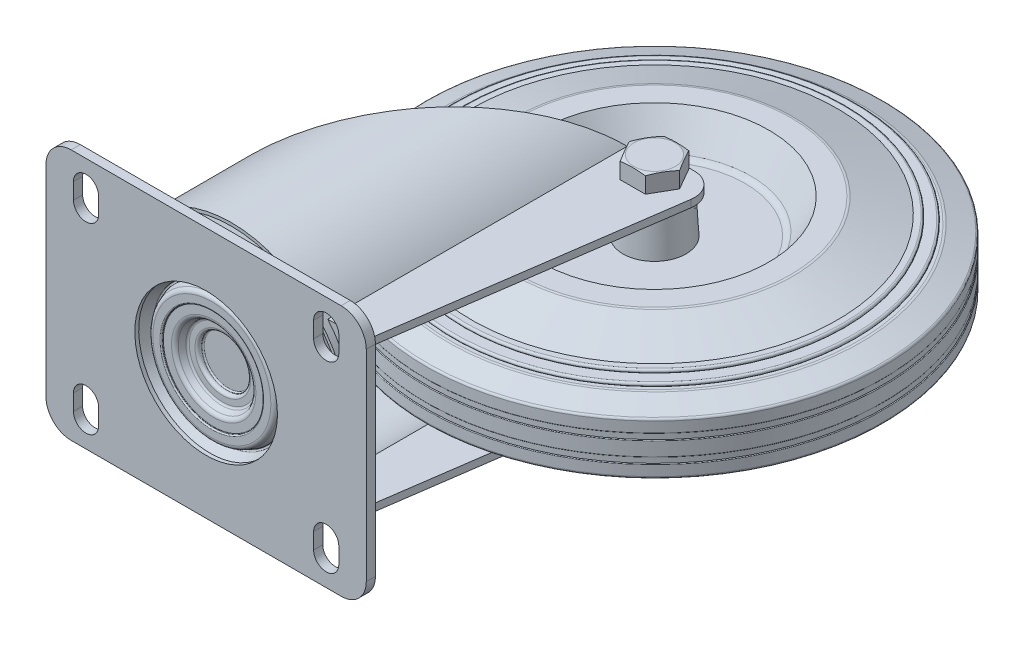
ISO-10303-21;
HEADER;
FILE_DESCRIPTION(('STEP AP214'),'2;1');
FILE_NAME('part.step','',(''),(''),'','','');
FILE_SCHEMA(('AUTOMOTIVE_DESIGN { 1 0 10303 214 1 1 1 1 }'));
ENDSEC;
DATA;
#1=APPLICATION_CONTEXT('core data for automotive mechanical design processes');
#2=APPLICATION_PROTOCOL_DEFINITION('international standard','automotive_design',2000,#1);
#3=PRODUCT_CONTEXT('',#1,'mechanical');
#4=PRODUCT('Part','Part','',(#3));
#5=PRODUCT_RELATED_PRODUCT_CATEGORY('part','',(#4));
#6=PRODUCT_DEFINITION_FORMATION('','',#4);
#7=PRODUCT_DEFINITION_CONTEXT('part definition',#1,'design');
#8=PRODUCT_DEFINITION('design','',#6,#7);
#9=PRODUCT_DEFINITION_SHAPE('','',#8);
#10=(LENGTH_UNIT() NAMED_UNIT(*) SI_UNIT(.MILLI.,.METRE.));
#11=(NAMED_UNIT(*) PLANE_ANGLE_UNIT() SI_UNIT($,.RADIAN.));
#12=(NAMED_UNIT(*) SI_UNIT($,.STERADIAN.) SOLID_ANGLE_UNIT());
#13=UNCERTAINTY_MEASURE_WITH_UNIT(LENGTH_MEASURE(1.E-05),#10,'distance_accuracy_value','');
#14=(GEOMETRIC_REPRESENTATION_CONTEXT(3) GLOBAL_UNCERTAINTY_ASSIGNED_CONTEXT((#13)) GLOBAL_UNIT_ASSIGNED_CONTEXT((#10,
#11,#12)) REPRESENTATION_CONTEXT('',''));
#15=CARTESIAN_POINT('',(0.,0.,0.));
#16=DIRECTION('',(0.,0.,1.));
#17=DIRECTION('',(1.,0.,0.));
#18=AXIS2_PLACEMENT_3D('',#15,#16,#17);
#19=CARTESIAN_POINT('',(148.107695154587,46.5,-140.));
#20=DIRECTION('',(0.,-1.,0.));
#21=DIRECTION('',(1.,0.,0.));
#22=AXIS2_PLACEMENT_3D('',#19,#20,#21);
#23=PLANE('',#22);
#24=CARTESIAN_POINT('',(108.5,46.5,-140.));
#25=DIRECTION('',(0.,1.,0.));
#26=DIRECTION('',(-1.,0.,0.));
#27=AXIS2_PLACEMENT_3D('',#24,#25,#26);
#28=CIRCLE('',#27,39.607695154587);
#29=CARTESIAN_POINT('',(68.892304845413,46.5,-140.));
#30=VERTEX_POINT('',#29);
#31=EDGE_CURVE('E1933',#30,#30,#28,.T.);
#32=ORIENTED_EDGE('',*,*,#31,.T.);
#33=EDGE_LOOP('',(#32));
#34=FACE_BOUND('',#33,.T.);
#35=CARTESIAN_POINT('',(108.5,46.5,-140.));
#36=DIRECTION('',(0.,-1.,0.));
#37=DIRECTION('',(1.,0.,0.));
#38=AXIS2_PLACEMENT_3D('',#35,#36,#37);
#39=CIRCLE('',#38,13.7861166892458);
#40=CARTESIAN_POINT('',(122.286116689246,46.5,-140.));
#41=VERTEX_POINT('',#40);
#42=EDGE_CURVE('E9',#41,#41,#39,.F.);
#43=ORIENTED_EDGE('',*,*,#42,.F.);
#44=EDGE_LOOP('',(#43));
#45=FACE_BOUND('',#44,.T.);
#46=ADVANCED_FACE('F14',(#34,#45),#23,.F.);
#47=CARTESIAN_POINT('',(118.5,26.5,-140.));
#48=DIRECTION('',(0.,1.,0.));
#49=DIRECTION('',(-1.,0.,0.));
#50=AXIS2_PLACEMENT_3D('',#47,#48,#49);
#51=PLANE('',#50);
#52=CARTESIAN_POINT('',(108.5,26.5,-140.));
#53=DIRECTION('',(0.,1.,0.));
#54=DIRECTION('',(-1.,0.,0.));
#55=AXIS2_PLACEMENT_3D('',#52,#53,#54);
#56=CIRCLE('',#55,39.607695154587);
#57=CARTESIAN_POINT('',(68.892304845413,26.5,-140.));
#58=VERTEX_POINT('',#57);
#59=EDGE_CURVE('E1937',#58,#58,#56,.T.);
#60=ORIENTED_EDGE('',*,*,#59,.F.);
#61=EDGE_LOOP('',(#60));
#62=FACE_BOUND('',#61,.T.);
#63=CARTESIAN_POINT('',(108.5,26.5,-140.));
#64=DIRECTION('',(0.,1.,0.));
#65=DIRECTION('',(-1.,0.,0.));
#66=AXIS2_PLACEMENT_3D('',#63,#64,#65);
#67=CIRCLE('',#66,13.7861166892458);
#68=CARTESIAN_POINT('',(94.7138833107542,26.5,-140.));
#69=VERTEX_POINT('',#68);
#70=EDGE_CURVE('E24',#69,#69,#67,.F.);
#71=ORIENTED_EDGE('',*,*,#70,.F.);
#72=EDGE_LOOP('',(#71));
#73=FACE_BOUND('',#72,.T.);
#74=ADVANCED_FACE('F1908',(#62,#73),#51,.F.);
#75=CARTESIAN_POINT('',(108.5,33.5,-140.));
#76=DIRECTION('',(0.,1.,0.));
#77=DIRECTION('',(-1.,0.,0.));
#78=AXIS2_PLACEMENT_3D('',#75,#76,#77);
#79=TOROIDAL_SURFACE('',#78,99.7,0.299999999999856);
#80=CARTESIAN_POINT('',(108.5,33.5,-140.));
#81=DIRECTION('',(0.,1.,0.));
#82=DIRECTION('',(-1.,0.,0.));
#83=AXIS2_PLACEMENT_3D('',#80,#81,#82);
#84=CIRCLE('',#83,100.);
#85=CARTESIAN_POINT('',(8.49999999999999,33.5,-140.));
#86=VERTEX_POINT('',#85);
#87=EDGE_CURVE('E1994',#86,#86,#84,.T.);
#88=ORIENTED_EDGE('',*,*,#87,.F.);
#89=EDGE_LOOP('',(#88));
#90=FACE_BOUND('',#89,.T.);
#91=CARTESIAN_POINT('',(108.5,33.2,-140.));
#92=DIRECTION('',(0.,1.,0.));
#93=DIRECTION('',(-1.,0.,0.));
#94=AXIS2_PLACEMENT_3D('',#91,#92,#93);
#95=CIRCLE('',#94,99.7);
#96=CARTESIAN_POINT('',(8.8,33.2,-140.));
#97=VERTEX_POINT('',#96);
#98=EDGE_CURVE('E2005',#97,#97,#95,.T.);
#99=ORIENTED_EDGE('',*,*,#98,.T.);
#100=EDGE_LOOP('',(#99));
#101=FACE_BOUND('',#100,.T.);
#102=ADVANCED_FACE('F1898',(#90,#101),#79,.T.);
#103=CARTESIAN_POINT('',(108.5,11.5,-140.));
#104=DIRECTION('',(0.,1.,0.));
#105=DIRECTION('',(-1.,0.,0.));
#106=AXIS2_PLACEMENT_3D('',#103,#104,#105);
#107=CYLINDRICAL_SURFACE('',#106,100.);
#108=CARTESIAN_POINT('',(108.5,39.5,-140.));
#109=DIRECTION('',(0.,1.,0.));
#110=DIRECTION('',(-1.,0.,0.));
#111=AXIS2_PLACEMENT_3D('',#108,#109,#110);
#112=CIRCLE('',#111,100.);
#113=CARTESIAN_POINT('',(8.49999999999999,39.5,-140.));
#114=VERTEX_POINT('',#113);
#115=EDGE_CURVE('E1991',#114,#114,#112,.T.);
#116=ORIENTED_EDGE('',*,*,#115,.F.);
#117=EDGE_LOOP('',(#116));
#118=FACE_BOUND('',#117,.T.);
#119=ORIENTED_EDGE('',*,*,#87,.T.);
#120=EDGE_LOOP('',(#119));
#121=FACE_BOUND('',#120,.T.);
#122=ADVANCED_FACE('F1888',(#118,#121),#107,.T.);
#123=CARTESIAN_POINT('',(108.5,39.5,-140.));
#124=DIRECTION('',(0.,1.,0.));
#125=DIRECTION('',(-1.,0.,0.));
#126=AXIS2_PLACEMENT_3D('',#123,#124,#125);
#127=TOROIDAL_SURFACE('',#126,99.7,0.299999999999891);
#128=CARTESIAN_POINT('',(108.5,39.8,-140.));
#129=DIRECTION('',(0.,1.,0.));
#130=DIRECTION('',(-1.,0.,0.));
#131=AXIS2_PLACEMENT_3D('',#128,#129,#130);
#132=CIRCLE('',#131,99.7);
#133=CARTESIAN_POINT('',(8.8,39.8,-140.));
#134=VERTEX_POINT('',#133);
#135=EDGE_CURVE('E1988',#134,#134,#132,.T.);
#136=ORIENTED_EDGE('',*,*,#135,.F.);
#137=EDGE_LOOP('',(#136));
#138=FACE_BOUND('',#137,.T.);
#139=ORIENTED_EDGE('',*,*,#115,.T.);
#140=EDGE_LOOP('',(#139));
#141=FACE_BOUND('',#140,.T.);
#142=ADVANCED_FACE('F1878',(#138,#141),#127,.T.);
#143=CARTESIAN_POINT('',(108.5,11.5,-140.));
#144=DIRECTION('',(0.,1.,0.));
#145=DIRECTION('',(-1.,0.,0.));
#146=AXIS2_PLACEMENT_3D('',#143,#144,#145);
#147=CYLINDRICAL_SURFACE('',#146,99.7);
#148=CARTESIAN_POINT('',(108.5,42.2,-140.));
#149=DIRECTION('',(0.,1.,0.));
#150=DIRECTION('',(-1.,0.,0.));
#151=AXIS2_PLACEMENT_3D('',#148,#149,#150);
#152=CIRCLE('',#151,99.7);
#153=CARTESIAN_POINT('',(8.8,42.2,-140.));
#154=VERTEX_POINT('',#153);
#155=EDGE_CURVE('E1985',#154,#154,#152,.T.);
#156=ORIENTED_EDGE('',*,*,#155,.F.);
#157=EDGE_LOOP('',(#156));
#158=FACE_BOUND('',#157,.T.);
#159=ORIENTED_EDGE('',*,*,#135,.T.);
#160=EDGE_LOOP('',(#159));
#161=FACE_BOUND('',#160,.T.);
#162=ADVANCED_FACE('F1868',(#158,#161),#147,.T.);
#163=CARTESIAN_POINT('',(108.5,42.5,-140.));
#164=DIRECTION('',(0.,1.,0.));
#165=DIRECTION('',(-1.,0.,0.));
#166=AXIS2_PLACEMENT_3D('',#163,#164,#165);
#167=TOROIDAL_SURFACE('',#166,99.7,0.299999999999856);
#168=CARTESIAN_POINT('',(108.5,42.5,-140.));
#169=DIRECTION('',(0.,1.,0.));
#170=DIRECTION('',(-1.,0.,0.));
#171=AXIS2_PLACEMENT_3D('',#168,#169,#170);
#172=CIRCLE('',#171,100.);
#173=CARTESIAN_POINT('',(8.49999999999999,42.5,-140.));
#174=VERTEX_POINT('',#173);
#175=EDGE_CURVE('E1982',#174,#174,#172,.T.);
#176=ORIENTED_EDGE('',*,*,#175,.F.);
#177=EDGE_LOOP('',(#176));
#178=FACE_BOUND('',#177,.T.);
#179=ORIENTED_EDGE('',*,*,#155,.T.);
#180=EDGE_LOOP('',(#179));
#181=FACE_BOUND('',#180,.T.);
#182=ADVANCED_FACE('F1858',(#178,#181),#167,.T.);
#183=CARTESIAN_POINT('',(108.5,11.5,-140.));
#184=DIRECTION('',(0.,1.,0.));
#185=DIRECTION('',(-1.,0.,0.));
#186=AXIS2_PLACEMENT_3D('',#183,#184,#185);
#187=CYLINDRICAL_SURFACE('',#186,100.);
#188=CARTESIAN_POINT('',(108.5,47.013602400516,-140.));
#189=DIRECTION('',(0.,1.,0.));
#190=DIRECTION('',(-1.,0.,0.));
#191=AXIS2_PLACEMENT_3D('',#188,#189,#190);
#192=CIRCLE('',#191,100.);
#193=CARTESIAN_POINT('',(8.49999999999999,47.013602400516,-140.));
#194=VERTEX_POINT('',#193);
#195=EDGE_CURVE('E1979',#194,#194,#192,.T.);
#196=ORIENTED_EDGE('',*,*,#195,.F.);
#197=EDGE_LOOP('',(#196));
#198=FACE_BOUND('',#197,.T.);
#199=ORIENTED_EDGE('',*,*,#175,.T.);
#200=EDGE_LOOP('',(#199));
#201=FACE_BOUND('',#200,.T.);
#202=ADVANCED_FACE('F1848',(#198,#201),#187,.T.);
#203=CARTESIAN_POINT('',(108.5,47.0136024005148,-140.));
#204=DIRECTION('',(0.,1.,0.));
#205=DIRECTION('',(-1.,0.,0.));
#206=AXIS2_PLACEMENT_3D('',#203,#204,#205);
#207=TOROIDAL_SURFACE('',#206,98.9999999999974,1.00000000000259);
#208=CARTESIAN_POINT('',(108.5,47.959120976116,-140.));
#209=DIRECTION('',(0.,1.,0.));
#210=DIRECTION('',(-1.,0.,0.));
#211=AXIS2_PLACEMENT_3D('',#208,#209,#210);
#212=CIRCLE('',#211,99.325568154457);
#213=CARTESIAN_POINT('',(9.17443184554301,47.959120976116,-140.));
#214=VERTEX_POINT('',#213);
#215=EDGE_CURVE('E1976',#214,#214,#212,.T.);
#216=ORIENTED_EDGE('',*,*,#215,.F.);
#217=EDGE_LOOP('',(#216));
#218=FACE_BOUND('',#217,.T.);
#219=ORIENTED_EDGE('',*,*,#195,.T.);
#220=EDGE_LOOP('',(#219));
#221=FACE_BOUND('',#220,.T.);
#222=ADVANCED_FACE('F1838',(#218,#221),#207,.T.);
#223=CARTESIAN_POINT('',(108.5,47.959120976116,-140.));
#224=DIRECTION('',(0.,-1.,0.));
#225=DIRECTION('',(1.,0.,0.));
#226=AXIS2_PLACEMENT_3D('',#223,#224,#225);
#227=CONICAL_SURFACE('',#226,99.325568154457,1.23918376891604);
#228=CARTESIAN_POINT('',(108.5,51.116670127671,-140.));
#229=DIRECTION('',(0.,1.,0.));
#230=DIRECTION('',(-1.,0.,0.));
#231=AXIS2_PLACEMENT_3D('',#228,#229,#230);
#232=CIRCLE('',#231,90.155379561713);
#233=CARTESIAN_POINT('',(18.344620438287,51.116670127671,-140.));
#234=VERTEX_POINT('',#233);
#235=EDGE_CURVE('E1973',#234,#234,#232,.T.);
#236=ORIENTED_EDGE('',*,*,#235,.F.);
#237=EDGE_LOOP('',(#236));
#238=FACE_BOUND('',#237,.T.);
#239=ORIENTED_EDGE('',*,*,#215,.T.);
#240=EDGE_LOOP('',(#239));
#241=FACE_BOUND('',#240,.T.);
#242=ADVANCED_FACE('F1828',(#238,#241),#227,.T.);
#243=CARTESIAN_POINT('',(108.5,48.280114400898,-140.));
#244=DIRECTION('',(0.,1.,0.));
#245=DIRECTION('',(-1.,0.,0.));
#246=AXIS2_PLACEMENT_3D('',#243,#244,#245);
#247=TOROIDAL_SURFACE('',#246,89.1786750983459,2.99999999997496);
#248=CARTESIAN_POINT('',(108.5,51.280114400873,-140.));
#249=DIRECTION('',(0.,1.,0.));
#250=DIRECTION('',(-1.,0.,0.));
#251=AXIS2_PLACEMENT_3D('',#248,#249,#250);
#252=CIRCLE('',#251,89.178675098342);
#253=CARTESIAN_POINT('',(19.321324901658,51.280114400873,-140.));
#254=VERTEX_POINT('',#253);
#255=EDGE_CURVE('E1970',#254,#254,#252,.T.);
#256=ORIENTED_EDGE('',*,*,#255,.F.);
#257=EDGE_LOOP('',(#256));
#258=FACE_BOUND('',#257,.T.);
#259=ORIENTED_EDGE('',*,*,#235,.T.);
#260=EDGE_LOOP('',(#259));
#261=FACE_BOUND('',#260,.T.);
#262=ADVANCED_FACE('F1818',(#258,#261),#247,.T.);
#263=CARTESIAN_POINT('',(197.678675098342,51.280114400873,-140.));
#264=DIRECTION('',(0.,-1.,0.));
#265=DIRECTION('',(1.,0.,0.));
#266=AXIS2_PLACEMENT_3D('',#263,#264,#265);
#267=PLANE('',#266);
#268=CARTESIAN_POINT('',(108.5,51.280114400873,-140.));
#269=DIRECTION('',(0.,1.,0.));
#270=DIRECTION('',(-1.,0.,0.));
#271=AXIS2_PLACEMENT_3D('',#268,#269,#270);
#272=CIRCLE('',#271,87.26052719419);
#273=CARTESIAN_POINT('',(21.23947280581,51.280114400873,-140.));
#274=VERTEX_POINT('',#273);
#275=EDGE_CURVE('E1967',#274,#274,#272,.T.);
#276=ORIENTED_EDGE('',*,*,#275,.F.);
#277=EDGE_LOOP('',(#276));
#278=FACE_BOUND('',#277,.T.);
#279=ORIENTED_EDGE('',*,*,#255,.T.);
#280=EDGE_LOOP('',(#279));
#281=FACE_BOUND('',#280,.T.);
#282=ADVANCED_FACE('F1808',(#278,#281),#267,.F.);
#283=CARTESIAN_POINT('',(108.5,52.1134477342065,-140.));
#284=DIRECTION('',(0.,1.,0.));
#285=DIRECTION('',(-1.,0.,0.));
#286=AXIS2_PLACEMENT_3D('',#283,#284,#285);
#287=TOROIDAL_SURFACE('',#286,87.2605271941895,0.833333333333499);
#288=CARTESIAN_POINT('',(108.5,52.94678106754,-140.));
#289=DIRECTION('',(0.,1.,0.));
#290=DIRECTION('',(-1.,0.,0.));
#291=AXIS2_PLACEMENT_3D('',#288,#289,#290);
#292=CIRCLE('',#291,87.26052719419);
#293=CARTESIAN_POINT('',(21.23947280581,52.94678106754,-140.));
#294=VERTEX_POINT('',#293);
#295=EDGE_CURVE('E1964',#294,#294,#292,.T.);
#296=ORIENTED_EDGE('',*,*,#295,.F.);
#297=EDGE_LOOP('',(#296));
#298=FACE_BOUND('',#297,.T.);
#299=ORIENTED_EDGE('',*,*,#275,.T.);
#300=EDGE_LOOP('',(#299));
#301=FACE_BOUND('',#300,.T.);
#302=ADVANCED_FACE('F1798',(#298,#301),#287,.T.);
#303=CARTESIAN_POINT('',(195.76052719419,52.94678106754,-140.));
#304=DIRECTION('',(0.,-1.,0.));
#305=DIRECTION('',(1.,0.,0.));
#306=AXIS2_PLACEMENT_3D('',#303,#304,#305);
#307=PLANE('',#306);
#308=CARTESIAN_POINT('',(108.5,52.94678106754,-140.));
#309=DIRECTION('',(0.,1.,0.));
#310=DIRECTION('',(-1.,0.,0.));
#311=AXIS2_PLACEMENT_3D('',#308,#309,#310);
#312=CIRCLE('',#311,82.420175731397);
#313=CARTESIAN_POINT('',(26.079824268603,52.94678106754,-140.));
#314=VERTEX_POINT('',#313);
#315=EDGE_CURVE('E1961',#314,#314,#312,.T.);
#316=ORIENTED_EDGE('',*,*,#315,.F.);
#317=EDGE_LOOP('',(#316));
#318=FACE_BOUND('',#317,.T.);
#319=ORIENTED_EDGE('',*,*,#295,.T.);
#320=EDGE_LOOP('',(#319));
#321=FACE_BOUND('',#320,.T.);
#322=ADVANCED_FACE('F1788',(#318,#321),#307,.F.);
#323=CARTESIAN_POINT('',(108.5,53.7801144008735,-140.));
#324=DIRECTION('',(0.,1.,0.));
#325=DIRECTION('',(-1.,0.,0.));
#326=AXIS2_PLACEMENT_3D('',#323,#324,#325);
#327=TOROIDAL_SURFACE('',#326,82.4201757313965,0.8333333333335);
#328=CARTESIAN_POINT('',(108.5,54.613447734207,-140.));
#329=DIRECTION('',(0.,1.,0.));
#330=DIRECTION('',(-1.,0.,0.));
#331=AXIS2_PLACEMENT_3D('',#328,#329,#330);
#332=CIRCLE('',#331,82.420175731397);
#333=CARTESIAN_POINT('',(26.079824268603,54.613447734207,-140.));
#334=VERTEX_POINT('',#333);
#335=EDGE_CURVE('E1958',#334,#334,#332,.T.);
#336=ORIENTED_EDGE('',*,*,#335,.F.);
#337=EDGE_LOOP('',(#336));
#338=FACE_BOUND('',#337,.T.);
#339=ORIENTED_EDGE('',*,*,#315,.T.);
#340=EDGE_LOOP('',(#339));
#341=FACE_BOUND('',#340,.T.);
#342=ADVANCED_FACE('F1778',(#338,#341),#327,.T.);
#343=CARTESIAN_POINT('',(190.920175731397,54.613447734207,-140.));
#344=DIRECTION('',(0.,-1.,0.));
#345=DIRECTION('',(1.,0.,0.));
#346=AXIS2_PLACEMENT_3D('',#343,#344,#345);
#347=PLANE('',#346);
#348=CARTESIAN_POINT('',(108.5,54.613447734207,-140.));
#349=DIRECTION('',(0.,1.,0.));
#350=DIRECTION('',(-1.,0.,0.));
#351=AXIS2_PLACEMENT_3D('',#348,#349,#350);
#352=CIRCLE('',#351,80.);
#353=CARTESIAN_POINT('',(28.5,54.613447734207,-140.));
#354=VERTEX_POINT('',#353);
#355=EDGE_CURVE('E1955',#354,#354,#352,.T.);
#356=ORIENTED_EDGE('',*,*,#355,.F.);
#357=EDGE_LOOP('',(#356));
#358=FACE_BOUND('',#357,.T.);
#359=ORIENTED_EDGE('',*,*,#335,.T.);
#360=EDGE_LOOP('',(#359));
#361=FACE_BOUND('',#360,.T.);
#362=ADVANCED_FACE('F1768',(#358,#361),#347,.F.);
#363=CARTESIAN_POINT('',(108.5,54.613447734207,-140.));
#364=DIRECTION('',(0.,-1.,0.));
#365=DIRECTION('',(1.,0.,0.));
#366=AXIS2_PLACEMENT_3D('',#363,#364,#365);
#367=CONICAL_SURFACE('',#366,80.,1.23918376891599);
#368=CARTESIAN_POINT('',(108.5,61.336555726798,-140.));
#369=DIRECTION('',(0.,1.,0.));
#370=DIRECTION('',(-1.,0.,0.));
#371=AXIS2_PLACEMENT_3D('',#368,#369,#370);
#372=CIRCLE('',#371,60.474676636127);
#373=CARTESIAN_POINT('',(48.025323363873,61.336555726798,-140.));
#374=VERTEX_POINT('',#373);
#375=EDGE_CURVE('E1952',#374,#374,#372,.T.);
#376=ORIENTED_EDGE('',*,*,#375,.F.);
#377=EDGE_LOOP('',(#376));
#378=FACE_BOUND('',#377,.T.);
#379=ORIENTED_EDGE('',*,*,#355,.T.);
#380=EDGE_LOOP('',(#379));
#381=FACE_BOUND('',#380,.T.);
#382=ADVANCED_FACE('F1758',(#378,#381),#367,.T.);
#383=CARTESIAN_POINT('',(108.5,58.500000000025,-140.));
#384=DIRECTION('',(0.,1.,0.));
#385=DIRECTION('',(-1.,0.,0.));
#386=AXIS2_PLACEMENT_3D('',#383,#384,#385);
#387=TOROIDAL_SURFACE('',#386,59.4979721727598,2.99999999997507);
#388=CARTESIAN_POINT('',(108.5,61.5,-140.));
#389=DIRECTION('',(0.,1.,0.));
#390=DIRECTION('',(-1.,0.,0.));
#391=AXIS2_PLACEMENT_3D('',#388,#389,#390);
#392=CIRCLE('',#391,59.497972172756);
#393=CARTESIAN_POINT('',(49.002027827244,61.5,-140.));
#394=VERTEX_POINT('',#393);
#395=EDGE_CURVE('E1949',#394,#394,#392,.T.);
#396=ORIENTED_EDGE('',*,*,#395,.F.);
#397=EDGE_LOOP('',(#396));
#398=FACE_BOUND('',#397,.T.);
#399=ORIENTED_EDGE('',*,*,#375,.T.);
#400=EDGE_LOOP('',(#399));
#401=FACE_BOUND('',#400,.T.);
#402=ADVANCED_FACE('F1748',(#398,#401),#387,.T.);
#403=CARTESIAN_POINT('',(167.997972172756,61.5,-140.));
#404=DIRECTION('',(0.,-1.,0.));
#405=DIRECTION('',(1.,0.,0.));
#406=AXIS2_PLACEMENT_3D('',#403,#404,#405);
#407=PLANE('',#406);
#408=CARTESIAN_POINT('',(108.5,61.5,-140.));
#409=DIRECTION('',(0.,1.,0.));
#410=DIRECTION('',(-1.,0.,0.));
#411=AXIS2_PLACEMENT_3D('',#408,#409,#410);
#412=CIRCLE('',#411,50.);
#413=CARTESIAN_POINT('',(58.5,61.5,-140.));
#414=VERTEX_POINT('',#413);
#415=EDGE_CURVE('E1940',#414,#414,#412,.T.);
#416=ORIENTED_EDGE('',*,*,#415,.F.);
#417=EDGE_LOOP('',(#416));
#418=FACE_BOUND('',#417,.T.);
#419=ORIENTED_EDGE('',*,*,#395,.T.);
#420=EDGE_LOOP('',(#419));
#421=FACE_BOUND('',#420,.T.);
#422=ADVANCED_FACE('F1738',(#418,#421),#407,.F.);
#423=CARTESIAN_POINT('',(108.5,61.5,-140.));
#424=DIRECTION('',(0.,1.,0.));
#425=DIRECTION('',(-1.,0.,0.));
#426=AXIS2_PLACEMENT_3D('',#423,#424,#425);
#427=CONICAL_SURFACE('',#426,50.,0.5235987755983);
#428=CARTESIAN_POINT('',(108.5,48.,-140.));
#429=DIRECTION('',(0.,1.,0.));
#430=DIRECTION('',(-1.,0.,0.));
#431=AXIS2_PLACEMENT_3D('',#428,#429,#430);
#432=CIRCLE('',#431,42.20577136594);
#433=CARTESIAN_POINT('',(66.29422863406,48.,-140.));
#434=VERTEX_POINT('',#433);
#435=EDGE_CURVE('E1936',#434,#434,#432,.T.);
#436=ORIENTED_EDGE('',*,*,#435,.F.);
#437=EDGE_LOOP('',(#436));
#438=FACE_BOUND('',#437,.T.);
#439=ORIENTED_EDGE('',*,*,#415,.T.);
#440=EDGE_LOOP('',(#439));
#441=FACE_BOUND('',#440,.T.);
#442=ADVANCED_FACE('F1728',(#438,#441),#427,.F.);
#443=CARTESIAN_POINT('',(108.5,49.5000000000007,-140.));
#444=DIRECTION('',(0.,1.,0.));
#445=DIRECTION('',(-1.,0.,0.));
#446=AXIS2_PLACEMENT_3D('',#443,#444,#445);
#447=TOROIDAL_SURFACE('',#446,39.6076951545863,3.00000000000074);
#448=ORIENTED_EDGE('',*,*,#31,.F.);
#449=EDGE_LOOP('',(#448));
#450=FACE_BOUND('',#449,.T.);
#451=ORIENTED_EDGE('',*,*,#435,.T.);
#452=EDGE_LOOP('',(#451));
#453=FACE_BOUND('',#452,.T.);
#454=ADVANCED_FACE('F1718',(#450,#453),#447,.F.);
#455=CARTESIAN_POINT('',(108.5,23.4999999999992,-140.));
#456=DIRECTION('',(0.,1.,0.));
#457=DIRECTION('',(-1.,0.,0.));
#458=AXIS2_PLACEMENT_3D('',#455,#456,#457);
#459=TOROIDAL_SURFACE('',#458,39.6076951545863,3.00000000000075);
#460=CARTESIAN_POINT('',(108.5,25.,-140.));
#461=DIRECTION('',(0.,1.,0.));
#462=DIRECTION('',(-1.,0.,0.));
#463=AXIS2_PLACEMENT_3D('',#460,#461,#462);
#464=CIRCLE('',#463,42.20577136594);
#465=CARTESIAN_POINT('',(66.29422863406,25.,-140.));
#466=VERTEX_POINT('',#465);
#467=EDGE_CURVE('E1943',#466,#466,#464,.T.);
#468=ORIENTED_EDGE('',*,*,#467,.F.);
#469=EDGE_LOOP('',(#468));
#470=FACE_BOUND('',#469,.T.);
#471=ORIENTED_EDGE('',*,*,#59,.T.);
#472=EDGE_LOOP('',(#471));
#473=FACE_BOUND('',#472,.T.);
#474=ADVANCED_FACE('F1708',(#470,#473),#459,.F.);
#475=CARTESIAN_POINT('',(108.5,25.,-140.));
#476=DIRECTION('',(0.,-1.,0.));
#477=DIRECTION('',(1.,0.,0.));
#478=AXIS2_PLACEMENT_3D('',#475,#476,#477);
#479=CONICAL_SURFACE('',#478,42.20577136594,0.5235987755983);
#480=CARTESIAN_POINT('',(108.5,11.5,-140.));
#481=DIRECTION('',(0.,1.,0.));
#482=DIRECTION('',(-1.,0.,0.));
#483=AXIS2_PLACEMENT_3D('',#480,#481,#482);
#484=CIRCLE('',#483,50.);
#485=CARTESIAN_POINT('',(58.5,11.5,-140.));
#486=VERTEX_POINT('',#485);
#487=EDGE_CURVE('E2052',#486,#486,#484,.T.);
#488=ORIENTED_EDGE('',*,*,#487,.F.);
#489=EDGE_LOOP('',(#488));
#490=FACE_BOUND('',#489,.T.);
#491=ORIENTED_EDGE('',*,*,#467,.T.);
#492=EDGE_LOOP('',(#491));
#493=FACE_BOUND('',#492,.T.);
#494=ADVANCED_FACE('F1698',(#490,#493),#479,.F.);
#495=CARTESIAN_POINT('',(158.5,11.5,-140.));
#496=DIRECTION('',(0.,1.,0.));
#497=DIRECTION('',(-1.,0.,0.));
#498=AXIS2_PLACEMENT_3D('',#495,#496,#497);
#499=PLANE('',#498);
#500=CARTESIAN_POINT('',(108.5,11.5,-140.));
#501=DIRECTION('',(0.,1.,0.));
#502=DIRECTION('',(-1.,0.,0.));
#503=AXIS2_PLACEMENT_3D('',#500,#501,#502);
#504=CIRCLE('',#503,59.497972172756);
#505=CARTESIAN_POINT('',(49.002027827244,11.5,-140.));
#506=VERTEX_POINT('',#505);
#507=EDGE_CURVE('E2049',#506,#506,#504,.T.);
#508=ORIENTED_EDGE('',*,*,#507,.F.);
#509=EDGE_LOOP('',(#508));
#510=FACE_BOUND('',#509,.T.);
#511=ORIENTED_EDGE('',*,*,#487,.T.);
#512=EDGE_LOOP('',(#511));
#513=FACE_BOUND('',#512,.T.);
#514=ADVANCED_FACE('F1688',(#510,#513),#499,.F.);
#515=CARTESIAN_POINT('',(108.5,14.4999999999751,-140.));
#516=DIRECTION('',(0.,1.,0.));
#517=DIRECTION('',(-1.,0.,0.));
#518=AXIS2_PLACEMENT_3D('',#515,#516,#517);
#519=TOROIDAL_SURFACE('',#518,59.4979721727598,2.99999999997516);
#520=CARTESIAN_POINT('',(108.5,11.663444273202,-140.));
#521=DIRECTION('',(0.,1.,0.));
#522=DIRECTION('',(-1.,0.,0.));
#523=AXIS2_PLACEMENT_3D('',#520,#521,#522);
#524=CIRCLE('',#523,60.474676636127);
#525=CARTESIAN_POINT('',(48.025323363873,11.663444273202,-140.));
#526=VERTEX_POINT('',#525);
#527=EDGE_CURVE('E2046',#526,#526,#524,.T.);
#528=ORIENTED_EDGE('',*,*,#527,.F.);
#529=EDGE_LOOP('',(#528));
#530=FACE_BOUND('',#529,.T.);
#531=ORIENTED_EDGE('',*,*,#507,.T.);
#532=EDGE_LOOP('',(#531));
#533=FACE_BOUND('',#532,.T.);
#534=ADVANCED_FACE('F1678',(#530,#533),#519,.T.);
#535=CARTESIAN_POINT('',(108.5,11.663444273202,-140.));
#536=DIRECTION('',(0.,1.,0.));
#537=DIRECTION('',(-1.,0.,0.));
#538=AXIS2_PLACEMENT_3D('',#535,#536,#537);
#539=CONICAL_SURFACE('',#538,60.474676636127,1.23918376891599);
#540=CARTESIAN_POINT('',(108.5,18.386552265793,-140.));
#541=DIRECTION('',(0.,1.,0.));
#542=DIRECTION('',(-1.,0.,0.));
#543=AXIS2_PLACEMENT_3D('',#540,#541,#542);
#544=CIRCLE('',#543,80.);
#545=CARTESIAN_POINT('',(28.5,18.386552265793,-140.));
#546=VERTEX_POINT('',#545);
#547=EDGE_CURVE('E2043',#546,#546,#544,.T.);
#548=ORIENTED_EDGE('',*,*,#547,.F.);
#549=EDGE_LOOP('',(#548));
#550=FACE_BOUND('',#549,.T.);
#551=ORIENTED_EDGE('',*,*,#527,.T.);
#552=EDGE_LOOP('',(#551));
#553=FACE_BOUND('',#552,.T.);
#554=ADVANCED_FACE('F1668',(#550,#553),#539,.T.);
#555=CARTESIAN_POINT('',(188.5,18.386552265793,-140.));
#556=DIRECTION('',(0.,1.,0.));
#557=DIRECTION('',(-1.,0.,0.));
#558=AXIS2_PLACEMENT_3D('',#555,#556,#557);
#559=PLANE('',#558);
#560=CARTESIAN_POINT('',(108.5,18.386552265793,-140.));
#561=DIRECTION('',(0.,1.,0.));
#562=DIRECTION('',(-1.,0.,0.));
#563=AXIS2_PLACEMENT_3D('',#560,#561,#562);
#564=CIRCLE('',#563,82.420175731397);
#565=CARTESIAN_POINT('',(26.079824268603,18.386552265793,-140.));
#566=VERTEX_POINT('',#565);
#567=EDGE_CURVE('E2040',#566,#566,#564,.T.);
#568=ORIENTED_EDGE('',*,*,#567,.F.);
#569=EDGE_LOOP('',(#568));
#570=FACE_BOUND('',#569,.T.);
#571=ORIENTED_EDGE('',*,*,#547,.T.);
#572=EDGE_LOOP('',(#571));
#573=FACE_BOUND('',#572,.T.);
#574=ADVANCED_FACE('F1658',(#570,#573),#559,.F.);
#575=CARTESIAN_POINT('',(108.5,19.2198855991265,-140.));
#576=DIRECTION('',(0.,1.,0.));
#577=DIRECTION('',(-1.,0.,0.));
#578=AXIS2_PLACEMENT_3D('',#575,#576,#577);
#579=TOROIDAL_SURFACE('',#578,82.4201757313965,0.8333333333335);
#580=CARTESIAN_POINT('',(108.5,20.05321893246,-140.));
#581=DIRECTION('',(0.,1.,0.));
#582=DIRECTION('',(-1.,0.,0.));
#583=AXIS2_PLACEMENT_3D('',#580,#581,#582);
#584=CIRCLE('',#583,82.420175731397);
#585=CARTESIAN_POINT('',(26.079824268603,20.05321893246,-140.));
#586=VERTEX_POINT('',#585);
#587=EDGE_CURVE('E2037',#586,#586,#584,.T.);
#588=ORIENTED_EDGE('',*,*,#587,.F.);
#589=EDGE_LOOP('',(#588));
#590=FACE_BOUND('',#589,.T.);
#591=ORIENTED_EDGE('',*,*,#567,.T.);
#592=EDGE_LOOP('',(#591));
#593=FACE_BOUND('',#592,.T.);
#594=ADVANCED_FACE('F1648',(#590,#593),#579,.T.);
#595=CARTESIAN_POINT('',(190.920175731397,20.05321893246,-140.));
#596=DIRECTION('',(0.,1.,0.));
#597=DIRECTION('',(-1.,0.,0.));
#598=AXIS2_PLACEMENT_3D('',#595,#596,#597);
#599=PLANE('',#598);
#600=CARTESIAN_POINT('',(108.5,20.05321893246,-140.));
#601=DIRECTION('',(0.,1.,0.));
#602=DIRECTION('',(-1.,0.,0.));
#603=AXIS2_PLACEMENT_3D('',#600,#601,#602);
#604=CIRCLE('',#603,87.26052719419);
#605=CARTESIAN_POINT('',(21.23947280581,20.05321893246,-140.));
#606=VERTEX_POINT('',#605);
#607=EDGE_CURVE('E2034',#606,#606,#604,.T.);
#608=ORIENTED_EDGE('',*,*,#607,.F.);
#609=EDGE_LOOP('',(#608));
#610=FACE_BOUND('',#609,.T.);
#611=ORIENTED_EDGE('',*,*,#587,.T.);
#612=EDGE_LOOP('',(#611));
#613=FACE_BOUND('',#612,.T.);
#614=ADVANCED_FACE('F1638',(#610,#613),#599,.F.);
#615=CARTESIAN_POINT('',(108.5,20.8865522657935,-140.));
#616=DIRECTION('',(0.,1.,0.));
#617=DIRECTION('',(-1.,0.,0.));
#618=AXIS2_PLACEMENT_3D('',#615,#616,#617);
#619=TOROIDAL_SURFACE('',#618,87.2605271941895,0.833333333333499);
#620=CARTESIAN_POINT('',(108.5,21.719885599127,-140.));
#621=DIRECTION('',(0.,1.,0.));
#622=DIRECTION('',(-1.,0.,0.));
#623=AXIS2_PLACEMENT_3D('',#620,#621,#622);
#624=CIRCLE('',#623,87.26052719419);
#625=CARTESIAN_POINT('',(21.23947280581,21.719885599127,-140.));
#626=VERTEX_POINT('',#625);
#627=EDGE_CURVE('E2031',#626,#626,#624,.T.);
#628=ORIENTED_EDGE('',*,*,#627,.F.);
#629=EDGE_LOOP('',(#628));
#630=FACE_BOUND('',#629,.T.);
#631=ORIENTED_EDGE('',*,*,#607,.T.);
#632=EDGE_LOOP('',(#631));
#633=FACE_BOUND('',#632,.T.);
#634=ADVANCED_FACE('F1628',(#630,#633),#619,.T.);
#635=CARTESIAN_POINT('',(195.76052719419,21.719885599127,-140.));
#636=DIRECTION('',(0.,1.,0.));
#637=DIRECTION('',(-1.,0.,0.));
#638=AXIS2_PLACEMENT_3D('',#635,#636,#637);
#639=PLANE('',#638);
#640=CARTESIAN_POINT('',(108.5,21.719885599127,-140.));
#641=DIRECTION('',(0.,1.,0.));
#642=DIRECTION('',(-1.,0.,0.));
#643=AXIS2_PLACEMENT_3D('',#640,#641,#642);
#644=CIRCLE('',#643,89.178675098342);
#645=CARTESIAN_POINT('',(19.321324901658,21.719885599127,-140.));
#646=VERTEX_POINT('',#645);
#647=EDGE_CURVE('E2028',#646,#646,#644,.T.);
#648=ORIENTED_EDGE('',*,*,#647,.F.);
#649=EDGE_LOOP('',(#648));
#650=FACE_BOUND('',#649,.T.);
#651=ORIENTED_EDGE('',*,*,#627,.T.);
#652=EDGE_LOOP('',(#651));
#653=FACE_BOUND('',#652,.T.);
#654=ADVANCED_FACE('F1618',(#650,#653),#639,.F.);
#655=CARTESIAN_POINT('',(108.5,24.7198855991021,-140.));
#656=DIRECTION('',(0.,1.,0.));
#657=DIRECTION('',(-1.,0.,0.));
#658=AXIS2_PLACEMENT_3D('',#655,#656,#657);
#659=TOROIDAL_SURFACE('',#658,89.1786750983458,2.99999999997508);
#660=CARTESIAN_POINT('',(108.5,21.883329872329,-140.));
#661=DIRECTION('',(0.,1.,0.));
#662=DIRECTION('',(-1.,0.,0.));
#663=AXIS2_PLACEMENT_3D('',#660,#661,#662);
#664=CIRCLE('',#663,90.155379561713);
#665=CARTESIAN_POINT('',(18.344620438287,21.883329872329,-140.));
#666=VERTEX_POINT('',#665);
#667=EDGE_CURVE('E2025',#666,#666,#664,.T.);
#668=ORIENTED_EDGE('',*,*,#667,.F.);
#669=EDGE_LOOP('',(#668));
#670=FACE_BOUND('',#669,.T.);
#671=ORIENTED_EDGE('',*,*,#647,.T.);
#672=EDGE_LOOP('',(#671));
#673=FACE_BOUND('',#672,.T.);
#674=ADVANCED_FACE('F1608',(#670,#673),#659,.T.);
#675=CARTESIAN_POINT('',(108.5,21.883329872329,-140.));
#676=DIRECTION('',(0.,1.,0.));
#677=DIRECTION('',(-1.,0.,0.));
#678=AXIS2_PLACEMENT_3D('',#675,#676,#677);
#679=CONICAL_SURFACE('',#678,90.155379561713,1.23918376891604);
#680=CARTESIAN_POINT('',(108.5,25.040879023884,-140.));
#681=DIRECTION('',(0.,1.,0.));
#682=DIRECTION('',(-1.,0.,0.));
#683=AXIS2_PLACEMENT_3D('',#680,#681,#682);
#684=CIRCLE('',#683,99.325568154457);
#685=CARTESIAN_POINT('',(9.17443184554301,25.040879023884,-140.));
#686=VERTEX_POINT('',#685);
#687=EDGE_CURVE('E2022',#686,#686,#684,.T.);
#688=ORIENTED_EDGE('',*,*,#687,.F.);
#689=EDGE_LOOP('',(#688));
#690=FACE_BOUND('',#689,.T.);
#691=ORIENTED_EDGE('',*,*,#667,.T.);
#692=EDGE_LOOP('',(#691));
#693=FACE_BOUND('',#692,.T.);
#694=ADVANCED_FACE('F1598',(#690,#693),#679,.T.);
#695=CARTESIAN_POINT('',(108.5,25.9863975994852,-140.));
#696=DIRECTION('',(0.,1.,0.));
#697=DIRECTION('',(-1.,0.,0.));
#698=AXIS2_PLACEMENT_3D('',#695,#696,#697);
#699=TOROIDAL_SURFACE('',#698,98.9999999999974,1.00000000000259);
#700=CARTESIAN_POINT('',(108.5,25.986397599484,-140.));
#701=DIRECTION('',(0.,1.,0.));
#702=DIRECTION('',(-1.,0.,0.));
#703=AXIS2_PLACEMENT_3D('',#700,#701,#702);
#704=CIRCLE('',#703,100.);
#705=CARTESIAN_POINT('',(8.49999999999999,25.986397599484,-140.));
#706=VERTEX_POINT('',#705);
#707=EDGE_CURVE('E2019',#706,#706,#704,.T.);
#708=ORIENTED_EDGE('',*,*,#707,.F.);
#709=EDGE_LOOP('',(#708));
#710=FACE_BOUND('',#709,.T.);
#711=ORIENTED_EDGE('',*,*,#687,.T.);
#712=EDGE_LOOP('',(#711));
#713=FACE_BOUND('',#712,.T.);
#714=ADVANCED_FACE('F1588',(#710,#713),#699,.T.);
#715=CARTESIAN_POINT('',(108.5,11.5,-140.));
#716=DIRECTION('',(0.,1.,0.));
#717=DIRECTION('',(-1.,0.,0.));
#718=AXIS2_PLACEMENT_3D('',#715,#716,#717);
#719=CYLINDRICAL_SURFACE('',#718,100.);
#720=CARTESIAN_POINT('',(108.5,30.5,-140.));
#721=DIRECTION('',(0.,1.,0.));
#722=DIRECTION('',(-1.,0.,0.));
#723=AXIS2_PLACEMENT_3D('',#720,#721,#722);
#724=CIRCLE('',#723,100.);
#725=CARTESIAN_POINT('',(8.49999999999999,30.5,-140.));
#726=VERTEX_POINT('',#725);
#727=EDGE_CURVE('E2010',#726,#726,#724,.T.);
#728=ORIENTED_EDGE('',*,*,#727,.F.);
#729=EDGE_LOOP('',(#728));
#730=FACE_BOUND('',#729,.T.);
#731=ORIENTED_EDGE('',*,*,#707,.T.);
#732=EDGE_LOOP('',(#731));
#733=FACE_BOUND('',#732,.T.);
#734=ADVANCED_FACE('F1578',(#730,#733),#719,.T.);
#735=CARTESIAN_POINT('',(108.5,30.5,-140.));
#736=DIRECTION('',(0.,1.,0.));
#737=DIRECTION('',(-1.,0.,0.));
#738=AXIS2_PLACEMENT_3D('',#735,#736,#737);
#739=TOROIDAL_SURFACE('',#738,99.7,0.299999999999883);
#740=CARTESIAN_POINT('',(108.5,30.8,-140.));
#741=DIRECTION('',(0.,1.,0.));
#742=DIRECTION('',(-1.,0.,0.));
#743=AXIS2_PLACEMENT_3D('',#740,#741,#742);
#744=CIRCLE('',#743,99.7);
#745=CARTESIAN_POINT('',(8.8,30.8,-140.));
#746=VERTEX_POINT('',#745);
#747=EDGE_CURVE('E2006',#746,#746,#744,.T.);
#748=ORIENTED_EDGE('',*,*,#747,.F.);
#749=EDGE_LOOP('',(#748));
#750=FACE_BOUND('',#749,.T.);
#751=ORIENTED_EDGE('',*,*,#727,.T.);
#752=EDGE_LOOP('',(#751));
#753=FACE_BOUND('',#752,.T.);
#754=ADVANCED_FACE('F1568',(#750,#753),#739,.T.);
#755=CARTESIAN_POINT('',(108.5,11.5,-140.));
#756=DIRECTION('',(0.,1.,0.));
#757=DIRECTION('',(-1.,0.,0.));
#758=AXIS2_PLACEMENT_3D('',#755,#756,#757);
#759=CYLINDRICAL_SURFACE('',#758,99.7);
#760=ORIENTED_EDGE('',*,*,#98,.F.);
#761=EDGE_LOOP('',(#760));
#762=FACE_BOUND('',#761,.T.);
#763=ORIENTED_EDGE('',*,*,#747,.T.);
#764=EDGE_LOOP('',(#763));
#765=FACE_BOUND('',#764,.T.);
#766=ADVANCED_FACE('F1558',(#762,#765),#759,.T.);
#767=CARTESIAN_POINT('',(118.5,7.5,-140.));
#768=DIRECTION('',(0.,1.,0.));
#769=DIRECTION('',(-1.,0.,0.));
#770=AXIS2_PLACEMENT_3D('',#767,#768,#769);
#771=PLANE('',#770);
#772=CARTESIAN_POINT('',(108.5,7.5,-140.));
#773=DIRECTION('',(0.,1.,0.));
#774=DIRECTION('',(-1.,0.,0.));
#775=AXIS2_PLACEMENT_3D('',#772,#773,#774);
#776=CIRCLE('',#775,11.3669220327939);
#777=CARTESIAN_POINT('',(97.1330779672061,7.5,-140.));
#778=VERTEX_POINT('',#777);
#779=EDGE_CURVE('E2093',#778,#778,#776,.T.);
#780=ORIENTED_EDGE('',*,*,#779,.F.);
#781=EDGE_LOOP('',(#780));
#782=FACE_BOUND('',#781,.T.);
#783=CARTESIAN_POINT('',(108.5,7.5,-140.));
#784=DIRECTION('',(0.,1.,0.));
#785=DIRECTION('',(-1.,0.,0.));
#786=AXIS2_PLACEMENT_3D('',#783,#784,#785);
#787=CIRCLE('',#786,10.);
#788=CARTESIAN_POINT('',(98.5,7.5,-140.));
#789=VERTEX_POINT('',#788);
#790=EDGE_CURVE('E2090',#789,#789,#787,.T.);
#791=ORIENTED_EDGE('',*,*,#790,.T.);
#792=EDGE_LOOP('',(#791));
#793=FACE_BOUND('',#792,.T.);
#794=ADVANCED_FACE('F1548',(#782,#793),#771,.F.);
#795=CARTESIAN_POINT('',(108.5,9.0000000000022,-140.));
#796=DIRECTION('',(0.,1.,0.));
#797=DIRECTION('',(-1.,0.,0.));
#798=AXIS2_PLACEMENT_3D('',#795,#796,#797);
#799=TOROIDAL_SURFACE('',#798,11.3669220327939,1.5000000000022);
#800=CARTESIAN_POINT('',(108.5,8.9214960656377,-140.));
#801=DIRECTION('',(0.,1.,0.));
#802=DIRECTION('',(-1.,0.,0.));
#803=AXIS2_PLACEMENT_3D('',#800,#801,#802);
#804=CIRCLE('',#803,12.864866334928);
#805=CARTESIAN_POINT('',(95.635133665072,8.9214960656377,-140.));
#806=VERTEX_POINT('',#805);
#807=EDGE_CURVE('E2096',#806,#806,#804,.T.);
#808=ORIENTED_EDGE('',*,*,#807,.F.);
#809=EDGE_LOOP('',(#808));
#810=FACE_BOUND('',#809,.T.);
#811=ORIENTED_EDGE('',*,*,#779,.T.);
#812=EDGE_LOOP('',(#811));
#813=FACE_BOUND('',#812,.T.);
#814=ADVANCED_FACE('F1538',(#810,#813),#799,.T.);
#815=CARTESIAN_POINT('',(108.5,8.9214960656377,-140.));
#816=DIRECTION('',(0.,1.,0.));
#817=DIRECTION('',(-1.,0.,0.));
#818=AXIS2_PLACEMENT_3D('',#815,#816,#817);
#819=CONICAL_SURFACE('',#818,12.864866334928,0.0523598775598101);
#820=ORIENTED_EDGE('',*,*,#807,.T.);
#821=EDGE_LOOP('',(#820));
#822=FACE_BOUND('',#821,.T.);
#823=ORIENTED_EDGE('',*,*,#70,.T.);
#824=EDGE_LOOP('',(#823));
#825=FACE_BOUND('',#824,.T.);
#826=ADVANCED_FACE('F1528',(#822,#825),#819,.T.);
#827=CARTESIAN_POINT('',(108.5,36.5,-140.));
#828=DIRECTION('',(0.,-1.,0.));
#829=DIRECTION('',(1.,0.,0.));
#830=AXIS2_PLACEMENT_3D('',#827,#828,#829);
#831=CONICAL_SURFACE('',#830,14.310194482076,0.0523598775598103);
#832=CARTESIAN_POINT('',(108.5,64.0785039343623,-140.));
#833=DIRECTION('',(0.,1.,0.));
#834=DIRECTION('',(-1.,0.,0.));
#835=AXIS2_PLACEMENT_3D('',#832,#833,#834);
#836=CIRCLE('',#835,12.864866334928);
#837=CARTESIAN_POINT('',(95.635133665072,64.0785039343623,-140.));
#838=VERTEX_POINT('',#837);
#839=EDGE_CURVE('E2007',#838,#838,#836,.T.);
#840=ORIENTED_EDGE('',*,*,#839,.F.);
#841=EDGE_LOOP('',(#840));
#842=FACE_BOUND('',#841,.T.);
#843=ORIENTED_EDGE('',*,*,#42,.T.);
#844=EDGE_LOOP('',(#843));
#845=FACE_BOUND('',#844,.T.);
#846=ADVANCED_FACE('F1518',(#842,#845),#831,.T.);
#847=CARTESIAN_POINT('',(108.5,63.9999999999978,-140.));
#848=DIRECTION('',(0.,1.,0.));
#849=DIRECTION('',(-1.,0.,0.));
#850=AXIS2_PLACEMENT_3D('',#847,#848,#849);
#851=TOROIDAL_SURFACE('',#850,11.3669220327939,1.5000000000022);
#852=CARTESIAN_POINT('',(108.5,65.5,-140.));
#853=DIRECTION('',(0.,1.,0.));
#854=DIRECTION('',(-1.,0.,0.));
#855=AXIS2_PLACEMENT_3D('',#852,#853,#854);
#856=CIRCLE('',#855,11.3669220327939);
#857=CARTESIAN_POINT('',(97.1330779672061,65.5,-140.));
#858=VERTEX_POINT('',#857);
#859=EDGE_CURVE('E2013',#858,#858,#856,.T.);
#860=ORIENTED_EDGE('',*,*,#859,.F.);
#861=EDGE_LOOP('',(#860));
#862=FACE_BOUND('',#861,.T.);
#863=ORIENTED_EDGE('',*,*,#839,.T.);
#864=EDGE_LOOP('',(#863));
#865=FACE_BOUND('',#864,.T.);
#866=ADVANCED_FACE('F1508',(#862,#865),#851,.T.);
#867=CARTESIAN_POINT('',(119.866922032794,65.5,-140.));
#868=DIRECTION('',(0.,-1.,0.));
#869=DIRECTION('',(1.,0.,0.));
#870=AXIS2_PLACEMENT_3D('',#867,#868,#869);
#871=PLANE('',#870);
#872=CARTESIAN_POINT('',(108.5,65.5,-140.));
#873=DIRECTION('',(0.,1.,0.));
#874=DIRECTION('',(-1.,0.,0.));
#875=AXIS2_PLACEMENT_3D('',#872,#873,#874);
#876=CIRCLE('',#875,10.);
#877=CARTESIAN_POINT('',(98.5,65.5,-140.));
#878=VERTEX_POINT('',#877);
#879=EDGE_CURVE('E2087',#878,#878,#876,.T.);
#880=ORIENTED_EDGE('',*,*,#879,.F.);
#881=EDGE_LOOP('',(#880));
#882=FACE_BOUND('',#881,.T.);
#883=ORIENTED_EDGE('',*,*,#859,.T.);
#884=EDGE_LOOP('',(#883));
#885=FACE_BOUND('',#884,.T.);
#886=ADVANCED_FACE('F603',(#882,#885),#871,.F.);
#887=CARTESIAN_POINT('',(52.5,36.5,-9.8));
#888=DIRECTION('',(0.,0.,-1.));
#889=DIRECTION('',(0.,-1.,0.));
#890=AXIS2_PLACEMENT_3D('',#887,#888,#889);
#891=PLANE('',#890);
#892=CARTESIAN_POINT('',(52.5,36.5,-9.8));
#893=DIRECTION('',(0.,0.,1.));
#894=DIRECTION('',(0.,1.,0.));
#895=AXIS2_PLACEMENT_3D('',#892,#893,#894);
#896=CIRCLE('',#895,10.593861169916);
#897=CARTESIAN_POINT('',(52.5,47.093861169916,-9.8));
#898=VERTEX_POINT('',#897);
#899=EDGE_CURVE('E2238',#898,#898,#896,.T.);
#900=ORIENTED_EDGE('',*,*,#899,.T.);
#901=EDGE_LOOP('',(#900));
#902=FACE_BOUND('',#901,.T.);
#903=ADVANCED_FACE('F599',(#902),#891,.F.);
#904=CARTESIAN_POINT('',(52.5,36.5,-9.29999999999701));
#905=DIRECTION('',(0.,0.,1.));
#906=DIRECTION('',(0.,1.,0.));
#907=AXIS2_PLACEMENT_3D('',#904,#905,#906);
#908=TOROIDAL_SURFACE('',#907,10.5938611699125,0.500000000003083);
#909=ORIENTED_EDGE('',*,*,#899,.F.);
#910=EDGE_LOOP('',(#909));
#911=FACE_BOUND('',#910,.T.);
#912=CARTESIAN_POINT('',(52.5,36.5,-9.08571428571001));
#913=DIRECTION('',(0.,0.,1.));
#914=DIRECTION('',(0.,1.,0.));
#915=AXIS2_PLACEMENT_3D('',#912,#913,#914);
#916=CIRCLE('',#915,11.045615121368);
#917=CARTESIAN_POINT('',(52.5,47.545615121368,-9.08571428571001));
#918=VERTEX_POINT('',#917);
#919=EDGE_CURVE('E2241',#918,#918,#916,.T.);
#920=ORIENTED_EDGE('',*,*,#919,.T.);
#921=EDGE_LOOP('',(#920));
#922=FACE_BOUND('',#921,.T.);
#923=ADVANCED_FACE('F602',(#911,#922),#908,.F.);
#924=CARTESIAN_POINT('',(52.5,36.5,-8.54999999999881));
#925=DIRECTION('',(0.,0.,1.));
#926=DIRECTION('',(0.,1.,0.));
#927=AXIS2_PLACEMENT_3D('',#924,#925,#926);
#928=TOROIDAL_SURFACE('',#927,12.1749999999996,1.24999999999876);
#929=ORIENTED_EDGE('',*,*,#919,.F.);
#930=EDGE_LOOP('',(#929));
#931=FACE_BOUND('',#930,.T.);
#932=CARTESIAN_POINT('',(52.5,36.5,-7.3));
#933=DIRECTION('',(0.,0.,1.));
#934=DIRECTION('',(0.,1.,0.));
#935=AXIS2_PLACEMENT_3D('',#932,#933,#934);
#936=CIRCLE('',#935,12.1749999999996);
#937=CARTESIAN_POINT('',(52.5,48.6749999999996,-7.3));
#938=VERTEX_POINT('',#937);
#939=EDGE_CURVE('E2244',#938,#938,#936,.T.);
#940=ORIENTED_EDGE('',*,*,#939,.T.);
#941=EDGE_LOOP('',(#940));
#942=FACE_BOUND('',#941,.T.);
#943=ADVANCED_FACE('F608',(#931,#942),#928,.T.);
#944=CARTESIAN_POINT('',(40.325,36.5,-7.3));
#945=DIRECTION('',(0.,0.,-1.));
#946=DIRECTION('',(0.,-1.,0.));
#947=AXIS2_PLACEMENT_3D('',#944,#945,#946);
#948=PLANE('',#947);
#949=ORIENTED_EDGE('',*,*,#939,.F.);
#950=EDGE_LOOP('',(#949));
#951=FACE_BOUND('',#950,.T.);
#952=CARTESIAN_POINT('',(52.5,36.5,-7.3));
#953=DIRECTION('',(0.,0.,1.));
#954=DIRECTION('',(0.,1.,0.));
#955=AXIS2_PLACEMENT_3D('',#952,#953,#954);
#956=CIRCLE('',#955,14.672699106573);
#957=CARTESIAN_POINT('',(52.5,51.172699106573,-7.3));
#958=VERTEX_POINT('',#957);
#959=EDGE_CURVE('E2247',#958,#958,#956,.T.);
#960=ORIENTED_EDGE('',*,*,#959,.T.);
#961=EDGE_LOOP('',(#960));
#962=FACE_BOUND('',#961,.T.);
#963=ADVANCED_FACE('F612',(#951,#962),#948,.F.);
#964=CARTESIAN_POINT('',(52.5,36.5,-6.2999999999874));
#965=DIRECTION('',(0.,0.,1.));
#966=DIRECTION('',(0.,1.,0.));
#967=AXIS2_PLACEMENT_3D('',#964,#965,#966);
#968=TOROIDAL_SURFACE('',#967,14.672699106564,1.00000000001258);
#969=ORIENTED_EDGE('',*,*,#959,.F.);
#970=EDGE_LOOP('',(#969));
#971=FACE_BOUND('',#970,.T.);
#972=CARTESIAN_POINT('',(52.5,36.5,-6.72261826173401));
#973=DIRECTION('',(0.,0.,1.));
#974=DIRECTION('',(0.,1.,0.));
#975=AXIS2_PLACEMENT_3D('',#972,#973,#974);
#976=CIRCLE('',#975,15.5790068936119);
#977=CARTESIAN_POINT('',(52.5,52.0790068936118,-6.72261826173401));
#978=VERTEX_POINT('',#977);
#979=EDGE_CURVE('E2250',#978,#978,#976,.T.);
#980=ORIENTED_EDGE('',*,*,#979,.T.);
#981=EDGE_LOOP('',(#980));
#982=FACE_BOUND('',#981,.T.);
#983=ADVANCED_FACE('F616',(#971,#982),#968,.F.);
#984=CARTESIAN_POINT('',(52.5,36.5,-4.45476347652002));
#985=DIRECTION('',(0.,0.,1.));
#986=DIRECTION('',(0.,1.,0.));
#987=AXIS2_PLACEMENT_3D('',#984,#985,#986);
#988=CONICAL_SURFACE('',#987,16.636524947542,0.436332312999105);
#989=ORIENTED_EDGE('',*,*,#979,.F.);
#990=EDGE_LOOP('',(#989));
#991=FACE_BOUND('',#990,.T.);
#992=CARTESIAN_POINT('',(52.5,36.5,-4.45476347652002));
#993=DIRECTION('',(0.,0.,1.));
#994=DIRECTION('',(0.,1.,0.));
#995=AXIS2_PLACEMENT_3D('',#992,#993,#994);
#996=CIRCLE('',#995,16.636524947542);
#997=CARTESIAN_POINT('',(52.5,53.136524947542,-4.45476347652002));
#998=VERTEX_POINT('',#997);
#999=EDGE_CURVE('E2253',#998,#998,#996,.T.);
#1000=ORIENTED_EDGE('',*,*,#999,.T.);
#1001=EDGE_LOOP('',(#1000));
#1002=FACE_BOUND('',#1001,.T.);
#1003=ADVANCED_FACE('F620',(#991,#1002),#988,.F.);
#1004=CARTESIAN_POINT('',(52.5,36.5,-5.29999999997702));
#1005=DIRECTION('',(0.,0.,1.));
#1006=DIRECTION('',(0.,1.,0.));
#1007=AXIS2_PLACEMENT_3D('',#1004,#1005,#1006);
#1008=TOROIDAL_SURFACE('',#1007,18.4491405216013,1.99999999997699);
#1009=ORIENTED_EDGE('',*,*,#999,.F.);
#1010=EDGE_LOOP('',(#1009));
#1011=FACE_BOUND('',#1010,.T.);
#1012=CARTESIAN_POINT('',(52.5,36.5,-3.3));
#1013=DIRECTION('',(0.,0.,1.));
#1014=DIRECTION('',(0.,1.,0.));
#1015=AXIS2_PLACEMENT_3D('',#1012,#1013,#1014);
#1016=CIRCLE('',#1015,18.4491405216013);
#1017=CARTESIAN_POINT('',(52.5,54.9491405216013,-3.3));
#1018=VERTEX_POINT('',#1017);
#1019=EDGE_CURVE('E2256',#1018,#1018,#1016,.T.);
#1020=ORIENTED_EDGE('',*,*,#1019,.T.);
#1021=EDGE_LOOP('',(#1020));
#1022=FACE_BOUND('',#1021,.T.);
#1023=ADVANCED_FACE('F624',(#1011,#1022),#1008,.T.);
#1024=CARTESIAN_POINT('',(34.0508594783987,36.5,-3.3));
#1025=DIRECTION('',(0.,0.,-1.));
#1026=DIRECTION('',(0.,-1.,0.));
#1027=AXIS2_PLACEMENT_3D('',#1024,#1025,#1026);
#1028=PLANE('',#1027);
#1029=ORIENTED_EDGE('',*,*,#1019,.F.);
#1030=EDGE_LOOP('',(#1029));
#1031=FACE_BOUND('',#1030,.T.);
#1032=CARTESIAN_POINT('',(52.5,36.5,-3.3));
#1033=DIRECTION('',(0.,0.,1.));
#1034=DIRECTION('',(0.,1.,0.));
#1035=AXIS2_PLACEMENT_3D('',#1032,#1033,#1034);
#1036=CIRCLE('',#1035,21.975);
#1037=CARTESIAN_POINT('',(52.5,58.475,-3.3));
#1038=VERTEX_POINT('',#1037);
#1039=EDGE_CURVE('E2259',#1038,#1038,#1036,.T.);
#1040=ORIENTED_EDGE('',*,*,#1039,.T.);
#1041=EDGE_LOOP('',(#1040));
#1042=FACE_BOUND('',#1041,.T.);
#1043=ADVANCED_FACE('F628',(#1031,#1042),#1028,.F.);
#1044=CARTESIAN_POINT('',(52.5,36.5,-3.10000000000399));
#1045=DIRECTION('',(0.,0.,1.));
#1046=DIRECTION('',(0.,1.,0.));
#1047=AXIS2_PLACEMENT_3D('',#1044,#1045,#1046);
#1048=TOROIDAL_SURFACE('',#1047,21.9750000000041,0.199999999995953);
#1049=ORIENTED_EDGE('',*,*,#1039,.F.);
#1050=EDGE_LOOP('',(#1049));
#1051=FACE_BOUND('',#1050,.T.);
#1052=CARTESIAN_POINT('',(52.5,36.5,-3.10000000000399));
#1053=DIRECTION('',(0.,0.,1.));
#1054=DIRECTION('',(0.,1.,0.));
#1055=AXIS2_PLACEMENT_3D('',#1052,#1053,#1054);
#1056=CIRCLE('',#1055,22.175);
#1057=CARTESIAN_POINT('',(52.5,58.675,-3.10000000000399));
#1058=VERTEX_POINT('',#1057);
#1059=EDGE_CURVE('E2262',#1058,#1058,#1056,.T.);
#1060=ORIENTED_EDGE('',*,*,#1059,.T.);
#1061=EDGE_LOOP('',(#1060));
#1062=FACE_BOUND('',#1061,.T.);
#1063=ADVANCED_FACE('F632',(#1051,#1062),#1048,.F.);
#1064=CARTESIAN_POINT('',(52.5,36.5,-11.8));
#1065=DIRECTION('',(0.,0.,1.));
#1066=DIRECTION('',(0.,1.,0.));
#1067=AXIS2_PLACEMENT_3D('',#1064,#1065,#1066);
#1068=CYLINDRICAL_SURFACE('',#1067,22.175);
#1069=ORIENTED_EDGE('',*,*,#1059,.F.);
#1070=EDGE_LOOP('',(#1069));
#1071=FACE_BOUND('',#1070,.T.);
#1072=CARTESIAN_POINT('',(52.5,36.5,-3.));
#1073=DIRECTION('',(0.,0.,1.));
#1074=DIRECTION('',(0.,1.,0.));
#1075=AXIS2_PLACEMENT_3D('',#1072,#1073,#1074);
#1076=CIRCLE('',#1075,22.175);
#1077=CARTESIAN_POINT('',(52.5,58.675,-3.));
#1078=VERTEX_POINT('',#1077);
#1079=EDGE_CURVE('E2265',#1078,#1078,#1076,.T.);
#1080=ORIENTED_EDGE('',*,*,#1079,.T.);
#1081=EDGE_LOOP('',(#1080));
#1082=FACE_BOUND('',#1081,.T.);
#1083=ADVANCED_FACE('F636',(#1071,#1082),#1068,.F.);
#1084=CARTESIAN_POINT('',(52.5,36.5,-3.000000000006));
#1085=DIRECTION('',(0.,0.,1.));
#1086=DIRECTION('',(0.,1.,0.));
#1087=AXIS2_PLACEMENT_3D('',#1084,#1085,#1086);
#1088=TOROIDAL_SURFACE('',#1087,22.6750000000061,0.500000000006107);
#1089=ORIENTED_EDGE('',*,*,#1079,.F.);
#1090=EDGE_LOOP('',(#1089));
#1091=FACE_BOUND('',#1090,.T.);
#1092=CARTESIAN_POINT('',(52.5,36.5,-2.5));
#1093=DIRECTION('',(0.,0.,1.));
#1094=DIRECTION('',(0.,1.,0.));
#1095=AXIS2_PLACEMENT_3D('',#1092,#1093,#1094);
#1096=CIRCLE('',#1095,22.6750000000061);
#1097=CARTESIAN_POINT('',(52.5,59.1750000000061,-2.5));
#1098=VERTEX_POINT('',#1097);
#1099=EDGE_CURVE('E2268',#1098,#1098,#1096,.T.);
#1100=ORIENTED_EDGE('',*,*,#1099,.T.);
#1101=EDGE_LOOP('',(#1100));
#1102=FACE_BOUND('',#1101,.T.);
#1103=ADVANCED_FACE('F640',(#1091,#1102),#1088,.T.);
#1104=CARTESIAN_POINT('',(29.8249999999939,36.5,-2.5));
#1105=DIRECTION('',(0.,0.,-1.));
#1106=DIRECTION('',(0.,-1.,0.));
#1107=AXIS2_PLACEMENT_3D('',#1104,#1105,#1106);
#1108=PLANE('',#1107);
#1109=ORIENTED_EDGE('',*,*,#1099,.F.);
#1110=EDGE_LOOP('',(#1109));
#1111=FACE_BOUND('',#1110,.T.);
#1112=CARTESIAN_POINT('',(52.5,36.5,-2.5));
#1113=DIRECTION('',(0.,0.,1.));
#1114=DIRECTION('',(0.,1.,0.));
#1115=AXIS2_PLACEMENT_3D('',#1112,#1113,#1114);
#1116=CIRCLE('',#1115,25.80228871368);
#1117=CARTESIAN_POINT('',(52.5,62.30228871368,-2.5));
#1118=VERTEX_POINT('',#1117);
#1119=EDGE_CURVE('E2271',#1118,#1118,#1116,.T.);
#1120=ORIENTED_EDGE('',*,*,#1119,.T.);
#1121=EDGE_LOOP('',(#1120));
#1122=FACE_BOUND('',#1121,.T.);
#1123=ADVANCED_FACE('F644',(#1111,#1122),#1108,.F.);
#1124=CARTESIAN_POINT('',(52.5,36.5,-4.49999999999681));
#1125=DIRECTION('',(0.,0.,1.));
#1126=DIRECTION('',(0.,1.,0.));
#1127=AXIS2_PLACEMENT_3D('',#1124,#1125,#1126);
#1128=TOROIDAL_SURFACE('',#1127,25.802288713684,1.99999999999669);
#1129=ORIENTED_EDGE('',*,*,#1119,.F.);
#1130=EDGE_LOOP('',(#1129));
#1131=FACE_BOUND('',#1130,.T.);
#1132=CARTESIAN_POINT('',(52.5,36.5,-3.78091678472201));
#1133=DIRECTION('',(0.,0.,1.));
#1134=DIRECTION('',(0.,1.,0.));
#1135=AXIS2_PLACEMENT_3D('',#1132,#1133,#1134);
#1136=CIRCLE('',#1135,27.6685468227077);
#1137=CARTESIAN_POINT('',(52.5,64.1685468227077,-3.78091678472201));
#1138=VERTEX_POINT('',#1137);
#1139=EDGE_CURVE('E2274',#1138,#1138,#1136,.T.);
#1140=ORIENTED_EDGE('',*,*,#1139,.T.);
#1141=EDGE_LOOP('',(#1140));
#1142=FACE_BOUND('',#1141,.T.);
#1143=ADVANCED_FACE('F648',(#1131,#1142),#1128,.T.);
#1144=CARTESIAN_POINT('',(52.5,36.5,-6.47977080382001));
#1145=DIRECTION('',(0.,0.,-1.));
#1146=DIRECTION('',(0.,-1.,0.));
#1147=AXIS2_PLACEMENT_3D('',#1144,#1145,#1146);
#1148=CONICAL_SURFACE('',#1147,28.708435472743,0.367776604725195);
#1149=ORIENTED_EDGE('',*,*,#1139,.F.);
#1150=EDGE_LOOP('',(#1149));
#1151=FACE_BOUND('',#1150,.T.);
#1152=CARTESIAN_POINT('',(52.5,36.5,-6.47977080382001));
#1153=DIRECTION('',(0.,0.,1.));
#1154=DIRECTION('',(0.,1.,0.));
#1155=AXIS2_PLACEMENT_3D('',#1152,#1153,#1154);
#1156=CIRCLE('',#1155,28.708435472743);
#1157=CARTESIAN_POINT('',(52.5,65.208435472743,-6.47977080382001));
#1158=VERTEX_POINT('',#1157);
#1159=EDGE_CURVE('E2277',#1158,#1158,#1156,.T.);
#1160=ORIENTED_EDGE('',*,*,#1159,.T.);
#1161=EDGE_LOOP('',(#1160));
#1162=FACE_BOUND('',#1161,.T.);
#1163=ADVANCED_FACE('F652',(#1151,#1162),#1148,.T.);
#1164=CARTESIAN_POINT('',(52.5,36.5,-6.3));
#1165=DIRECTION('',(0.,0.,1.));
#1166=DIRECTION('',(0.,1.,0.));
#1167=AXIS2_PLACEMENT_3D('',#1164,#1165,#1166);
#1168=TOROIDAL_SURFACE('',#1167,29.175,0.500000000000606);
#1169=ORIENTED_EDGE('',*,*,#1159,.F.);
#1170=EDGE_LOOP('',(#1169));
#1171=FACE_BOUND('',#1170,.T.);
#1172=CARTESIAN_POINT('',(52.5,36.5,-6.45231267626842));
#1173=DIRECTION('',(0.,0.,1.));
#1174=DIRECTION('',(0.,1.,0.));
#1175=AXIS2_PLACEMENT_3D('',#1172,#1173,#1174);
#1176=CIRCLE('',#1175,29.6512361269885);
#1177=CARTESIAN_POINT('',(52.5,66.1512361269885,-6.45231267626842));
#1178=VERTEX_POINT('',#1177);
#1179=EDGE_CURVE('E2280',#1178,#1178,#1176,.T.);
#1180=ORIENTED_EDGE('',*,*,#1179,.T.);
#1181=EDGE_LOOP('',(#1180));
#1182=FACE_BOUND('',#1181,.T.);
#1183=ADVANCED_FACE('F656',(#1171,#1182),#1168,.F.);
#1184=CARTESIAN_POINT('',(52.5,36.5,-1.39074929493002));
#1185=DIRECTION('',(0.,0.,1.));
#1186=DIRECTION('',(0.,1.,0.));
#1187=AXIS2_PLACEMENT_3D('',#1184,#1185,#1186);
#1188=CONICAL_SURFACE('',#1187,31.27005549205,0.309545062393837);
#1189=ORIENTED_EDGE('',*,*,#1179,.F.);
#1190=EDGE_LOOP('',(#1189));
#1191=FACE_BOUND('',#1190,.T.);
#1192=CARTESIAN_POINT('',(52.5,36.5,-1.68795935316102));
#1193=DIRECTION('',(0.,0.,1.));
#1194=DIRECTION('',(0.,1.,0.));
#1195=AXIS2_PLACEMENT_3D('',#1192,#1193,#1194);
#1196=CIRCLE('',#1195,31.175);
#1197=CARTESIAN_POINT('',(52.5,67.675,-1.68795935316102));
#1198=VERTEX_POINT('',#1197);
#1199=EDGE_CURVE('E816',#1198,#1198,#1196,.T.);
#1200=ORIENTED_EDGE('',*,*,#1199,.T.);
#1201=EDGE_LOOP('',(#1200));
#1202=FACE_BOUND('',#1201,.T.);
#1203=ADVANCED_FACE('F598',(#1191,#1202),#1188,.F.);
#1204=CARTESIAN_POINT('',(52.5,36.5,-4.));
#1205=DIRECTION('',(0.,0.,1.));
#1206=DIRECTION('',(0.,1.,0.));
#1207=AXIS2_PLACEMENT_3D('',#1204,#1205,#1206);
#1208=CYLINDRICAL_SURFACE('',#1207,31.175);
#1209=CARTESIAN_POINT('',(52.5,36.5,0.));
#1210=DIRECTION('',(0.,0.,1.));
#1211=DIRECTION('',(0.,1.,0.));
#1212=AXIS2_PLACEMENT_3D('',#1209,#1210,#1211);
#1213=CIRCLE('',#1212,31.175);
#1214=CARTESIAN_POINT('',(52.5,67.675,0.));
#1215=VERTEX_POINT('',#1214);
#1216=EDGE_CURVE('E2341',#1215,#1215,#1213,.T.);
#1217=ORIENTED_EDGE('',*,*,#1216,.T.);
#1218=EDGE_LOOP('',(#1217));
#1219=FACE_BOUND('',#1218,.T.);
#1220=ORIENTED_EDGE('',*,*,#1199,.F.);
#1221=EDGE_LOOP('',(#1220));
#1222=FACE_BOUND('',#1221,.T.);
#1223=ADVANCED_FACE('F663',(#1219,#1222),#1208,.F.);
#1224=CARTESIAN_POINT('',(102.5,-10.3,-140.));
#1225=DIRECTION('',(0.,1.,0.));
#1226=DIRECTION('',(0.,0.,-1.));
#1227=AXIS2_PLACEMENT_3D('',#1224,#1225,#1226);
#1228=PLANE('',#1227);
#1229=CARTESIAN_POINT('',(108.5,-10.3,-140.));
#1230=DIRECTION('',(0.,1.,0.));
#1231=DIRECTION('',(0.,0.,-1.));
#1232=AXIS2_PLACEMENT_3D('',#1229,#1230,#1231);
#1233=CIRCLE('',#1232,6.);
#1234=CARTESIAN_POINT('',(108.5,-10.3,-146.));
#1235=VERTEX_POINT('',#1234);
#1236=EDGE_CURVE('E1018',#1235,#1235,#1233,.T.);
#1237=ORIENTED_EDGE('',*,*,#1236,.F.);
#1238=EDGE_LOOP('',(#1237));
#1239=FACE_BOUND('',#1238,.T.);
#1240=ADVANCED_FACE('F512',(#1239),#1228,.F.);
#1241=CARTESIAN_POINT('',(111.5,-7.5,0.));
#1242=DIRECTION('',(0.,0.,1.));
#1243=DIRECTION('',(0.,1.,0.));
#1244=AXIS2_PLACEMENT_3D('',#1241,#1242,#1243);
#1245=PLANE('',#1244);
#1246=ORIENTED_EDGE('',*,*,#1216,.F.);
#1247=EDGE_LOOP('',(#1246));
#1248=FACE_BOUND('',#1247,.T.);
#1249=CARTESIAN_POINT('',(111.5,-7.5,0.));
#1250=DIRECTION('',(0.,0.,1.));
#1251=DIRECTION('',(0.,1.,0.));
#1252=AXIS2_PLACEMENT_3D('',#1249,#1250,#1251);
#1253=CIRCLE('',#1252,11.);
#1254=CARTESIAN_POINT('',(111.5,-18.5,0.));
#1255=VERTEX_POINT('',#1254);
#1256=CARTESIAN_POINT('',(122.5,-7.5,0.));
#1257=VERTEX_POINT('',#1256);
#1258=EDGE_CURVE('E783',#1255,#1257,#1253,.T.);
#1259=ORIENTED_EDGE('',*,*,#1258,.T.);
#1260=DIRECTION('',(0.,1.,0.));
#1261=VECTOR('',#1260,1.);
#1262=CARTESIAN_POINT('',(122.5,-7.5,0.));
#1263=LINE('',#1262,#1261);
#1264=CARTESIAN_POINT('',(122.5,80.5,0.));
#1265=VERTEX_POINT('',#1264);
#1266=EDGE_CURVE('E773',#1257,#1265,#1263,.T.);
#1267=ORIENTED_EDGE('',*,*,#1266,.T.);
#1268=CARTESIAN_POINT('',(111.5,80.5,0.));
#1269=DIRECTION('',(0.,0.,1.));
#1270=DIRECTION('',(0.,1.,0.));
#1271=AXIS2_PLACEMENT_3D('',#1268,#1269,#1270);
#1272=CIRCLE('',#1271,11.);
#1273=CARTESIAN_POINT('',(111.5,91.5,0.));
#1274=VERTEX_POINT('',#1273);
#1275=EDGE_CURVE('E782',#1265,#1274,#1272,.T.);
#1276=ORIENTED_EDGE('',*,*,#1275,.T.);
#1277=DIRECTION('',(-1.,0.,0.));
#1278=VECTOR('',#1277,1.);
#1279=CARTESIAN_POINT('',(111.5,91.5,0.));
#1280=LINE('',#1279,#1278);
#1281=CARTESIAN_POINT('',(-6.5,91.5,0.));
#1282=VERTEX_POINT('',#1281);
#1283=EDGE_CURVE('E801',#1274,#1282,#1280,.T.);
#1284=ORIENTED_EDGE('',*,*,#1283,.T.);
#1285=CARTESIAN_POINT('',(-6.4999999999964,80.4999999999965,0.));
#1286=DIRECTION('',(0.,0.,1.));
#1287=DIRECTION('',(0.,1.,0.));
#1288=AXIS2_PLACEMENT_3D('',#1285,#1286,#1287);
#1289=CIRCLE('',#1288,11.0000000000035);
#1290=CARTESIAN_POINT('',(-17.5,80.4999999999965,0.));
#1291=VERTEX_POINT('',#1290);
#1292=EDGE_CURVE('E804',#1282,#1291,#1289,.T.);
#1293=ORIENTED_EDGE('',*,*,#1292,.T.);
#1294=DIRECTION('',(0.,-1.,0.));
#1295=VECTOR('',#1294,1.);
#1296=CARTESIAN_POINT('',(-17.5,80.4999999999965,0.));
#1297=LINE('',#1296,#1295);
#1298=CARTESIAN_POINT('',(-17.5,-7.5,0.));
#1299=VERTEX_POINT('',#1298);
#1300=EDGE_CURVE('E807',#1291,#1299,#1297,.T.);
#1301=ORIENTED_EDGE('',*,*,#1300,.T.);
#1302=CARTESIAN_POINT('',(-6.4999999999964,-7.49999999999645,0.));
#1303=DIRECTION('',(0.,0.,1.));
#1304=DIRECTION('',(0.,1.,0.));
#1305=AXIS2_PLACEMENT_3D('',#1302,#1303,#1304);
#1306=CIRCLE('',#1305,11.0000000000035);
#1307=CARTESIAN_POINT('',(-6.4999999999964,-18.5,0.));
#1308=VERTEX_POINT('',#1307);
#1309=EDGE_CURVE('E810',#1299,#1308,#1306,.T.);
#1310=ORIENTED_EDGE('',*,*,#1309,.T.);
#1311=DIRECTION('',(1.,0.,0.));
#1312=VECTOR('',#1311,1.);
#1313=CARTESIAN_POINT('',(-6.4999999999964,-18.5,0.));
#1314=LINE('',#1313,#1312);
#1315=EDGE_CURVE('E790',#1308,#1255,#1314,.T.);
#1316=ORIENTED_EDGE('',*,*,#1315,.T.);
#1317=EDGE_LOOP('',(#1259,#1267,#1276,#1284,#1293,#1301,#1310,#1316));
#1318=FACE_BOUND('',#1317,.T.);
#1319=CARTESIAN_POINT('',(0.,73.,0.));
#1320=DIRECTION('',(0.,0.,1.));
#1321=DIRECTION('',(0.,1.,0.));
#1322=AXIS2_PLACEMENT_3D('',#1319,#1320,#1321);
#1323=CIRCLE('',#1322,5.5);
#1324=CARTESIAN_POINT('',(-5.5,73.,0.));
#1325=VERTEX_POINT('',#1324);
#1326=CARTESIAN_POINT('',(5.5,73.,0.));
#1327=VERTEX_POINT('',#1326);
#1328=EDGE_CURVE('E2376',#1325,#1327,#1323,.T.);
#1329=ORIENTED_EDGE('',*,*,#1328,.F.);
#1330=DIRECTION('',(0.,-1.,0.));
#1331=VECTOR('',#1330,1.);
#1332=CARTESIAN_POINT('',(-5.5,80.,0.));
#1333=LINE('',#1332,#1331);
#1334=CARTESIAN_POINT('',(-5.5,80.,0.));
#1335=VERTEX_POINT('',#1334);
#1336=EDGE_CURVE('E2387',#1335,#1325,#1333,.T.);
#1337=ORIENTED_EDGE('',*,*,#1336,.F.);
#1338=CARTESIAN_POINT('',(0.,80.,0.));
#1339=DIRECTION('',(0.,0.,1.));
#1340=DIRECTION('',(0.,1.,0.));
#1341=AXIS2_PLACEMENT_3D('',#1338,#1339,#1340);
#1342=CIRCLE('',#1341,5.5);
#1343=CARTESIAN_POINT('',(5.5,80.,0.));
#1344=VERTEX_POINT('',#1343);
#1345=EDGE_CURVE('E2401',#1344,#1335,#1342,.T.);
#1346=ORIENTED_EDGE('',*,*,#1345,.F.);
#1347=DIRECTION('',(0.,1.,0.));
#1348=VECTOR('',#1347,1.);
#1349=CARTESIAN_POINT('',(5.5,73.,0.));
#1350=LINE('',#1349,#1348);
#1351=EDGE_CURVE('E2398',#1327,#1344,#1350,.T.);
#1352=ORIENTED_EDGE('',*,*,#1351,.F.);
#1353=EDGE_LOOP('',(#1329,#1337,#1346,#1352));
#1354=FACE_BOUND('',#1353,.T.);
#1355=CARTESIAN_POINT('',(0.,0.,0.));
#1356=DIRECTION('',(0.,0.,1.));
#1357=DIRECTION('',(0.,1.,0.));
#1358=AXIS2_PLACEMENT_3D('',#1355,#1356,#1357);
#1359=CIRCLE('',#1358,5.5);
#1360=CARTESIAN_POINT('',(5.5,0.,0.));
#1361=VERTEX_POINT('',#1360);
#1362=CARTESIAN_POINT('',(-5.5,0.,0.));
#1363=VERTEX_POINT('',#1362);
#1364=EDGE_CURVE('E2350',#1361,#1363,#1359,.T.);
#1365=ORIENTED_EDGE('',*,*,#1364,.F.);
#1366=DIRECTION('',(0.,1.,0.));
#1367=VECTOR('',#1366,1.);
#1368=CARTESIAN_POINT('',(5.5,-7.,0.));
#1369=LINE('',#1368,#1367);
#1370=CARTESIAN_POINT('',(5.5,-7.,0.));
#1371=VERTEX_POINT('',#1370);
#1372=EDGE_CURVE('E2355',#1371,#1361,#1369,.T.);
#1373=ORIENTED_EDGE('',*,*,#1372,.F.);
#1374=CARTESIAN_POINT('',(0.,-7.,0.));
#1375=DIRECTION('',(0.,0.,1.));
#1376=DIRECTION('',(0.,1.,0.));
#1377=AXIS2_PLACEMENT_3D('',#1374,#1375,#1376);
#1378=CIRCLE('',#1377,5.5);
#1379=CARTESIAN_POINT('',(-5.5,-7.,0.));
#1380=VERTEX_POINT('',#1379);
#1381=EDGE_CURVE('E2369',#1380,#1371,#1378,.T.);
#1382=ORIENTED_EDGE('',*,*,#1381,.F.);
#1383=DIRECTION('',(0.,-1.,0.));
#1384=VECTOR('',#1383,1.);
#1385=CARTESIAN_POINT('',(-5.5,0.,0.));
#1386=LINE('',#1385,#1384);
#1387=EDGE_CURVE('E2366',#1363,#1380,#1386,.T.);
#1388=ORIENTED_EDGE('',*,*,#1387,.F.);
#1389=EDGE_LOOP('',(#1365,#1373,#1382,#1388));
#1390=FACE_BOUND('',#1389,.T.);
#1391=CARTESIAN_POINT('',(105.,80.,0.));
#1392=DIRECTION('',(0.,0.,1.));
#1393=DIRECTION('',(0.,1.,0.));
#1394=AXIS2_PLACEMENT_3D('',#1391,#1392,#1393);
#1395=CIRCLE('',#1394,5.5);
#1396=CARTESIAN_POINT('',(110.5,80.,0.));
#1397=VERTEX_POINT('',#1396);
#1398=CARTESIAN_POINT('',(99.5,80.,0.));
#1399=VERTEX_POINT('',#1398);
#1400=EDGE_CURVE('E2309',#1397,#1399,#1395,.T.);
#1401=ORIENTED_EDGE('',*,*,#1400,.F.);
#1402=DIRECTION('',(0.,1.,0.));
#1403=VECTOR('',#1402,1.);
#1404=CARTESIAN_POINT('',(110.5,73.,0.));
#1405=LINE('',#1404,#1403);
#1406=CARTESIAN_POINT('',(110.5,73.,0.));
#1407=VERTEX_POINT('',#1406);
#1408=EDGE_CURVE('E2320',#1407,#1397,#1405,.T.);
#1409=ORIENTED_EDGE('',*,*,#1408,.F.);
#1410=CARTESIAN_POINT('',(105.,73.,0.));
#1411=DIRECTION('',(0.,0.,1.));
#1412=DIRECTION('',(0.,1.,0.));
#1413=AXIS2_PLACEMENT_3D('',#1410,#1411,#1412);
#1414=CIRCLE('',#1413,5.5);
#1415=CARTESIAN_POINT('',(99.5,73.,0.));
#1416=VERTEX_POINT('',#1415);
#1417=EDGE_CURVE('E2334',#1416,#1407,#1414,.T.);
#1418=ORIENTED_EDGE('',*,*,#1417,.F.);
#1419=DIRECTION('',(0.,-1.,0.));
#1420=VECTOR('',#1419,1.);
#1421=CARTESIAN_POINT('',(99.5,80.,0.));
#1422=LINE('',#1421,#1420);
#1423=EDGE_CURVE('E2331',#1399,#1416,#1422,.T.);
#1424=ORIENTED_EDGE('',*,*,#1423,.F.);
#1425=EDGE_LOOP('',(#1401,#1409,#1418,#1424));
#1426=FACE_BOUND('',#1425,.T.);
#1427=CARTESIAN_POINT('',(105.,-7.,0.));
#1428=DIRECTION('',(0.,0.,1.));
#1429=DIRECTION('',(0.,1.,0.));
#1430=AXIS2_PLACEMENT_3D('',#1427,#1428,#1429);
#1431=CIRCLE('',#1430,5.5);
#1432=CARTESIAN_POINT('',(99.5,-7.,0.));
#1433=VERTEX_POINT('',#1432);
#1434=CARTESIAN_POINT('',(110.5,-7.,0.));
#1435=VERTEX_POINT('',#1434);
#1436=EDGE_CURVE('E2283',#1433,#1435,#1431,.T.);
#1437=ORIENTED_EDGE('',*,*,#1436,.F.);
#1438=DIRECTION('',(0.,-1.,0.));
#1439=VECTOR('',#1438,1.);
#1440=CARTESIAN_POINT('',(99.5,0.,0.));
#1441=LINE('',#1440,#1439);
#1442=CARTESIAN_POINT('',(99.5,0.,0.));
#1443=VERTEX_POINT('',#1442);
#1444=EDGE_CURVE('E2288',#1443,#1433,#1441,.T.);
#1445=ORIENTED_EDGE('',*,*,#1444,.F.);
#1446=CARTESIAN_POINT('',(105.,0.,0.));
#1447=DIRECTION('',(0.,0.,1.));
#1448=DIRECTION('',(0.,1.,0.));
#1449=AXIS2_PLACEMENT_3D('',#1446,#1447,#1448);
#1450=CIRCLE('',#1449,5.5);
#1451=CARTESIAN_POINT('',(110.5,0.,0.));
#1452=VERTEX_POINT('',#1451);
#1453=EDGE_CURVE('E2302',#1452,#1443,#1450,.T.);
#1454=ORIENTED_EDGE('',*,*,#1453,.F.);
#1455=DIRECTION('',(0.,1.,0.));
#1456=VECTOR('',#1455,1.);
#1457=CARTESIAN_POINT('',(110.5,-7.,0.));
#1458=LINE('',#1457,#1456);
#1459=EDGE_CURVE('E2299',#1435,#1452,#1458,.T.);
#1460=ORIENTED_EDGE('',*,*,#1459,.F.);
#1461=EDGE_LOOP('',(#1437,#1445,#1454,#1460));
#1462=FACE_BOUND('',#1461,.T.);
#1463=ADVANCED_FACE('F736',(#1248,#1318,#1354,#1390,#1426,#1462),#1245,.T.);
#1464=CARTESIAN_POINT('',(108.5,-10.3,-140.));
#1465=DIRECTION('',(0.,1.,0.));
#1466=DIRECTION('',(0.,0.,-1.));
#1467=AXIS2_PLACEMENT_3D('',#1464,#1465,#1466);
#1468=CYLINDRICAL_SURFACE('',#1467,6.);
#1469=ORIENTED_EDGE('',*,*,#1236,.T.);
#1470=EDGE_LOOP('',(#1469));
#1471=FACE_BOUND('',#1470,.T.);
#1472=CARTESIAN_POINT('',(108.5,-6.7,-140.));
#1473=DIRECTION('',(0.,1.,0.));
#1474=DIRECTION('',(1.,0.,0.));
#1475=AXIS2_PLACEMENT_3D('',#1472,#1473,#1474);
#1476=CIRCLE('',#1475,6.);
#1477=CARTESIAN_POINT('',(114.5,-6.7,-140.));
#1478=VERTEX_POINT('',#1477);
#1479=EDGE_CURVE('E997',#1478,#1478,#1476,.T.);
#1480=ORIENTED_EDGE('',*,*,#1479,.F.);
#1481=EDGE_LOOP('',(#1480));
#1482=FACE_BOUND('',#1481,.T.);
#1483=ADVANCED_FACE('F677',(#1471,#1482),#1468,.T.);
#1484=CARTESIAN_POINT('',(105.,0.,-4.));
#1485=DIRECTION('',(0.,0.,1.));
#1486=DIRECTION('',(0.,1.,0.));
#1487=AXIS2_PLACEMENT_3D('',#1484,#1485,#1486);
#1488=CYLINDRICAL_SURFACE('',#1487,5.5);
#1489=ORIENTED_EDGE('',*,*,#1453,.T.);
#1490=DIRECTION('',(0.,0.,1.));
#1491=VECTOR('',#1490,1.);
#1492=CARTESIAN_POINT('',(99.5,0.,-4.));
#1493=LINE('',#1492,#1491);
#1494=CARTESIAN_POINT('',(99.5,0.,-4.));
#1495=VERTEX_POINT('',#1494);
#1496=EDGE_CURVE('E2310',#1495,#1443,#1493,.T.);
#1497=ORIENTED_EDGE('',*,*,#1496,.F.);
#1498=CARTESIAN_POINT('',(105.,0.,-4.));
#1499=DIRECTION('',(0.,0.,1.));
#1500=DIRECTION('',(0.,1.,0.));
#1501=AXIS2_PLACEMENT_3D('',#1498,#1499,#1500);
#1502=CIRCLE('',#1501,5.5);
#1503=CARTESIAN_POINT('',(110.5,0.,-4.));
#1504=VERTEX_POINT('',#1503);
#1505=EDGE_CURVE('E2291',#1504,#1495,#1502,.T.);
#1506=ORIENTED_EDGE('',*,*,#1505,.F.);
#1507=DIRECTION('',(0.,0.,1.));
#1508=VECTOR('',#1507,1.);
#1509=CARTESIAN_POINT('',(110.5,0.,-4.));
#1510=LINE('',#1509,#1508);
#1511=EDGE_CURVE('E2312',#1504,#1452,#1510,.T.);
#1512=ORIENTED_EDGE('',*,*,#1511,.T.);
#1513=EDGE_LOOP('',(#1489,#1497,#1506,#1512));
#1514=FACE_BOUND('',#1513,.T.);
#1515=ADVANCED_FACE('F674',(#1514),#1488,.F.);
#1516=CARTESIAN_POINT('',(110.5,-7.,-4.));
#1517=DIRECTION('',(1.,0.,0.));
#1518=DIRECTION('',(0.,1.,0.));
#1519=AXIS2_PLACEMENT_3D('',#1516,#1517,#1518);
#1520=PLANE('',#1519);
#1521=ORIENTED_EDGE('',*,*,#1459,.T.);
#1522=ORIENTED_EDGE('',*,*,#1511,.F.);
#1523=DIRECTION('',(0.,1.,0.));
#1524=VECTOR('',#1523,1.);
#1525=CARTESIAN_POINT('',(110.5,-7.,-4.));
#1526=LINE('',#1525,#1524);
#1527=CARTESIAN_POINT('',(110.5,-7.,-4.));
#1528=VERTEX_POINT('',#1527);
#1529=EDGE_CURVE('E2287',#1528,#1504,#1526,.T.);
#1530=ORIENTED_EDGE('',*,*,#1529,.F.);
#1531=DIRECTION('',(0.,0.,1.));
#1532=VECTOR('',#1531,1.);
#1533=CARTESIAN_POINT('',(110.5,-7.,-4.));
#1534=LINE('',#1533,#1532);
#1535=EDGE_CURVE('E2297',#1528,#1435,#1534,.T.);
#1536=ORIENTED_EDGE('',*,*,#1535,.T.);
#1537=EDGE_LOOP('',(#1521,#1522,#1530,#1536));
#1538=FACE_BOUND('',#1537,.T.);
#1539=ADVANCED_FACE('F605',(#1538),#1520,.F.);
#1540=CARTESIAN_POINT('',(105.,-7.,-4.));
#1541=DIRECTION('',(0.,0.,1.));
#1542=DIRECTION('',(0.,1.,0.));
#1543=AXIS2_PLACEMENT_3D('',#1540,#1541,#1542);
#1544=CYLINDRICAL_SURFACE('',#1543,5.5);
#1545=ORIENTED_EDGE('',*,*,#1436,.T.);
#1546=ORIENTED_EDGE('',*,*,#1535,.F.);
#1547=CARTESIAN_POINT('',(105.,-7.,-4.));
#1548=DIRECTION('',(0.,0.,1.));
#1549=DIRECTION('',(0.,1.,0.));
#1550=AXIS2_PLACEMENT_3D('',#1547,#1548,#1549);
#1551=CIRCLE('',#1550,5.5);
#1552=CARTESIAN_POINT('',(99.5,-7.,-4.));
#1553=VERTEX_POINT('',#1552);
#1554=EDGE_CURVE('E2284',#1553,#1528,#1551,.T.);
#1555=ORIENTED_EDGE('',*,*,#1554,.F.);
#1556=DIRECTION('',(0.,0.,1.));
#1557=VECTOR('',#1556,1.);
#1558=CARTESIAN_POINT('',(99.5,-7.,-4.));
#1559=LINE('',#1558,#1557);
#1560=EDGE_CURVE('E2307',#1553,#1433,#1559,.T.);
#1561=ORIENTED_EDGE('',*,*,#1560,.T.);
#1562=EDGE_LOOP('',(#1545,#1546,#1555,#1561));
#1563=FACE_BOUND('',#1562,.T.);
#1564=ADVANCED_FACE('F672',(#1563),#1544,.F.);
#1565=CARTESIAN_POINT('',(99.5,0.,-4.));
#1566=DIRECTION('',(-1.,0.,0.));
#1567=DIRECTION('',(0.,-1.,0.));
#1568=AXIS2_PLACEMENT_3D('',#1565,#1566,#1567);
#1569=PLANE('',#1568);
#1570=ORIENTED_EDGE('',*,*,#1444,.T.);
#1571=ORIENTED_EDGE('',*,*,#1560,.F.);
#1572=DIRECTION('',(0.,-1.,0.));
#1573=VECTOR('',#1572,1.);
#1574=CARTESIAN_POINT('',(99.5,0.,-4.));
#1575=LINE('',#1574,#1573);
#1576=EDGE_CURVE('E2294',#1495,#1553,#1575,.T.);
#1577=ORIENTED_EDGE('',*,*,#1576,.F.);
#1578=ORIENTED_EDGE('',*,*,#1496,.T.);
#1579=EDGE_LOOP('',(#1570,#1571,#1577,#1578));
#1580=FACE_BOUND('',#1579,.T.);
#1581=ADVANCED_FACE('F668',(#1580),#1569,.F.);
#1582=CARTESIAN_POINT('',(105.,73.,-4.));
#1583=DIRECTION('',(0.,0.,1.));
#1584=DIRECTION('',(0.,1.,0.));
#1585=AXIS2_PLACEMENT_3D('',#1582,#1583,#1584);
#1586=CYLINDRICAL_SURFACE('',#1585,5.5);
#1587=ORIENTED_EDGE('',*,*,#1417,.T.);
#1588=DIRECTION('',(0.,0.,1.));
#1589=VECTOR('',#1588,1.);
#1590=CARTESIAN_POINT('',(110.5,73.,-4.));
#1591=LINE('',#1590,#1589);
#1592=CARTESIAN_POINT('',(110.5,73.,-4.));
#1593=VERTEX_POINT('',#1592);
#1594=EDGE_CURVE('E2342',#1593,#1407,#1591,.T.);
#1595=ORIENTED_EDGE('',*,*,#1594,.F.);
#1596=CARTESIAN_POINT('',(105.,73.,-4.));
#1597=DIRECTION('',(0.,0.,1.));
#1598=DIRECTION('',(0.,1.,0.));
#1599=AXIS2_PLACEMENT_3D('',#1596,#1597,#1598);
#1600=CIRCLE('',#1599,5.5);
#1601=CARTESIAN_POINT('',(99.5,73.,-4.));
#1602=VERTEX_POINT('',#1601);
#1603=EDGE_CURVE('E2323',#1602,#1593,#1600,.T.);
#1604=ORIENTED_EDGE('',*,*,#1603,.F.);
#1605=DIRECTION('',(0.,0.,1.));
#1606=VECTOR('',#1605,1.);
#1607=CARTESIAN_POINT('',(99.5,73.,-4.));
#1608=LINE('',#1607,#1606);
#1609=EDGE_CURVE('E2344',#1602,#1416,#1608,.T.);
#1610=ORIENTED_EDGE('',*,*,#1609,.T.);
#1611=EDGE_LOOP('',(#1587,#1595,#1604,#1610));
#1612=FACE_BOUND('',#1611,.T.);
#1613=ADVANCED_FACE('F671',(#1612),#1586,.F.);
#1614=CARTESIAN_POINT('',(99.5,80.,-4.));
#1615=DIRECTION('',(-1.,0.,0.));
#1616=DIRECTION('',(0.,-1.,0.));
#1617=AXIS2_PLACEMENT_3D('',#1614,#1615,#1616);
#1618=PLANE('',#1617);
#1619=ORIENTED_EDGE('',*,*,#1423,.T.);
#1620=ORIENTED_EDGE('',*,*,#1609,.F.);
#1621=DIRECTION('',(0.,-1.,0.));
#1622=VECTOR('',#1621,1.);
#1623=CARTESIAN_POINT('',(99.5,80.,-4.));
#1624=LINE('',#1623,#1622);
#1625=CARTESIAN_POINT('',(99.5,80.,-4.));
#1626=VERTEX_POINT('',#1625);
#1627=EDGE_CURVE('E2319',#1626,#1602,#1624,.T.);
#1628=ORIENTED_EDGE('',*,*,#1627,.F.);
#1629=DIRECTION('',(0.,0.,1.));
#1630=VECTOR('',#1629,1.);
#1631=CARTESIAN_POINT('',(99.5,80.,-4.));
#1632=LINE('',#1631,#1630);
#1633=EDGE_CURVE('E2329',#1626,#1399,#1632,.T.);
#1634=ORIENTED_EDGE('',*,*,#1633,.T.);
#1635=EDGE_LOOP('',(#1619,#1620,#1628,#1634));
#1636=FACE_BOUND('',#1635,.T.);
#1637=ADVANCED_FACE('F685',(#1636),#1618,.F.);
#1638=CARTESIAN_POINT('',(105.,80.,-4.));
#1639=DIRECTION('',(0.,0.,1.));
#1640=DIRECTION('',(0.,1.,0.));
#1641=AXIS2_PLACEMENT_3D('',#1638,#1639,#1640);
#1642=CYLINDRICAL_SURFACE('',#1641,5.5);
#1643=ORIENTED_EDGE('',*,*,#1400,.T.);
#1644=ORIENTED_EDGE('',*,*,#1633,.F.);
#1645=CARTESIAN_POINT('',(105.,80.,-4.));
#1646=DIRECTION('',(0.,0.,1.));
#1647=DIRECTION('',(0.,1.,0.));
#1648=AXIS2_PLACEMENT_3D('',#1645,#1646,#1647);
#1649=CIRCLE('',#1648,5.5);
#1650=CARTESIAN_POINT('',(110.5,80.,-4.));
#1651=VERTEX_POINT('',#1650);
#1652=EDGE_CURVE('E2316',#1651,#1626,#1649,.T.);
#1653=ORIENTED_EDGE('',*,*,#1652,.F.);
#1654=DIRECTION('',(0.,0.,1.));
#1655=VECTOR('',#1654,1.);
#1656=CARTESIAN_POINT('',(110.5,80.,-4.));
#1657=LINE('',#1656,#1655);
#1658=EDGE_CURVE('E2339',#1651,#1397,#1657,.T.);
#1659=ORIENTED_EDGE('',*,*,#1658,.T.);
#1660=EDGE_LOOP('',(#1643,#1644,#1653,#1659));
#1661=FACE_BOUND('',#1660,.T.);
#1662=ADVANCED_FACE('F690',(#1661),#1642,.F.);
#1663=CARTESIAN_POINT('',(110.5,73.,-4.));
#1664=DIRECTION('',(1.,0.,0.));
#1665=DIRECTION('',(0.,1.,0.));
#1666=AXIS2_PLACEMENT_3D('',#1663,#1664,#1665);
#1667=PLANE('',#1666);
#1668=ORIENTED_EDGE('',*,*,#1408,.T.);
#1669=ORIENTED_EDGE('',*,*,#1658,.F.);
#1670=DIRECTION('',(0.,1.,0.));
#1671=VECTOR('',#1670,1.);
#1672=CARTESIAN_POINT('',(110.5,73.,-4.));
#1673=LINE('',#1672,#1671);
#1674=EDGE_CURVE('E2326',#1593,#1651,#1673,.T.);
#1675=ORIENTED_EDGE('',*,*,#1674,.F.);
#1676=ORIENTED_EDGE('',*,*,#1594,.T.);
#1677=EDGE_LOOP('',(#1668,#1669,#1675,#1676));
#1678=FACE_BOUND('',#1677,.T.);
#1679=ADVANCED_FACE('F686',(#1678),#1667,.F.);
#1680=CARTESIAN_POINT('',(0.,-7.,-4.));
#1681=DIRECTION('',(0.,0.,1.));
#1682=DIRECTION('',(0.,1.,0.));
#1683=AXIS2_PLACEMENT_3D('',#1680,#1681,#1682);
#1684=CYLINDRICAL_SURFACE('',#1683,5.5);
#1685=ORIENTED_EDGE('',*,*,#1381,.T.);
#1686=DIRECTION('',(0.,0.,1.));
#1687=VECTOR('',#1686,1.);
#1688=CARTESIAN_POINT('',(5.5,-7.,-4.));
#1689=LINE('',#1688,#1687);
#1690=CARTESIAN_POINT('',(5.5,-7.,-4.));
#1691=VERTEX_POINT('',#1690);
#1692=EDGE_CURVE('E2377',#1691,#1371,#1689,.T.);
#1693=ORIENTED_EDGE('',*,*,#1692,.F.);
#1694=CARTESIAN_POINT('',(0.,-7.,-4.));
#1695=DIRECTION('',(0.,0.,1.));
#1696=DIRECTION('',(0.,1.,0.));
#1697=AXIS2_PLACEMENT_3D('',#1694,#1695,#1696);
#1698=CIRCLE('',#1697,5.5);
#1699=CARTESIAN_POINT('',(-5.5,-7.,-4.));
#1700=VERTEX_POINT('',#1699);
#1701=EDGE_CURVE('E2358',#1700,#1691,#1698,.T.);
#1702=ORIENTED_EDGE('',*,*,#1701,.F.);
#1703=DIRECTION('',(0.,0.,1.));
#1704=VECTOR('',#1703,1.);
#1705=CARTESIAN_POINT('',(-5.5,-7.,-4.));
#1706=LINE('',#1705,#1704);
#1707=EDGE_CURVE('E2379',#1700,#1380,#1706,.T.);
#1708=ORIENTED_EDGE('',*,*,#1707,.T.);
#1709=EDGE_LOOP('',(#1685,#1693,#1702,#1708));
#1710=FACE_BOUND('',#1709,.T.);
#1711=ADVANCED_FACE('F689',(#1710),#1684,.F.);
#1712=CARTESIAN_POINT('',(-5.5,0.,-4.));
#1713=DIRECTION('',(-1.,0.,0.));
#1714=DIRECTION('',(0.,-1.,0.));
#1715=AXIS2_PLACEMENT_3D('',#1712,#1713,#1714);
#1716=PLANE('',#1715);
#1717=ORIENTED_EDGE('',*,*,#1387,.T.);
#1718=ORIENTED_EDGE('',*,*,#1707,.F.);
#1719=DIRECTION('',(0.,-1.,0.));
#1720=VECTOR('',#1719,1.);
#1721=CARTESIAN_POINT('',(-5.5,0.,-4.));
#1722=LINE('',#1721,#1720);
#1723=CARTESIAN_POINT('',(-5.5,0.,-4.));
#1724=VERTEX_POINT('',#1723);
#1725=EDGE_CURVE('E2354',#1724,#1700,#1722,.T.);
#1726=ORIENTED_EDGE('',*,*,#1725,.F.);
#1727=DIRECTION('',(0.,0.,1.));
#1728=VECTOR('',#1727,1.);
#1729=CARTESIAN_POINT('',(-5.5,0.,-4.));
#1730=LINE('',#1729,#1728);
#1731=EDGE_CURVE('E2364',#1724,#1363,#1730,.T.);
#1732=ORIENTED_EDGE('',*,*,#1731,.T.);
#1733=EDGE_LOOP('',(#1717,#1718,#1726,#1732));
#1734=FACE_BOUND('',#1733,.T.);
#1735=ADVANCED_FACE('F701',(#1734),#1716,.F.);
#1736=CARTESIAN_POINT('',(0.,0.,-4.));
#1737=DIRECTION('',(0.,0.,1.));
#1738=DIRECTION('',(0.,1.,0.));
#1739=AXIS2_PLACEMENT_3D('',#1736,#1737,#1738);
#1740=CYLINDRICAL_SURFACE('',#1739,5.5);
#1741=ORIENTED_EDGE('',*,*,#1364,.T.);
#1742=ORIENTED_EDGE('',*,*,#1731,.F.);
#1743=CARTESIAN_POINT('',(0.,0.,-4.));
#1744=DIRECTION('',(0.,0.,1.));
#1745=DIRECTION('',(0.,1.,0.));
#1746=AXIS2_PLACEMENT_3D('',#1743,#1744,#1745);
#1747=CIRCLE('',#1746,5.5);
#1748=CARTESIAN_POINT('',(5.5,0.,-4.));
#1749=VERTEX_POINT('',#1748);
#1750=EDGE_CURVE('E2351',#1749,#1724,#1747,.T.);
#1751=ORIENTED_EDGE('',*,*,#1750,.F.);
#1752=DIRECTION('',(0.,0.,1.));
#1753=VECTOR('',#1752,1.);
#1754=CARTESIAN_POINT('',(5.5,0.,-4.));
#1755=LINE('',#1754,#1753);
#1756=EDGE_CURVE('E2374',#1749,#1361,#1755,.T.);
#1757=ORIENTED_EDGE('',*,*,#1756,.T.);
#1758=EDGE_LOOP('',(#1741,#1742,#1751,#1757));
#1759=FACE_BOUND('',#1758,.T.);
#1760=ADVANCED_FACE('F709',(#1759),#1740,.F.);
#1761=CARTESIAN_POINT('',(5.5,-7.,-4.));
#1762=DIRECTION('',(1.,0.,0.));
#1763=DIRECTION('',(0.,1.,0.));
#1764=AXIS2_PLACEMENT_3D('',#1761,#1762,#1763);
#1765=PLANE('',#1764);
#1766=ORIENTED_EDGE('',*,*,#1372,.T.);
#1767=ORIENTED_EDGE('',*,*,#1756,.F.);
#1768=DIRECTION('',(0.,1.,0.));
#1769=VECTOR('',#1768,1.);
#1770=CARTESIAN_POINT('',(5.5,-7.,-4.));
#1771=LINE('',#1770,#1769);
#1772=EDGE_CURVE('E2361',#1691,#1749,#1771,.T.);
#1773=ORIENTED_EDGE('',*,*,#1772,.F.);
#1774=ORIENTED_EDGE('',*,*,#1692,.T.);
#1775=EDGE_LOOP('',(#1766,#1767,#1773,#1774));
#1776=FACE_BOUND('',#1775,.T.);
#1777=ADVANCED_FACE('F705',(#1776),#1765,.F.);
#1778=CARTESIAN_POINT('',(0.,80.,-4.));
#1779=DIRECTION('',(0.,0.,1.));
#1780=DIRECTION('',(0.,1.,0.));
#1781=AXIS2_PLACEMENT_3D('',#1778,#1779,#1780);
#1782=CYLINDRICAL_SURFACE('',#1781,5.5);
#1783=ORIENTED_EDGE('',*,*,#1345,.T.);
#1784=DIRECTION('',(0.,0.,1.));
#1785=VECTOR('',#1784,1.);
#1786=CARTESIAN_POINT('',(-5.5,80.,-4.));
#1787=LINE('',#1786,#1785);
#1788=CARTESIAN_POINT('',(-5.5,80.,-4.));
#1789=VERTEX_POINT('',#1788);
#1790=EDGE_CURVE('E794',#1789,#1335,#1787,.T.);
#1791=ORIENTED_EDGE('',*,*,#1790,.F.);
#1792=CARTESIAN_POINT('',(0.,80.,-4.));
#1793=DIRECTION('',(0.,0.,1.));
#1794=DIRECTION('',(0.,1.,0.));
#1795=AXIS2_PLACEMENT_3D('',#1792,#1793,#1794);
#1796=CIRCLE('',#1795,5.5);
#1797=CARTESIAN_POINT('',(5.5,80.,-4.));
#1798=VERTEX_POINT('',#1797);
#1799=EDGE_CURVE('E2390',#1798,#1789,#1796,.T.);
#1800=ORIENTED_EDGE('',*,*,#1799,.F.);
#1801=DIRECTION('',(0.,0.,1.));
#1802=VECTOR('',#1801,1.);
#1803=CARTESIAN_POINT('',(5.5,80.,-4.));
#1804=LINE('',#1803,#1802);
#1805=EDGE_CURVE('E2407',#1798,#1344,#1804,.T.);
#1806=ORIENTED_EDGE('',*,*,#1805,.T.);
#1807=EDGE_LOOP('',(#1783,#1791,#1800,#1806));
#1808=FACE_BOUND('',#1807,.T.);
#1809=ADVANCED_FACE('F708',(#1808),#1782,.F.);
#1810=CARTESIAN_POINT('',(5.5,73.,-4.));
#1811=DIRECTION('',(1.,0.,0.));
#1812=DIRECTION('',(0.,1.,0.));
#1813=AXIS2_PLACEMENT_3D('',#1810,#1811,#1812);
#1814=PLANE('',#1813);
#1815=ORIENTED_EDGE('',*,*,#1351,.T.);
#1816=ORIENTED_EDGE('',*,*,#1805,.F.);
#1817=DIRECTION('',(0.,1.,0.));
#1818=VECTOR('',#1817,1.);
#1819=CARTESIAN_POINT('',(5.5,73.,-4.));
#1820=LINE('',#1819,#1818);
#1821=CARTESIAN_POINT('',(5.5,73.,-4.));
#1822=VERTEX_POINT('',#1821);
#1823=EDGE_CURVE('E2386',#1822,#1798,#1820,.T.);
#1824=ORIENTED_EDGE('',*,*,#1823,.F.);
#1825=DIRECTION('',(0.,0.,1.));
#1826=VECTOR('',#1825,1.);
#1827=CARTESIAN_POINT('',(5.5,73.,-4.));
#1828=LINE('',#1827,#1826);
#1829=EDGE_CURVE('E2396',#1822,#1327,#1828,.T.);
#1830=ORIENTED_EDGE('',*,*,#1829,.T.);
#1831=EDGE_LOOP('',(#1815,#1816,#1824,#1830));
#1832=FACE_BOUND('',#1831,.T.);
#1833=ADVANCED_FACE('F720',(#1832),#1814,.F.);
#1834=CARTESIAN_POINT('',(0.,73.,-4.));
#1835=DIRECTION('',(0.,0.,1.));
#1836=DIRECTION('',(0.,1.,0.));
#1837=AXIS2_PLACEMENT_3D('',#1834,#1835,#1836);
#1838=CYLINDRICAL_SURFACE('',#1837,5.5);
#1839=ORIENTED_EDGE('',*,*,#1328,.T.);
#1840=ORIENTED_EDGE('',*,*,#1829,.F.);
#1841=CARTESIAN_POINT('',(0.,73.,-4.));
#1842=DIRECTION('',(0.,0.,1.));
#1843=DIRECTION('',(0.,1.,0.));
#1844=AXIS2_PLACEMENT_3D('',#1841,#1842,#1843);
#1845=CIRCLE('',#1844,5.5);
#1846=CARTESIAN_POINT('',(-5.5,73.,-4.));
#1847=VERTEX_POINT('',#1846);
#1848=EDGE_CURVE('E2383',#1847,#1822,#1845,.T.);
#1849=ORIENTED_EDGE('',*,*,#1848,.F.);
#1850=DIRECTION('',(0.,0.,1.));
#1851=VECTOR('',#1850,1.);
#1852=CARTESIAN_POINT('',(-5.5,73.,-4.));
#1853=LINE('',#1852,#1851);
#1854=EDGE_CURVE('E792',#1847,#1325,#1853,.T.);
#1855=ORIENTED_EDGE('',*,*,#1854,.T.);
#1856=EDGE_LOOP('',(#1839,#1840,#1849,#1855));
#1857=FACE_BOUND('',#1856,.T.);
#1858=ADVANCED_FACE('F725',(#1857),#1838,.F.);
#1859=CARTESIAN_POINT('',(-5.5,80.,-4.));
#1860=DIRECTION('',(-1.,0.,0.));
#1861=DIRECTION('',(0.,-1.,0.));
#1862=AXIS2_PLACEMENT_3D('',#1859,#1860,#1861);
#1863=PLANE('',#1862);
#1864=ORIENTED_EDGE('',*,*,#1336,.T.);
#1865=ORIENTED_EDGE('',*,*,#1854,.F.);
#1866=DIRECTION('',(0.,-1.,0.));
#1867=VECTOR('',#1866,1.);
#1868=CARTESIAN_POINT('',(-5.5,80.,-4.));
#1869=LINE('',#1868,#1867);
#1870=EDGE_CURVE('E2393',#1789,#1847,#1869,.T.);
#1871=ORIENTED_EDGE('',*,*,#1870,.F.);
#1872=ORIENTED_EDGE('',*,*,#1790,.T.);
#1873=EDGE_LOOP('',(#1864,#1865,#1871,#1872));
#1874=FACE_BOUND('',#1873,.T.);
#1875=ADVANCED_FACE('F721',(#1874),#1863,.F.);
#1876=CARTESIAN_POINT('',(122.5,-7.5,-4.));
#1877=DIRECTION('',(1.,0.,0.));
#1878=DIRECTION('',(0.,1.,0.));
#1879=AXIS2_PLACEMENT_3D('',#1876,#1877,#1878);
#1880=PLANE('',#1879);
#1881=ORIENTED_EDGE('',*,*,#1266,.F.);
#1882=DIRECTION('',(0.,0.,1.));
#1883=VECTOR('',#1882,1.);
#1884=CARTESIAN_POINT('',(122.5,-7.5,-4.));
#1885=LINE('',#1884,#1883);
#1886=CARTESIAN_POINT('',(122.5,-7.5,-4.));
#1887=VERTEX_POINT('',#1886);
#1888=EDGE_CURVE('E776',#1887,#1257,#1885,.T.);
#1889=ORIENTED_EDGE('',*,*,#1888,.F.);
#1890=DIRECTION('',(0.,1.,0.));
#1891=VECTOR('',#1890,1.);
#1892=CARTESIAN_POINT('',(122.5,-7.5,-4.));
#1893=LINE('',#1892,#1891);
#1894=CARTESIAN_POINT('',(122.5,80.5,-4.));
#1895=VERTEX_POINT('',#1894);
#1896=EDGE_CURVE('E2413',#1887,#1895,#1893,.T.);
#1897=ORIENTED_EDGE('',*,*,#1896,.T.);
#1898=DIRECTION('',(0.,0.,1.));
#1899=VECTOR('',#1898,1.);
#1900=CARTESIAN_POINT('',(122.5,80.5,-4.));
#1901=LINE('',#1900,#1899);
#1902=EDGE_CURVE('E778',#1895,#1265,#1901,.T.);
#1903=ORIENTED_EDGE('',*,*,#1902,.T.);
#1904=EDGE_LOOP('',(#1881,#1889,#1897,#1903));
#1905=FACE_BOUND('',#1904,.T.);
#1906=ADVANCED_FACE('F724',(#1905),#1880,.T.);
#1907=CARTESIAN_POINT('',(111.5,80.5,-4.));
#1908=DIRECTION('',(0.,0.,1.));
#1909=DIRECTION('',(0.,1.,0.));
#1910=AXIS2_PLACEMENT_3D('',#1907,#1908,#1909);
#1911=CYLINDRICAL_SURFACE('',#1910,11.);
#1912=ORIENTED_EDGE('',*,*,#1275,.F.);
#1913=ORIENTED_EDGE('',*,*,#1902,.F.);
#1914=CARTESIAN_POINT('',(111.5,80.5,-4.));
#1915=DIRECTION('',(0.,0.,1.));
#1916=DIRECTION('',(0.,1.,0.));
#1917=AXIS2_PLACEMENT_3D('',#1914,#1915,#1916);
#1918=CIRCLE('',#1917,11.);
#1919=CARTESIAN_POINT('',(111.5,91.5,-4.));
#1920=VERTEX_POINT('',#1919);
#1921=EDGE_CURVE('E2415',#1895,#1920,#1918,.T.);
#1922=ORIENTED_EDGE('',*,*,#1921,.T.);
#1923=DIRECTION('',(0.,0.,1.));
#1924=VECTOR('',#1923,1.);
#1925=CARTESIAN_POINT('',(111.5,91.5,-4.));
#1926=LINE('',#1925,#1924);
#1927=EDGE_CURVE('E825',#1920,#1274,#1926,.T.);
#1928=ORIENTED_EDGE('',*,*,#1927,.T.);
#1929=EDGE_LOOP('',(#1912,#1913,#1922,#1928));
#1930=FACE_BOUND('',#1929,.T.);
#1931=ADVANCED_FACE('F762',(#1930),#1911,.T.);
#1932=CARTESIAN_POINT('',(111.5,91.5,-4.));
#1933=DIRECTION('',(0.,1.,0.));
#1934=DIRECTION('',(-1.,0.,0.));
#1935=AXIS2_PLACEMENT_3D('',#1932,#1933,#1934);
#1936=PLANE('',#1935);
#1937=ORIENTED_EDGE('',*,*,#1283,.F.);
#1938=ORIENTED_EDGE('',*,*,#1927,.F.);
#1939=DIRECTION('',(-1.,0.,0.));
#1940=VECTOR('',#1939,1.);
#1941=CARTESIAN_POINT('',(111.5,91.5,-4.));
#1942=LINE('',#1941,#1940);
#1943=CARTESIAN_POINT('',(-6.5,91.5,-4.));
#1944=VERTEX_POINT('',#1943);
#1945=EDGE_CURVE('E2418',#1920,#1944,#1942,.T.);
#1946=ORIENTED_EDGE('',*,*,#1945,.T.);
#1947=DIRECTION('',(0.,0.,1.));
#1948=VECTOR('',#1947,1.);
#1949=CARTESIAN_POINT('',(-6.5,91.5,-4.));
#1950=LINE('',#1949,#1948);
#1951=EDGE_CURVE('E823',#1944,#1282,#1950,.T.);
#1952=ORIENTED_EDGE('',*,*,#1951,.T.);
#1953=EDGE_LOOP('',(#1937,#1938,#1946,#1952));
#1954=FACE_BOUND('',#1953,.T.);
#1955=ADVANCED_FACE('F758',(#1954),#1936,.T.);
#1956=CARTESIAN_POINT('',(-6.4999999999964,80.4999999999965,-4.));
#1957=DIRECTION('',(0.,0.,1.));
#1958=DIRECTION('',(0.,1.,0.));
#1959=AXIS2_PLACEMENT_3D('',#1956,#1957,#1958);
#1960=CYLINDRICAL_SURFACE('',#1959,11.0000000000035);
#1961=ORIENTED_EDGE('',*,*,#1292,.F.);
#1962=ORIENTED_EDGE('',*,*,#1951,.F.);
#1963=CARTESIAN_POINT('',(-6.4999999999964,80.4999999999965,-4.));
#1964=DIRECTION('',(0.,0.,1.));
#1965=DIRECTION('',(0.,1.,0.));
#1966=AXIS2_PLACEMENT_3D('',#1963,#1964,#1965);
#1967=CIRCLE('',#1966,11.0000000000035);
#1968=CARTESIAN_POINT('',(-17.5,80.4999999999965,-4.));
#1969=VERTEX_POINT('',#1968);
#1970=EDGE_CURVE('E2421',#1944,#1969,#1967,.T.);
#1971=ORIENTED_EDGE('',*,*,#1970,.T.);
#1972=DIRECTION('',(0.,0.,1.));
#1973=VECTOR('',#1972,1.);
#1974=CARTESIAN_POINT('',(-17.5,80.4999999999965,-4.));
#1975=LINE('',#1974,#1973);
#1976=EDGE_CURVE('E821',#1969,#1291,#1975,.T.);
#1977=ORIENTED_EDGE('',*,*,#1976,.T.);
#1978=EDGE_LOOP('',(#1961,#1962,#1971,#1977));
#1979=FACE_BOUND('',#1978,.T.);
#1980=ADVANCED_FACE('F754',(#1979),#1960,.T.);
#1981=CARTESIAN_POINT('',(-17.5,80.4999999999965,-4.));
#1982=DIRECTION('',(-1.,0.,0.));
#1983=DIRECTION('',(0.,-1.,0.));
#1984=AXIS2_PLACEMENT_3D('',#1981,#1982,#1983);
#1985=PLANE('',#1984);
#1986=ORIENTED_EDGE('',*,*,#1300,.F.);
#1987=ORIENTED_EDGE('',*,*,#1976,.F.);
#1988=DIRECTION('',(0.,-1.,0.));
#1989=VECTOR('',#1988,1.);
#1990=CARTESIAN_POINT('',(-17.5,80.4999999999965,-4.));
#1991=LINE('',#1990,#1989);
#1992=CARTESIAN_POINT('',(-17.5,-7.5,-4.));
#1993=VERTEX_POINT('',#1992);
#1994=EDGE_CURVE('E2424',#1969,#1993,#1991,.T.);
#1995=ORIENTED_EDGE('',*,*,#1994,.T.);
#1996=DIRECTION('',(0.,0.,1.));
#1997=VECTOR('',#1996,1.);
#1998=CARTESIAN_POINT('',(-17.5,-7.5,-4.));
#1999=LINE('',#1998,#1997);
#2000=EDGE_CURVE('E819',#1993,#1299,#1999,.T.);
#2001=ORIENTED_EDGE('',*,*,#2000,.T.);
#2002=EDGE_LOOP('',(#1986,#1987,#1995,#2001));
#2003=FACE_BOUND('',#2002,.T.);
#2004=ADVANCED_FACE('F750',(#2003),#1985,.T.);
#2005=CARTESIAN_POINT('',(-6.4999999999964,-7.49999999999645,-4.));
#2006=DIRECTION('',(0.,0.,1.));
#2007=DIRECTION('',(0.,1.,0.));
#2008=AXIS2_PLACEMENT_3D('',#2005,#2006,#2007);
#2009=CYLINDRICAL_SURFACE('',#2008,11.0000000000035);
#2010=ORIENTED_EDGE('',*,*,#1309,.F.);
#2011=ORIENTED_EDGE('',*,*,#2000,.F.);
#2012=CARTESIAN_POINT('',(-6.4999999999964,-7.49999999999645,-4.));
#2013=DIRECTION('',(0.,0.,1.));
#2014=DIRECTION('',(0.,1.,0.));
#2015=AXIS2_PLACEMENT_3D('',#2012,#2013,#2014);
#2016=CIRCLE('',#2015,11.0000000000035);
#2017=CARTESIAN_POINT('',(-6.4999999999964,-18.5,-4.));
#2018=VERTEX_POINT('',#2017);
#2019=EDGE_CURVE('E2426',#1993,#2018,#2016,.T.);
#2020=ORIENTED_EDGE('',*,*,#2019,.T.);
#2021=DIRECTION('',(0.,0.,1.));
#2022=VECTOR('',#2021,1.);
#2023=CARTESIAN_POINT('',(-6.4999999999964,-18.5,-4.));
#2024=LINE('',#2023,#2022);
#2025=EDGE_CURVE('E817',#2018,#1308,#2024,.T.);
#2026=ORIENTED_EDGE('',*,*,#2025,.T.);
#2027=EDGE_LOOP('',(#2010,#2011,#2020,#2026));
#2028=FACE_BOUND('',#2027,.T.);
#2029=ADVANCED_FACE('F746',(#2028),#2009,.T.);
#2030=CARTESIAN_POINT('',(-6.4999999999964,-18.5,-4.));
#2031=DIRECTION('',(0.,-1.,0.));
#2032=DIRECTION('',(1.,0.,0.));
#2033=AXIS2_PLACEMENT_3D('',#2030,#2031,#2032);
#2034=PLANE('',#2033);
#2035=ORIENTED_EDGE('',*,*,#1315,.F.);
#2036=ORIENTED_EDGE('',*,*,#2025,.F.);
#2037=DIRECTION('',(1.,0.,0.));
#2038=VECTOR('',#2037,1.);
#2039=CARTESIAN_POINT('',(-6.4999999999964,-18.5,-4.));
#2040=LINE('',#2039,#2038);
#2041=CARTESIAN_POINT('',(111.5,-18.5,-4.));
#2042=VERTEX_POINT('',#2041);
#2043=EDGE_CURVE('E797',#2018,#2042,#2040,.T.);
#2044=ORIENTED_EDGE('',*,*,#2043,.T.);
#2045=DIRECTION('',(0.,0.,1.));
#2046=VECTOR('',#2045,1.);
#2047=CARTESIAN_POINT('',(111.5,-18.5,-4.));
#2048=LINE('',#2047,#2046);
#2049=EDGE_CURVE('E814',#2042,#1255,#2048,.T.);
#2050=ORIENTED_EDGE('',*,*,#2049,.T.);
#2051=EDGE_LOOP('',(#2035,#2036,#2044,#2050));
#2052=FACE_BOUND('',#2051,.T.);
#2053=ADVANCED_FACE('F743',(#2052),#2034,.T.);
#2054=CARTESIAN_POINT('',(111.5,-7.5,-4.));
#2055=DIRECTION('',(0.,0.,1.));
#2056=DIRECTION('',(0.,1.,0.));
#2057=AXIS2_PLACEMENT_3D('',#2054,#2055,#2056);
#2058=CYLINDRICAL_SURFACE('',#2057,11.);
#2059=ORIENTED_EDGE('',*,*,#1258,.F.);
#2060=ORIENTED_EDGE('',*,*,#2049,.F.);
#2061=CARTESIAN_POINT('',(111.5,-7.5,-4.));
#2062=DIRECTION('',(0.,0.,1.));
#2063=DIRECTION('',(0.,1.,0.));
#2064=AXIS2_PLACEMENT_3D('',#2061,#2062,#2063);
#2065=CIRCLE('',#2064,11.);
#2066=EDGE_CURVE('E813',#2042,#1887,#2065,.T.);
#2067=ORIENTED_EDGE('',*,*,#2066,.T.);
#2068=ORIENTED_EDGE('',*,*,#1888,.T.);
#2069=EDGE_LOOP('',(#2059,#2060,#2067,#2068));
#2070=FACE_BOUND('',#2069,.T.);
#2071=ADVANCED_FACE('F16',(#2070),#2058,.T.);
#2072=CARTESIAN_POINT('',(102.5,-6.7,-140.));
#2073=DIRECTION('',(0.,1.,0.));
#2074=DIRECTION('',(1.,0.,0.));
#2075=AXIS2_PLACEMENT_3D('',#2072,#2073,#2074);
#2076=PLANE('',#2075);
#2077=CARTESIAN_POINT('',(108.5,-6.7,-140.));
#2078=DIRECTION('',(0.,1.,0.));
#2079=DIRECTION('',(1.,0.,0.));
#2080=AXIS2_PLACEMENT_3D('',#2077,#2078,#2079);
#2081=CIRCLE('',#2080,9.);
#2082=CARTESIAN_POINT('',(117.5,-6.7,-140.));
#2083=VERTEX_POINT('',#2082);
#2084=EDGE_CURVE('E888',#2083,#2083,#2081,.T.);
#2085=ORIENTED_EDGE('',*,*,#2084,.F.);
#2086=EDGE_LOOP('',(#2085));
#2087=FACE_BOUND('',#2086,.T.);
#2088=ORIENTED_EDGE('',*,*,#1479,.T.);
#2089=EDGE_LOOP('',(#2088));
#2090=FACE_BOUND('',#2089,.T.);
#2091=ADVANCED_FACE('F404',(#2087,#2090),#2076,.F.);
#2092=CARTESIAN_POINT('',(111.5,-7.5,-4.));
#2093=DIRECTION('',(0.,0.,1.));
#2094=DIRECTION('',(0.,1.,0.));
#2095=AXIS2_PLACEMENT_3D('',#2092,#2093,#2094);
#2096=PLANE('',#2095);
#2097=ORIENTED_EDGE('',*,*,#2066,.F.);
#2098=ORIENTED_EDGE('',*,*,#2043,.F.);
#2099=ORIENTED_EDGE('',*,*,#2019,.F.);
#2100=ORIENTED_EDGE('',*,*,#1994,.F.);
#2101=ORIENTED_EDGE('',*,*,#1970,.F.);
#2102=ORIENTED_EDGE('',*,*,#1945,.F.);
#2103=ORIENTED_EDGE('',*,*,#1921,.F.);
#2104=ORIENTED_EDGE('',*,*,#1896,.F.);
#2105=EDGE_LOOP('',(#2097,#2098,#2099,#2100,#2101,#2102,#2103,#2104));
#2106=FACE_BOUND('',#2105,.T.);
#2107=ORIENTED_EDGE('',*,*,#1870,.T.);
#2108=ORIENTED_EDGE('',*,*,#1848,.T.);
#2109=ORIENTED_EDGE('',*,*,#1823,.T.);
#2110=ORIENTED_EDGE('',*,*,#1799,.T.);
#2111=EDGE_LOOP('',(#2107,#2108,#2109,#2110));
#2112=FACE_BOUND('',#2111,.T.);
#2113=ORIENTED_EDGE('',*,*,#1772,.T.);
#2114=ORIENTED_EDGE('',*,*,#1750,.T.);
#2115=ORIENTED_EDGE('',*,*,#1725,.T.);
#2116=ORIENTED_EDGE('',*,*,#1701,.T.);
#2117=EDGE_LOOP('',(#2113,#2114,#2115,#2116));
#2118=FACE_BOUND('',#2117,.T.);
#2119=ORIENTED_EDGE('',*,*,#1674,.T.);
#2120=ORIENTED_EDGE('',*,*,#1652,.T.);
#2121=ORIENTED_EDGE('',*,*,#1627,.T.);
#2122=ORIENTED_EDGE('',*,*,#1603,.T.);
#2123=EDGE_LOOP('',(#2119,#2120,#2121,#2122));
#2124=FACE_BOUND('',#2123,.T.);
#2125=ORIENTED_EDGE('',*,*,#1576,.T.);
#2126=ORIENTED_EDGE('',*,*,#1554,.T.);
#2127=ORIENTED_EDGE('',*,*,#1529,.T.);
#2128=ORIENTED_EDGE('',*,*,#1505,.T.);
#2129=EDGE_LOOP('',(#2125,#2126,#2127,#2128));
#2130=FACE_BOUND('',#2129,.T.);
#2131=CARTESIAN_POINT('',(52.5,36.5,-4.));
#2132=DIRECTION('',(0.,0.,1.));
#2133=DIRECTION('',(0.,1.,0.));
#2134=AXIS2_PLACEMENT_3D('',#2131,#2132,#2133);
#2135=CIRCLE('',#2134,51.3765711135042);
#2136=CARTESIAN_POINT('',(52.5,87.8765711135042,-4.));
#2137=VERTEX_POINT('',#2136);
#2138=EDGE_CURVE('E831',#2137,#2137,#2135,.F.);
#2139=ORIENTED_EDGE('',*,*,#2138,.F.);
#2140=EDGE_LOOP('',(#2139));
#2141=FACE_BOUND('',#2140,.T.);
#2142=ADVANCED_FACE('F474',(#2106,#2112,#2118,#2124,#2130,#2141),#2096,.F.);
#2143=CARTESIAN_POINT('',(108.5,-6.7,-140.));
#2144=DIRECTION('',(0.,1.,0.));
#2145=DIRECTION('',(1.,0.,0.));
#2146=AXIS2_PLACEMENT_3D('',#2143,#2144,#2145);
#2147=CONICAL_SURFACE('',#2146,9.,1.30899693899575);
#2148=CARTESIAN_POINT('',(122.992022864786,-4.46844843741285,-130.5));
#2149=CARTESIAN_POINT('',(122.561228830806,-4.5649599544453,-130.5));
#2150=CARTESIAN_POINT('',(122.130164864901,-4.66028821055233,-130.5));
#2151=CARTESIAN_POINT('',(121.267364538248,-4.8479395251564,-130.5));
#2152=CARTESIAN_POINT('',(120.835628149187,-4.94026245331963,-130.5));
#2153=CARTESIAN_POINT('',(119.970961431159,-5.12134524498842,-130.5));
#2154=CARTESIAN_POINT('',(119.53803034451,-5.21010150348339,-130.5));
#2155=CARTESIAN_POINT('',(118.671265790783,-5.38309016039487,-130.5));
#2156=CARTESIAN_POINT('',(118.23743233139,-5.46732259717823,-130.5));
#2157=CARTESIAN_POINT('',(117.372183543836,-5.62953434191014,-130.5));
#2158=CARTESIAN_POINT('',(116.940776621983,-5.70755826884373,-130.5));
#2159=CARTESIAN_POINT('',(116.076773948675,-5.85677720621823,-130.5));
#2160=CARTESIAN_POINT('',(115.6441781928,-5.92797219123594,-130.5));
#2161=CARTESIAN_POINT('',(114.777732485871,-6.06192341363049,-130.5));
#2162=CARTESIAN_POINT('',(114.343882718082,-6.12468082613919,-130.5));
#2163=CARTESIAN_POINT('',(113.474803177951,-6.23990547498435,-130.5));
#2164=CARTESIAN_POINT('',(113.039573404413,-6.29237270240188,-130.5));
#2165=CARTESIAN_POINT('',(112.162829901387,-6.38552767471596,-130.5));
#2166=CARTESIAN_POINT('',(111.721300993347,-6.42607468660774,-130.5));
#2167=CARTESIAN_POINT('',(110.837136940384,-6.49258964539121,-130.5));
#2168=CARTESIAN_POINT('',(110.394501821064,-6.51855792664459,-130.5));
#2169=CARTESIAN_POINT('',(109.508767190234,-6.55440067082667,-130.5));
#2170=CARTESIAN_POINT('',(109.065667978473,-6.56428239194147,-130.5));
#2171=CARTESIAN_POINT('',(108.179410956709,-6.56734490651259,-130.5));
#2172=CARTESIAN_POINT('',(107.736253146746,-6.56052571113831,-130.5));
#2173=CARTESIAN_POINT('',(106.848882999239,-6.53056975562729,-130.5));
#2174=CARTESIAN_POINT('',(106.404672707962,-6.50737359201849,-130.5));
#2175=CARTESIAN_POINT('',(105.51729909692,-6.44598588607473,-130.5));
#2176=CARTESIAN_POINT('',(105.074135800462,-6.40779401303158,-130.5));
#2177=CARTESIAN_POINT('',(104.188859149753,-6.31833974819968,-130.5));
#2178=CARTESIAN_POINT('',(103.746746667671,-6.26706885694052,-130.5));
#2179=CARTESIAN_POINT('',(102.863943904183,-6.15358473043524,-130.5));
#2180=CARTESIAN_POINT('',(102.423253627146,-6.09137146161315,-130.5));
#2181=CARTESIAN_POINT('',(101.572041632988,-5.962351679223,-130.5));
#2182=CARTESIAN_POINT('',(101.161433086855,-5.89611225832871,-130.5));
#2183=CARTESIAN_POINT('',(100.341297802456,-5.75721444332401,-130.5));
#2184=CARTESIAN_POINT('',(99.9317710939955,-5.68455587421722,-130.5));
#2185=CARTESIAN_POINT('',(99.1136455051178,-5.53399193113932,-130.5));
#2186=CARTESIAN_POINT('',(98.7050467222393,-5.45608602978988,-130.5));
#2187=CARTESIAN_POINT('',(97.888695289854,-5.29599468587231,-130.5));
#2188=CARTESIAN_POINT('',(97.4809426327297,-5.21380928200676,-130.5));
#2189=CARTESIAN_POINT('',(96.6660653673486,-5.04591253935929,-130.5));
#2190=CARTESIAN_POINT('',(96.2589409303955,-4.96020037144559,-130.5));
#2191=CARTESIAN_POINT('',(95.4453111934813,-4.78588197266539,-130.5));
#2192=CARTESIAN_POINT('',(95.0388058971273,-4.6972757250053,-130.5));
#2193=CARTESIAN_POINT('',(93.8201349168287,-4.42789689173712,-130.5));
#2194=CARTESIAN_POINT('',(93.0087590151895,-4.24355270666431,-130.5));
#2195=CARTESIAN_POINT('',(91.3955648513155,-3.87007544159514,-130.5));
#2196=CARTESIAN_POINT('',(90.5937313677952,-3.68100767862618,-130.5));
#2197=CARTESIAN_POINT('',(88.9911813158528,-3.29814054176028,-130.5));
#2198=CARTESIAN_POINT('',(88.1904647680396,-3.10434108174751,-130.5));
#2199=CARTESIAN_POINT('',(86.5908725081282,-2.71349114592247,-130.5));
#2200=CARTESIAN_POINT('',(85.7919957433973,-2.51644496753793,-130.5));
#2201=CARTESIAN_POINT('',(84.1949373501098,-2.11966520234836,-130.5));
#2202=CARTESIAN_POINT('',(83.3967556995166,-1.91993170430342,-130.5));
#2203=CARTESIAN_POINT('',(82.5988162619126,-1.7192459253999,-130.5));
#2204=B_SPLINE_CURVE_WITH_KNOTS('',3,(#2148,#2149,#2150,#2151,#2152,#2153,#2154,#2155,#2156,
#2157,#2158,#2159,#2160,#2161,#2162,#2163,#2164,#2165,#2166,#2167,#2168,#2169,#2170,#2171,#2172,
#2173,#2174,#2175,#2176,#2177,#2178,#2179,#2180,#2181,#2182,#2183,#2184,#2185,#2186,#2187,#2188,
#2189,#2190,#2191,#2192,#2193,#2194,#2195,#2196,#2197,#2198,#2199,#2200,#2201,#2202,#2203),
.UNSPECIFIED.,.F.,.F.,(4,2,2,2,2,2,2,2,2,2,2,2,2,2,2,2,2,2,2,2,2,2,2,2,2,2,2,4),(0.,
1.32442292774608,2.64890321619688,3.97469017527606,5.30046588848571,6.61563949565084,
7.93081799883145,9.24581314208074,10.5608094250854,11.8907589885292,13.2206780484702,
14.5499968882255,15.879314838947,17.2134795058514,18.5476735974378,19.8827369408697,
21.2178043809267,22.465495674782,23.7132209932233,24.9610719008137,26.2089115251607,
27.4570462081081,28.705188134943,31.2013030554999,33.6727539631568,36.1442498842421,
38.6127022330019,41.0810732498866),.UNSPECIFIED.);
#2205=CARTESIAN_POINT('',(113.984827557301,-6.1722325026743,-130.5));
#2206=VERTEX_POINT('',#2205);
#2207=CARTESIAN_POINT('',(103.015172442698,-6.1722325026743,-130.5));
#2208=VERTEX_POINT('',#2207);
#2209=EDGE_CURVE('E285',#2206,#2208,#2204,.T.);
#2210=ORIENTED_EDGE('',*,*,#2209,.T.);
#2211=CARTESIAN_POINT('',(107.578410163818,-4.44168583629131,-122.596240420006));
#2212=CARTESIAN_POINT('',(107.353204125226,-4.54283642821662,-122.986308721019));
#2213=CARTESIAN_POINT('',(107.12785310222,-4.64272111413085,-123.376628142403));
#2214=CARTESIAN_POINT('',(106.676785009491,-4.83923440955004,-124.157900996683));
#2215=CARTESIAN_POINT('',(106.451067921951,-4.93586285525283,-124.548854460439));
#2216=CARTESIAN_POINT('',(105.998800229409,-5.1253025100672,-125.332205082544));
#2217=CARTESIAN_POINT('',(105.772248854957,-5.2181063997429,-125.724603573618));
#2218=CARTESIAN_POINT('',(105.318648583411,-5.3987129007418,-126.510262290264));
#2219=CARTESIAN_POINT('',(105.09159969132,-5.48651556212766,-126.903522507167));
#2220=CARTESIAN_POINT('',(104.639769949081,-5.65480142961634,-127.686114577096));
#2221=CARTESIAN_POINT('',(104.414996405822,-5.73536268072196,-128.075433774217));
#2222=CARTESIAN_POINT('',(103.964793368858,-5.88886093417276,-128.855208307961));
#2223=CARTESIAN_POINT('',(103.739363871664,-5.96179789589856,-129.245663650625));
#2224=CARTESIAN_POINT('',(103.287946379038,-6.09813835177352,-130.027541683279));
#2225=CARTESIAN_POINT('',(103.061958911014,-6.16154876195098,-130.41896345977));
#2226=CARTESIAN_POINT('',(102.60923599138,-6.2767483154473,-131.203102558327));
#2227=CARTESIAN_POINT('',(102.382500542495,-6.32853750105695,-131.595819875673));
#2228=CARTESIAN_POINT('',(101.926051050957,-6.41866223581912,-132.386413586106));
#2229=CARTESIAN_POINT('',(101.696329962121,-6.45685745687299,-132.78430218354));
#2230=CARTESIAN_POINT('',(101.236349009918,-6.5169250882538,-133.581012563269));
#2231=CARTESIAN_POINT('',(101.006089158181,-6.53879784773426,-133.979834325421));
#2232=CARTESIAN_POINT('',(100.545208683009,-6.56480026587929,-134.778102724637));
#2233=CARTESIAN_POINT('',(100.314587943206,-6.56892186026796,-135.177549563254));
#2234=CARTESIAN_POINT('',(99.8534496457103,-6.55911154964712,-135.976264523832));
#2235=CARTESIAN_POINT('',(99.6229320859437,-6.54518002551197,-136.375532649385));
#2236=CARTESIAN_POINT('',(99.1597342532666,-6.49996117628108,-137.177814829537));
#2237=CARTESIAN_POINT('',(98.9270587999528,-6.46848050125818,-137.580820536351));
#2238=CARTESIAN_POINT('',(98.4623439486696,-6.38996877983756,-138.385730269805));
#2239=CARTESIAN_POINT('',(98.2303046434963,-6.3429355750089,-138.787634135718));
#2240=CARTESIAN_POINT('',(97.7669983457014,-6.23573152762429,-139.590104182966));
#2241=CARTESIAN_POINT('',(97.5357313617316,-6.17556053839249,-139.990670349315));
#2242=CARTESIAN_POINT('',(97.0740557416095,-6.04443692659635,-140.790315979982));
#2243=CARTESIAN_POINT('',(96.843646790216,-5.97348877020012,-141.189395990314));
#2244=CARTESIAN_POINT('',(96.6136129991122,-5.89830356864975,-141.587826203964));
#2245=B_SPLINE_CURVE_WITH_KNOTS('',3,(#2211,#2212,#2213,#2214,#2215,#2216,#2217,#2218,#2219,
#2220,#2221,#2222,#2223,#2224,#2225,#2226,#2227,#2228,#2229,#2230,#2231,#2232,#2233,#2234,#2235,
#2236,#2237,#2238,#2239,#2240,#2241,#2242,#2243,#2244),.UNSPECIFIED.,.F.,.F.,(4,2,2,2,2,2,2,2,2,
2,2,2,2,2,2,2,4),(0.,1.38489721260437,2.76986398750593,4.15736866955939,5.54485946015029,
6.91493317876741,8.28501419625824,9.65409571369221,11.0231722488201,12.4059974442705,
13.7887930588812,15.1722168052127,16.5556113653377,17.9545577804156,19.3536984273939,
20.7528546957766,22.1514327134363),.UNSPECIFIED.);
#2246=CARTESIAN_POINT('',(97.5303448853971,-6.1722325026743,-140.));
#2247=VERTEX_POINT('',#2246);
#2248=EDGE_CURVE('E458',#2208,#2247,#2245,.T.);
#2249=ORIENTED_EDGE('',*,*,#2248,.T.);
#2250=CARTESIAN_POINT('',(95.2704200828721,-5.41478021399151,-136.085695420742));
#2251=CARTESIAN_POINT('',(95.4706063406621,-5.49253867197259,-136.432428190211));
#2252=CARTESIAN_POINT('',(95.6710005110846,-5.56823450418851,-136.779521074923));
#2253=CARTESIAN_POINT('',(96.0722913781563,-5.7144150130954,-137.474577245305));
#2254=CARTESIAN_POINT('',(96.273188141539,-5.78489895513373,-137.82254064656));
#2255=CARTESIAN_POINT('',(96.67600413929,-5.9197111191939,-138.520238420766));
#2256=CARTESIAN_POINT('',(96.8779246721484,-5.98402394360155,-138.869975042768));
#2257=CARTESIAN_POINT('',(97.2823409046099,-6.1049222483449,-139.570444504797));
#2258=CARTESIAN_POINT('',(97.4848365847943,-6.16150798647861,-139.92117731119));
#2259=CARTESIAN_POINT('',(97.887839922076,-6.26474514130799,-140.619199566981));
#2260=CARTESIAN_POINT('',(98.088339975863,-6.31151410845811,-140.966475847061));
#2261=CARTESIAN_POINT('',(98.4898948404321,-6.39443747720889,-141.661989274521));
#2262=CARTESIAN_POINT('',(98.6909496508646,-6.43059188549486,-142.010226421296));
#2263=CARTESIAN_POINT('',(99.0932831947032,-6.49076302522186,-142.707088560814));
#2264=CARTESIAN_POINT('',(99.2945613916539,-6.51479389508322,-143.055712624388));
#2265=CARTESIAN_POINT('',(99.6974054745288,-6.54963230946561,-143.753459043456));
#2266=CARTESIAN_POINT('',(99.8989713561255,-6.56044005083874,-144.102581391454));
#2267=CARTESIAN_POINT('',(100.302368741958,-6.56827072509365,-144.801286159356));
#2268=CARTESIAN_POINT('',(100.504200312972,-6.56528014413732,-145.150868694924));
#2269=CARTESIAN_POINT('',(100.90769659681,-6.54564331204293,-145.849744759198));
#2270=CARTESIAN_POINT('',(101.10936130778,-6.52899691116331,-146.199038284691));
#2271=CARTESIAN_POINT('',(101.51254975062,-6.48286841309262,-146.897381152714));
#2272=CARTESIAN_POINT('',(101.714073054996,-6.45337160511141,-147.246429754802));
#2273=CARTESIAN_POINT('',(102.116609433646,-6.38287379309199,-147.943643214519));
#2274=CARTESIAN_POINT('',(102.317622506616,-6.34187275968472,-148.291808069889));
#2275=CARTESIAN_POINT('',(102.721638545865,-6.24933812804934,-148.99158437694));
#2276=CARTESIAN_POINT('',(102.924634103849,-6.1976765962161,-149.34318299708));
#2277=CARTESIAN_POINT('',(103.330036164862,-6.08576811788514,-150.045359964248));
#2278=CARTESIAN_POINT('',(103.532442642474,-6.02552080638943,-150.395938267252));
#2279=CARTESIAN_POINT('',(103.936225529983,-5.89807930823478,-151.095310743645));
#2280=CARTESIAN_POINT('',(104.137603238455,-5.83090142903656,-151.44410716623));
#2281=CARTESIAN_POINT('',(104.539816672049,-5.69071442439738,-152.140761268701));
#2282=CARTESIAN_POINT('',(104.740652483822,-5.6177062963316,-152.488619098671));
#2283=CARTESIAN_POINT('',(104.941261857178,-5.54238618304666,-152.836084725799));
#2284=B_SPLINE_CURVE_WITH_KNOTS('',3,(#2250,#2251,#2252,#2253,#2254,#2255,#2256,#2257,#2258,
#2259,#2260,#2261,#2262,#2263,#2264,#2265,#2266,#2267,#2268,#2269,#2270,#2271,#2272,#2273,#2274,
#2275,#2276,#2277,#2278,#2279,#2280,#2281,#2282,#2283),.UNSPECIFIED.,.F.,.F.,(4,2,2,2,2,2,2,2,2,
2,2,2,2,2,2,2,4),(0.,1.22357769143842,2.4473275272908,3.67405540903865,4.90074235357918,
6.11177653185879,7.32280994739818,8.53242777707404,9.74202759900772,10.9528123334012,
12.1636103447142,13.3757981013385,14.5879889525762,15.8156746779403,17.0434126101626,
18.2683248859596,19.4930280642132),.UNSPECIFIED.);
#2285=CARTESIAN_POINT('',(103.015172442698,-6.1722325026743,-149.5));
#2286=VERTEX_POINT('',#2285);
#2287=EDGE_CURVE('E450',#2247,#2286,#2284,.T.);
#2288=ORIENTED_EDGE('',*,*,#2287,.T.);
#2289=CARTESIAN_POINT('',(122.992022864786,-4.46844843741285,-149.5));
#2290=CARTESIAN_POINT('',(122.561228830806,-4.5649599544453,-149.5));
#2291=CARTESIAN_POINT('',(122.130164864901,-4.66028821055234,-149.5));
#2292=CARTESIAN_POINT('',(121.267364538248,-4.8479395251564,-149.5));
#2293=CARTESIAN_POINT('',(120.835628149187,-4.94026245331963,-149.5));
#2294=CARTESIAN_POINT('',(119.970961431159,-5.12134524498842,-149.5));
#2295=CARTESIAN_POINT('',(119.53803034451,-5.21010150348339,-149.5));
#2296=CARTESIAN_POINT('',(118.671265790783,-5.38309016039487,-149.5));
#2297=CARTESIAN_POINT('',(118.23743233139,-5.46732259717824,-149.5));
#2298=CARTESIAN_POINT('',(117.372183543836,-5.62953434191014,-149.5));
#2299=CARTESIAN_POINT('',(116.940776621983,-5.70755826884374,-149.5));
#2300=CARTESIAN_POINT('',(116.076773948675,-5.85677720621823,-149.5));
#2301=CARTESIAN_POINT('',(115.6441781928,-5.92797219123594,-149.5));
#2302=CARTESIAN_POINT('',(114.777732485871,-6.06192341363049,-149.5));
#2303=CARTESIAN_POINT('',(114.343882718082,-6.1246808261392,-149.5));
#2304=CARTESIAN_POINT('',(113.474803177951,-6.23990547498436,-149.5));
#2305=CARTESIAN_POINT('',(113.039573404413,-6.29237270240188,-149.5));
#2306=CARTESIAN_POINT('',(112.162829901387,-6.38552767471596,-149.5));
#2307=CARTESIAN_POINT('',(111.721300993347,-6.42607468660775,-149.5));
#2308=CARTESIAN_POINT('',(110.837136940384,-6.49258964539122,-149.5));
#2309=CARTESIAN_POINT('',(110.394501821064,-6.5185579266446,-149.5));
#2310=CARTESIAN_POINT('',(109.508767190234,-6.55440067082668,-149.5));
#2311=CARTESIAN_POINT('',(109.065667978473,-6.56428239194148,-149.5));
#2312=CARTESIAN_POINT('',(108.179410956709,-6.5673449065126,-149.5));
#2313=CARTESIAN_POINT('',(107.736253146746,-6.56052571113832,-149.5));
#2314=CARTESIAN_POINT('',(106.848882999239,-6.5305697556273,-149.5));
#2315=CARTESIAN_POINT('',(106.404672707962,-6.50737359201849,-149.5));
#2316=CARTESIAN_POINT('',(105.51729909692,-6.44598588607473,-149.5));
#2317=CARTESIAN_POINT('',(105.074135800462,-6.40779401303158,-149.5));
#2318=CARTESIAN_POINT('',(104.188859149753,-6.31833974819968,-149.5));
#2319=CARTESIAN_POINT('',(103.746746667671,-6.26706885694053,-149.5));
#2320=CARTESIAN_POINT('',(102.863943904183,-6.15358473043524,-149.5));
#2321=CARTESIAN_POINT('',(102.423253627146,-6.09137146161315,-149.5));
#2322=CARTESIAN_POINT('',(101.572041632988,-5.962351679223,-149.5));
#2323=CARTESIAN_POINT('',(101.161433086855,-5.89611225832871,-149.5));
#2324=CARTESIAN_POINT('',(100.341297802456,-5.75721444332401,-149.5));
#2325=CARTESIAN_POINT('',(99.9317710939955,-5.68455587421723,-149.5));
#2326=CARTESIAN_POINT('',(99.1136455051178,-5.53399193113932,-149.5));
#2327=CARTESIAN_POINT('',(98.7050467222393,-5.45608602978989,-149.5));
#2328=CARTESIAN_POINT('',(97.888695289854,-5.29599468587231,-149.5));
#2329=CARTESIAN_POINT('',(97.4809426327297,-5.21380928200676,-149.5));
#2330=CARTESIAN_POINT('',(96.6660653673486,-5.04591253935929,-149.5));
#2331=CARTESIAN_POINT('',(96.2589409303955,-4.96020037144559,-149.5));
#2332=CARTESIAN_POINT('',(95.4453111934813,-4.78588197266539,-149.5));
#2333=CARTESIAN_POINT('',(95.0388058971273,-4.6972757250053,-149.5));
#2334=CARTESIAN_POINT('',(93.8201349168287,-4.42789689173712,-149.5));
#2335=CARTESIAN_POINT('',(93.0087590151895,-4.24355270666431,-149.5));
#2336=CARTESIAN_POINT('',(91.3955648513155,-3.87007544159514,-149.5));
#2337=CARTESIAN_POINT('',(90.5937313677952,-3.68100767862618,-149.5));
#2338=CARTESIAN_POINT('',(88.9911813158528,-3.29814054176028,-149.5));
#2339=CARTESIAN_POINT('',(88.1904647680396,-3.10434108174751,-149.5));
#2340=CARTESIAN_POINT('',(86.5908725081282,-2.71349114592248,-149.5));
#2341=CARTESIAN_POINT('',(85.7919957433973,-2.51644496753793,-149.5));
#2342=CARTESIAN_POINT('',(84.1949373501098,-2.11966520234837,-149.5));
#2343=CARTESIAN_POINT('',(83.3967556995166,-1.91993170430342,-149.5));
#2344=CARTESIAN_POINT('',(82.5988162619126,-1.7192459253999,-149.5));
#2345=B_SPLINE_CURVE_WITH_KNOTS('',3,(#2289,#2290,#2291,#2292,#2293,#2294,#2295,#2296,#2297,
#2298,#2299,#2300,#2301,#2302,#2303,#2304,#2305,#2306,#2307,#2308,#2309,#2310,#2311,#2312,#2313,
#2314,#2315,#2316,#2317,#2318,#2319,#2320,#2321,#2322,#2323,#2324,#2325,#2326,#2327,#2328,#2329,
#2330,#2331,#2332,#2333,#2334,#2335,#2336,#2337,#2338,#2339,#2340,#2341,#2342,#2343,#2344),
.UNSPECIFIED.,.F.,.F.,(4,2,2,2,2,2,2,2,2,2,2,2,2,2,2,2,2,2,2,2,2,2,2,2,2,2,2,4),(0.,
1.32442292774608,2.64890321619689,3.97469017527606,5.30046588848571,6.61563949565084,
7.93081799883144,9.24581314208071,10.5608094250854,11.8907589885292,13.2206780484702,
14.5499968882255,15.879314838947,17.2134795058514,18.5476735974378,19.8827369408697,
21.2178043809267,22.465495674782,23.7132209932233,24.9610719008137,26.2089115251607,
27.4570462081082,28.705188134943,31.2013030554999,33.6727539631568,36.1442498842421,
38.6127022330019,41.0810732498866),.UNSPECIFIED.);
#2346=CARTESIAN_POINT('',(113.984827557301,-6.1722325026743,-149.5));
#2347=VERTEX_POINT('',#2346);
#2348=EDGE_CURVE('E459',#2286,#2347,#2345,.F.);
#2349=ORIENTED_EDGE('',*,*,#2348,.T.);
#2350=CARTESIAN_POINT('',(113.067790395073,-5.8982037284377,-151.088354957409));
#2351=CARTESIAN_POINT('',(113.297823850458,-5.97339274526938,-150.689925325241));
#2352=CARTESIAN_POINT('',(113.528232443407,-6.04434516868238,-150.290845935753));
#2353=CARTESIAN_POINT('',(113.989907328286,-6.17547831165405,-149.491201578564));
#2354=CARTESIAN_POINT('',(114.221173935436,-6.23565456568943,-149.090636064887));
#2355=CARTESIAN_POINT('',(114.684479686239,-6.34287027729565,-148.288166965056));
#2356=CARTESIAN_POINT('',(114.916518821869,-6.38990987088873,-147.886263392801));
#2357=CARTESIAN_POINT('',(115.381233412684,-6.46843534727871,-147.08135411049));
#2358=CARTESIAN_POINT('',(115.613908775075,-6.49992338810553,-146.67834856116));
#2359=CARTESIAN_POINT('',(116.077106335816,-6.54515751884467,-145.876066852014));
#2360=CARTESIAN_POINT('',(116.307623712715,-6.55909696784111,-145.476799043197));
#2361=CARTESIAN_POINT('',(116.768761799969,-6.56892329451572,-144.678084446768));
#2362=CARTESIAN_POINT('',(116.9993825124,-6.56480979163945,-144.27863765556));
#2363=CARTESIAN_POINT('',(117.460263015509,-6.5388231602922,-143.480369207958));
#2364=CARTESIAN_POINT('',(117.690522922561,-6.51695810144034,-143.081547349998));
#2365=CARTESIAN_POINT('',(118.150504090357,-6.45690505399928,-142.28483659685));
#2366=CARTESIAN_POINT('',(118.380225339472,-6.4187167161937,-141.886947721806));
#2367=CARTESIAN_POINT('',(118.836675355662,-6.32860463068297,-141.096353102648));
#2368=CARTESIAN_POINT('',(119.063411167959,-6.27682121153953,-140.703635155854));
#2369=CARTESIAN_POINT('',(119.516134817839,-6.1616321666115,-139.919494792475));
#2370=CARTESIAN_POINT('',(119.742122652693,-6.09822649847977,-139.528072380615));
#2371=CARTESIAN_POINT('',(120.193540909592,-5.96189459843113,-138.746193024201));
#2372=CARTESIAN_POINT('',(120.418970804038,-5.88896144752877,-138.355736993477));
#2373=CARTESIAN_POINT('',(120.869174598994,-5.73547004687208,-137.575961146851));
#2374=CARTESIAN_POINT('',(121.093948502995,-5.65491183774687,-137.186641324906));
#2375=CARTESIAN_POINT('',(121.545779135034,-5.48663139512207,-136.404047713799));
#2376=CARTESIAN_POINT('',(121.772828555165,-5.39883110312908,-136.010786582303));
#2377=CARTESIAN_POINT('',(122.226429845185,-5.21822883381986,-135.22512610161));
#2378=CARTESIAN_POINT('',(122.452981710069,-5.1254268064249,-134.832726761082));
#2379=CARTESIAN_POINT('',(122.905250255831,-4.93599051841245,-134.049374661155));
#2380=CARTESIAN_POINT('',(123.130967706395,-4.83936357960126,-133.658420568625));
#2381=CARTESIAN_POINT('',(123.582036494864,-4.64285299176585,-132.877146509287));
#2382=CARTESIAN_POINT('',(123.807387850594,-4.54296950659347,-132.486826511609));
#2383=CARTESIAN_POINT('',(124.032594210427,-4.44182000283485,-132.096757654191));
#2384=B_SPLINE_CURVE_WITH_KNOTS('',3,(#2350,#2351,#2352,#2353,#2354,#2355,#2356,#2357,#2358,
#2359,#2360,#2361,#2362,#2363,#2364,#2365,#2366,#2367,#2368,#2369,#2370,#2371,#2372,#2373,#2374,
#2375,#2376,#2377,#2378,#2379,#2380,#2381,#2382,#2383),.UNSPECIFIED.,.F.,.F.,(4,2,2,2,2,2,2,2,2,
2,2,2,2,2,2,2,4),(0.,1.398577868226,2.7977339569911,4.19687555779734,5.59582295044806,
6.97921714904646,8.36264050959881,9.74543533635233,11.1282597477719,12.4973364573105,
13.8664181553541,15.2364996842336,16.6065739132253,17.9940664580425,19.3815728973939,
20.7665408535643,22.1514392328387),.UNSPECIFIED.);
#2385=CARTESIAN_POINT('',(119.469655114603,-6.1722325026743,-140.));
#2386=VERTEX_POINT('',#2385);
#2387=EDGE_CURVE('E493',#2347,#2386,#2384,.T.);
#2388=ORIENTED_EDGE('',*,*,#2387,.T.);
#2389=CARTESIAN_POINT('',(121.395976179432,-5.5422991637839,-143.336485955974));
#2390=CARTESIAN_POINT('',(121.195367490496,-5.6176209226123,-142.989021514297));
#2391=CARTESIAN_POINT('',(120.994532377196,-5.69063088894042,-142.641164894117));
#2392=CARTESIAN_POINT('',(120.592320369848,-5.83082204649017,-141.944513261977));
#2393=CARTESIAN_POINT('',(120.390943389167,-5.89800224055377,-141.595718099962));
#2394=CARTESIAN_POINT('',(119.987161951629,-6.02544895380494,-140.896348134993));
#2395=CARTESIAN_POINT('',(119.784756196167,-6.08569916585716,-140.545771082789));
#2396=CARTESIAN_POINT('',(119.37935558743,-6.19761410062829,-139.843596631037));
#2397=CARTESIAN_POINT('',(119.176360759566,-6.24927918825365,-139.491999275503));
#2398=CARTESIAN_POINT('',(118.772346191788,-6.34182157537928,-138.792225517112));
#2399=CARTESIAN_POINT('',(118.571333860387,-6.38282680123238,-138.444061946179));
#2400=CARTESIAN_POINT('',(118.168798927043,-6.45333365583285,-137.746850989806));
#2401=CARTESIAN_POINT('',(117.967276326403,-6.48283531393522,-137.397803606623));
#2402=CARTESIAN_POINT('',(117.564089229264,-6.52897403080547,-136.699463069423));
#2403=CARTESIAN_POINT('',(117.362425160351,-6.54562580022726,-136.350170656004));
#2404=CARTESIAN_POINT('',(116.958930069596,-6.56527365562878,-135.651296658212));
#2405=CARTESIAN_POINT('',(116.75709904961,-6.56826989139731,-135.301715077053));
#2406=CARTESIAN_POINT('',(116.353702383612,-6.56045050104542,-134.603011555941));
#2407=CARTESIAN_POINT('',(116.152136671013,-6.54964836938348,-134.253889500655));
#2408=CARTESIAN_POINT('',(115.749292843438,-6.51482083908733,-133.556143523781));
#2409=CARTESIAN_POINT('',(115.548014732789,-6.49079524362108,-133.207519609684));
#2410=CARTESIAN_POINT('',(115.145681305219,-6.43063412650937,-132.51065767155));
#2411=CARTESIAN_POINT('',(114.94462652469,-6.39448446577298,-132.162420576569));
#2412=CARTESIAN_POINT('',(114.543071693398,-6.31156996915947,-131.466907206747));
#2413=CARTESIAN_POINT('',(114.342571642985,-6.26480512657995,-131.119630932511));
#2414=CARTESIAN_POINT('',(113.939568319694,-6.16157564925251,-130.421608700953));
#2415=CARTESIAN_POINT('',(113.737072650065,-6.1049934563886,-130.070875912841));
#2416=CARTESIAN_POINT('',(113.332656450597,-5.98410165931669,-129.37040650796));
#2417=CARTESIAN_POINT('',(113.130735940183,-5.91979179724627,-129.020669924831));
#2418=CARTESIAN_POINT('',(112.727919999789,-5.78498504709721,-128.322972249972));
#2419=CARTESIAN_POINT('',(112.527023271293,-5.7145035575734,-127.975008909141));
#2420=CARTESIAN_POINT('',(112.125732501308,-5.56832753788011,-127.279952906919));
#2421=CARTESIAN_POINT('',(111.925338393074,-5.49263374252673,-126.93286012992));
#2422=CARTESIAN_POINT('',(111.725152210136,-5.4148771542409,-126.586127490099));
#2423=B_SPLINE_CURVE_WITH_KNOTS('',3,(#2389,#2390,#2391,#2392,#2393,#2394,#2395,#2396,#2397,
#2398,#2399,#2400,#2401,#2402,#2403,#2404,#2405,#2406,#2407,#2408,#2409,#2410,#2411,#2412,#2413,
#2414,#2415,#2416,#2417,#2418,#2419,#2420,#2421,#2422),.UNSPECIFIED.,.F.,.F.,(4,2,2,2,2,2,2,2,2,
2,2,2,2,2,2,2,4),(0.,1.22470004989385,2.44960916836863,3.67734410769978,4.9050268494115,
6.11721456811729,7.32939919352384,8.54019403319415,9.75097559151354,10.9605739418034,
12.170190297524,13.381222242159,14.5922549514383,15.8189403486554,17.0456666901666,
18.2694150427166,19.4929912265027),.UNSPECIFIED.);
#2424=EDGE_CURVE('E487',#2386,#2206,#2423,.T.);
#2425=ORIENTED_EDGE('',*,*,#2424,.T.);
#2426=EDGE_LOOP('',(#2210,#2249,#2288,#2349,#2388,#2425));
#2427=FACE_BOUND('',#2426,.T.);
#2428=ORIENTED_EDGE('',*,*,#2084,.T.);
#2429=EDGE_LOOP('',(#2428));
#2430=FACE_BOUND('',#2429,.T.);
#2431=ADVANCED_FACE('F470',(#2427,#2430),#2147,.T.);
#2432=CARTESIAN_POINT('',(108.5,77.2,-140.));
#2433=DIRECTION('',(0.,-1.,0.));
#2434=DIRECTION('',(0.,0.,1.));
#2435=AXIS2_PLACEMENT_3D('',#2432,#2433,#2434);
#2436=PLANE('',#2435);
#2437=CARTESIAN_POINT('',(108.5,77.2,-140.));
#2438=DIRECTION('',(0.,1.,0.));
#2439=DIRECTION('',(0.,0.,-1.));
#2440=AXIS2_PLACEMENT_3D('',#2437,#2438,#2439);
#2441=CIRCLE('',#2440,9.);
#2442=CARTESIAN_POINT('',(108.5,77.2,-149.));
#2443=VERTEX_POINT('',#2442);
#2444=EDGE_CURVE('E1016',#2443,#2443,#2441,.T.);
#2445=ORIENTED_EDGE('',*,*,#2444,.T.);
#2446=EDGE_LOOP('',(#2445));
#2447=FACE_BOUND('',#2446,.T.);
#2448=ADVANCED_FACE('F473',(#2447),#2436,.F.);
#2449=CARTESIAN_POINT('',(52.5,36.5,-11.8));
#2450=DIRECTION('',(0.,0.,1.));
#2451=DIRECTION('',(0.,1.,0.));
#2452=AXIS2_PLACEMENT_3D('',#2449,#2450,#2451);
#2453=CONICAL_SURFACE('',#2452,50.00122066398,0.17453292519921);
#2454=ORIENTED_EDGE('',*,*,#2138,.T.);
#2455=EDGE_LOOP('',(#2454));
#2456=FACE_BOUND('',#2455,.T.);
#2457=CARTESIAN_POINT('',(52.5,36.5,-11.));
#2458=DIRECTION('',(0.,0.,-1.));
#2459=DIRECTION('',(0.,-1.,0.));
#2460=AXIS2_PLACEMENT_3D('',#2457,#2458,#2459);
#2461=CIRCLE('',#2460,50.1422822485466);
#2462=CARTESIAN_POINT('',(52.5,-13.6422822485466,-11.));
#2463=VERTEX_POINT('',#2462);
#2464=EDGE_CURVE('E834',#2463,#2463,#2461,.T.);
#2465=ORIENTED_EDGE('',*,*,#2464,.F.);
#2466=EDGE_LOOP('',(#2465));
#2467=FACE_BOUND('',#2466,.T.);
#2468=ADVANCED_FACE('F591',(#2456,#2467),#2453,.T.);
#2469=CARTESIAN_POINT('',(103.015172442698,-10.3,-149.5));
#2470=DIRECTION('',(0.,0.,1.));
#2471=DIRECTION('',(0.,1.,0.));
#2472=AXIS2_PLACEMENT_3D('',#2469,#2470,#2471);
#2473=PLANE('',#2472);
#2474=DIRECTION('',(0.,1.,0.));
#2475=VECTOR('',#2474,1.);
#2476=CARTESIAN_POINT('',(113.984827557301,-10.3,-149.5));
#2477=LINE('',#2476,#2475);
#2478=CARTESIAN_POINT('',(113.984827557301,2.77223250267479,-149.5));
#2479=VERTEX_POINT('',#2478);
#2480=EDGE_CURVE('E875',#2347,#2479,#2477,.T.);
#2481=ORIENTED_EDGE('',*,*,#2480,.F.);
#2482=ORIENTED_EDGE('',*,*,#2348,.F.);
#2483=DIRECTION('',(0.,1.,0.));
#2484=VECTOR('',#2483,1.);
#2485=CARTESIAN_POINT('',(103.015172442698,-10.3,-149.5));
#2486=LINE('',#2485,#2484);
#2487=CARTESIAN_POINT('',(103.015172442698,2.77223250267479,-149.5));
#2488=VERTEX_POINT('',#2487);
#2489=EDGE_CURVE('E379',#2286,#2488,#2486,.T.);
#2490=ORIENTED_EDGE('',*,*,#2489,.T.);
#2491=CARTESIAN_POINT('',(122.992022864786,1.0684484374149,-149.5));
#2492=CARTESIAN_POINT('',(122.561228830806,1.16495995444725,-149.5));
#2493=CARTESIAN_POINT('',(122.130164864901,1.2602882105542,-149.5));
#2494=CARTESIAN_POINT('',(121.267364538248,1.44793952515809,-149.5));
#2495=CARTESIAN_POINT('',(120.835628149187,1.54026245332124,-149.5));
#2496=CARTESIAN_POINT('',(119.970961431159,1.72134524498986,-149.5));
#2497=CARTESIAN_POINT('',(119.53803034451,1.81010150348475,-149.5));
#2498=CARTESIAN_POINT('',(118.671265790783,1.98309016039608,-149.5));
#2499=CARTESIAN_POINT('',(118.23743233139,2.06732259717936,-149.5));
#2500=CARTESIAN_POINT('',(117.372183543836,2.22953434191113,-149.5));
#2501=CARTESIAN_POINT('',(116.940776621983,2.30755826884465,-149.5));
#2502=CARTESIAN_POINT('',(116.076773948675,2.45677720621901,-149.5));
#2503=CARTESIAN_POINT('',(115.6441781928,2.52797219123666,-149.5));
#2504=CARTESIAN_POINT('',(114.777732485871,2.66192341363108,-149.5));
#2505=CARTESIAN_POINT('',(114.343882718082,2.72468082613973,-149.5));
#2506=CARTESIAN_POINT('',(113.474803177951,2.83990547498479,-149.5));
#2507=CARTESIAN_POINT('',(113.039573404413,2.89237270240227,-149.5));
#2508=CARTESIAN_POINT('',(112.162829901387,2.98552767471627,-149.5));
#2509=CARTESIAN_POINT('',(111.721300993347,3.02607468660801,-149.5));
#2510=CARTESIAN_POINT('',(110.837136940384,3.09258964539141,-149.5));
#2511=CARTESIAN_POINT('',(110.394501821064,3.11855792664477,-149.5));
#2512=CARTESIAN_POINT('',(109.508767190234,3.15440067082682,-149.5));
#2513=CARTESIAN_POINT('',(109.065667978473,3.16428239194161,-149.5));
#2514=CARTESIAN_POINT('',(108.179410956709,3.16734490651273,-149.5));
#2515=CARTESIAN_POINT('',(107.736253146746,3.16052571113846,-149.5));
#2516=CARTESIAN_POINT('',(106.84888299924,3.13056975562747,-149.5));
#2517=CARTESIAN_POINT('',(106.404672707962,3.10737359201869,-149.5));
#2518=CARTESIAN_POINT('',(105.517299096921,3.045985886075,-149.5));
#2519=CARTESIAN_POINT('',(105.074135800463,3.00779401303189,-149.5));
#2520=CARTESIAN_POINT('',(104.188859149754,2.91833974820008,-149.5));
#2521=CARTESIAN_POINT('',(103.746746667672,2.86706885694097,-149.5));
#2522=CARTESIAN_POINT('',(102.863943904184,2.75358473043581,-149.5));
#2523=CARTESIAN_POINT('',(102.423253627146,2.69137146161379,-149.5));
#2524=CARTESIAN_POINT('',(101.572041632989,2.56235167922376,-149.5));
#2525=CARTESIAN_POINT('',(101.161433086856,2.49611225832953,-149.5));
#2526=CARTESIAN_POINT('',(100.341297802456,2.35721444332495,-149.5));
#2527=CARTESIAN_POINT('',(99.9317710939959,2.28455587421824,-149.5));
#2528=CARTESIAN_POINT('',(99.1136455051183,2.13399193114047,-149.5));
#2529=CARTESIAN_POINT('',(98.7050467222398,2.05608602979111,-149.5));
#2530=CARTESIAN_POINT('',(97.8886952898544,1.89599468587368,-149.5));
#2531=CARTESIAN_POINT('',(97.4809426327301,1.81380928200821,-149.5));
#2532=CARTESIAN_POINT('',(96.666065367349,1.64591253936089,-149.5));
#2533=CARTESIAN_POINT('',(96.2589409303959,1.56020037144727,-149.5));
#2534=CARTESIAN_POINT('',(95.4453111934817,1.38588197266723,-149.5));
#2535=CARTESIAN_POINT('',(95.0388058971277,1.29727572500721,-149.5));
#2536=CARTESIAN_POINT('',(93.8201349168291,1.02789689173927,-149.5));
#2537=CARTESIAN_POINT('',(93.0087590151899,0.843552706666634,-149.5));
#2538=CARTESIAN_POINT('',(91.3955648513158,0.470075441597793,-149.5));
#2539=CARTESIAN_POINT('',(90.5937313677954,0.281007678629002,-149.5));
#2540=CARTESIAN_POINT('',(88.991181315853,-0.101859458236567,-149.5));
#2541=CARTESIAN_POINT('',(88.1904647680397,-0.295658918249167,-149.5));
#2542=CARTESIAN_POINT('',(86.5908725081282,-0.686508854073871,-149.5));
#2543=CARTESIAN_POINT('',(85.7919957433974,-0.88355503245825,-149.5));
#2544=CARTESIAN_POINT('',(84.1949373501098,-1.28033479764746,-149.5));
#2545=CARTESIAN_POINT('',(83.3967556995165,-1.48006829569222,-149.5));
#2546=CARTESIAN_POINT('',(82.5988162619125,-1.68075407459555,-149.5));
#2547=B_SPLINE_CURVE_WITH_KNOTS('',3,(#2491,#2492,#2493,#2494,#2495,#2496,#2497,#2498,#2499,
#2500,#2501,#2502,#2503,#2504,#2505,#2506,#2507,#2508,#2509,#2510,#2511,#2512,#2513,#2514,#2515,
#2516,#2517,#2518,#2519,#2520,#2521,#2522,#2523,#2524,#2525,#2526,#2527,#2528,#2529,#2530,#2531,
#2532,#2533,#2534,#2535,#2536,#2537,#2538,#2539,#2540,#2541,#2542,#2543,#2544,#2545,#2546),
.UNSPECIFIED.,.F.,.F.,(4,2,2,2,2,2,2,2,2,2,2,2,2,2,2,2,2,2,2,2,2,2,2,2,2,2,2,4),(0.,
1.32442292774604,2.64890321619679,3.97469017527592,5.30046588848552,6.61563949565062,
7.93081799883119,9.24581314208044,10.5608094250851,11.8907589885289,13.2206780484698,
14.549996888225,15.8793148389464,17.2134795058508,18.5476735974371,19.882736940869,
21.2178043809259,22.4654956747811,23.7132209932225,24.9610719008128,26.2089115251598,
27.4570462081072,28.705188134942,31.2013030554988,33.6727539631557,36.144249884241,
38.6127022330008,41.0810732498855),.UNSPECIFIED.);
#2548=EDGE_CURVE('E421',#2479,#2488,#2547,.T.);
#2549=ORIENTED_EDGE('',*,*,#2548,.F.);
#2550=EDGE_LOOP('',(#2481,#2482,#2490,#2549));
#2551=FACE_BOUND('',#2550,.T.);
#2552=ADVANCED_FACE('F445',(#2551),#2473,.F.);
#2553=CARTESIAN_POINT('',(113.984827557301,-10.3,-149.5));
#2554=DIRECTION('',(-0.866025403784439,0.,0.5));
#2555=DIRECTION('',(-0.5,0.,-0.866025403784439));
#2556=AXIS2_PLACEMENT_3D('',#2553,#2554,#2555);
#2557=PLANE('',#2556);
#2558=DIRECTION('',(0.,1.,0.));
#2559=VECTOR('',#2558,1.);
#2560=CARTESIAN_POINT('',(119.469655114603,-10.3,-140.));
#2561=LINE('',#2560,#2559);
#2562=CARTESIAN_POINT('',(119.469655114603,2.77223250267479,-140.));
#2563=VERTEX_POINT('',#2562);
#2564=EDGE_CURVE('E359',#2386,#2563,#2561,.T.);
#2565=ORIENTED_EDGE('',*,*,#2564,.F.);
#2566=ORIENTED_EDGE('',*,*,#2387,.F.);
#2567=ORIENTED_EDGE('',*,*,#2480,.T.);
#2568=CARTESIAN_POINT('',(124.032594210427,1.04182000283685,-132.096757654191));
#2569=CARTESIAN_POINT('',(123.807387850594,1.14296950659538,-132.486826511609));
#2570=CARTESIAN_POINT('',(123.582036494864,1.24285299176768,-132.877146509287));
#2571=CARTESIAN_POINT('',(123.130967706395,1.43936357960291,-133.658420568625));
#2572=CARTESIAN_POINT('',(122.905250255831,1.53599051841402,-134.049374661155));
#2573=CARTESIAN_POINT('',(122.452981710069,1.72542680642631,-134.832726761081));
#2574=CARTESIAN_POINT('',(122.226429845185,1.81822883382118,-135.22512610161));
#2575=CARTESIAN_POINT('',(121.772828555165,1.99883110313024,-136.010786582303));
#2576=CARTESIAN_POINT('',(121.545779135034,2.08663139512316,-136.404047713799));
#2577=CARTESIAN_POINT('',(121.093948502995,2.2549118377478,-137.186641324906));
#2578=CARTESIAN_POINT('',(120.869174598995,2.33547004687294,-137.575961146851));
#2579=CARTESIAN_POINT('',(120.418970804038,2.48896144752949,-138.355736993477));
#2580=CARTESIAN_POINT('',(120.193540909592,2.56189459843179,-138.746193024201));
#2581=CARTESIAN_POINT('',(119.742122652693,2.69822649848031,-139.528072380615));
#2582=CARTESIAN_POINT('',(119.516134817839,2.76163216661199,-139.919494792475));
#2583=CARTESIAN_POINT('',(119.063411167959,2.87682121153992,-140.703635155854));
#2584=CARTESIAN_POINT('',(118.836675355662,2.92860463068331,-141.096353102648));
#2585=CARTESIAN_POINT('',(118.380225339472,3.01871671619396,-141.886947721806));
#2586=CARTESIAN_POINT('',(118.150504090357,3.05690505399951,-142.28483659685));
#2587=CARTESIAN_POINT('',(117.690522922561,3.11695810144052,-143.081547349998));
#2588=CARTESIAN_POINT('',(117.460263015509,3.13882316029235,-143.480369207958));
#2589=CARTESIAN_POINT('',(116.9993825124,3.16480979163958,-144.27863765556));
#2590=CARTESIAN_POINT('',(116.768761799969,3.16892329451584,-144.678084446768));
#2591=CARTESIAN_POINT('',(116.307623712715,3.15909696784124,-145.476799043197));
#2592=CARTESIAN_POINT('',(116.077106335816,3.14515751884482,-145.876066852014));
#2593=CARTESIAN_POINT('',(115.613908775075,3.09992338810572,-146.67834856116));
#2594=CARTESIAN_POINT('',(115.381233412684,3.06843534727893,-147.08135411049));
#2595=CARTESIAN_POINT('',(114.916518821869,2.98990987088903,-147.886263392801));
#2596=CARTESIAN_POINT('',(114.684479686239,2.942870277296,-148.288166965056));
#2597=CARTESIAN_POINT('',(114.221173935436,2.83565456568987,-149.090636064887));
#2598=CARTESIAN_POINT('',(113.989907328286,2.77547831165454,-149.491201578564));
#2599=CARTESIAN_POINT('',(113.528232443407,2.644345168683,-150.290845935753));
#2600=CARTESIAN_POINT('',(113.297823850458,2.57339274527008,-150.689925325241));
#2601=CARTESIAN_POINT('',(113.067790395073,2.4982037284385,-151.088354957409));
#2602=B_SPLINE_CURVE_WITH_KNOTS('',3,(#2568,#2569,#2570,#2571,#2572,#2573,#2574,#2575,#2576,
#2577,#2578,#2579,#2580,#2581,#2582,#2583,#2584,#2585,#2586,#2587,#2588,#2589,#2590,#2591,#2592,
#2593,#2594,#2595,#2596,#2597,#2598,#2599,#2600,#2601),.UNSPECIFIED.,.F.,.F.,(4,2,2,2,2,2,2,2,2,
2,2,2,2,2,2,2,4),(0.,1.38489837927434,2.76986633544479,4.15737277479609,5.54486531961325,
6.91493954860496,8.28502107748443,9.65410277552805,11.0231794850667,12.4060038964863,
13.7887987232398,15.1722220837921,16.5556162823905,17.9545636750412,19.3537052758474,
20.7528613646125,22.1514392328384),.UNSPECIFIED.);
#2603=EDGE_CURVE('E369',#2563,#2479,#2602,.T.);
#2604=ORIENTED_EDGE('',*,*,#2603,.F.);
#2605=EDGE_LOOP('',(#2565,#2566,#2567,#2604));
#2606=FACE_BOUND('',#2605,.T.);
#2607=ADVANCED_FACE('F499',(#2606),#2557,.F.);
#2608=CARTESIAN_POINT('',(119.469655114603,-10.3,-140.));
#2609=DIRECTION('',(-0.866025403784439,0.,-0.5));
#2610=DIRECTION('',(0.5,0.,-0.866025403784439));
#2611=AXIS2_PLACEMENT_3D('',#2608,#2609,#2610);
#2612=PLANE('',#2611);
#2613=DIRECTION('',(0.,1.,0.));
#2614=VECTOR('',#2613,1.);
#2615=CARTESIAN_POINT('',(113.984827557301,-10.3,-130.5));
#2616=LINE('',#2615,#2614);
#2617=CARTESIAN_POINT('',(113.984827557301,2.77223250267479,-130.5));
#2618=VERTEX_POINT('',#2617);
#2619=EDGE_CURVE('E351',#2206,#2618,#2616,.T.);
#2620=ORIENTED_EDGE('',*,*,#2619,.F.);
#2621=ORIENTED_EDGE('',*,*,#2424,.F.);
#2622=ORIENTED_EDGE('',*,*,#2564,.T.);
#2623=CARTESIAN_POINT('',(111.725152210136,2.01487715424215,-126.586127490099));
#2624=CARTESIAN_POINT('',(111.925338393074,2.09263374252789,-126.93286012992));
#2625=CARTESIAN_POINT('',(112.125732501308,2.16832753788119,-127.279952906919));
#2626=CARTESIAN_POINT('',(112.527023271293,2.31450355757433,-127.975008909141));
#2627=CARTESIAN_POINT('',(112.72791999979,2.38498504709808,-128.322972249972));
#2628=CARTESIAN_POINT('',(113.130735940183,2.51979179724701,-129.020669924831));
#2629=CARTESIAN_POINT('',(113.332656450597,2.58410165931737,-129.37040650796));
#2630=CARTESIAN_POINT('',(113.737072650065,2.70499345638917,-130.070875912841));
#2631=CARTESIAN_POINT('',(113.939568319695,2.76157564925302,-130.421608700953));
#2632=CARTESIAN_POINT('',(114.342571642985,2.86480512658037,-131.119630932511));
#2633=CARTESIAN_POINT('',(114.543071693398,2.91156996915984,-131.466907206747));
#2634=CARTESIAN_POINT('',(114.94462652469,2.99448446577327,-132.162420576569));
#2635=CARTESIAN_POINT('',(115.145681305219,3.03063412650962,-132.51065767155));
#2636=CARTESIAN_POINT('',(115.548014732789,3.09079524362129,-133.207519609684));
#2637=CARTESIAN_POINT('',(115.749292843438,3.11482083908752,-133.556143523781));
#2638=CARTESIAN_POINT('',(116.152136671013,3.14964836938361,-134.253889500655));
#2639=CARTESIAN_POINT('',(116.353702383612,3.16045050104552,-134.603011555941));
#2640=CARTESIAN_POINT('',(116.75709904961,3.1682698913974,-135.301715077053));
#2641=CARTESIAN_POINT('',(116.958930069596,3.16527365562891,-135.651296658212));
#2642=CARTESIAN_POINT('',(117.362425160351,3.14562580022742,-136.350170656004));
#2643=CARTESIAN_POINT('',(117.564089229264,3.12897403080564,-136.699463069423));
#2644=CARTESIAN_POINT('',(117.967276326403,3.08283531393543,-137.397803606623));
#2645=CARTESIAN_POINT('',(118.168798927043,3.05333365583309,-137.746850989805));
#2646=CARTESIAN_POINT('',(118.571333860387,2.98282680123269,-138.444061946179));
#2647=CARTESIAN_POINT('',(118.772346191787,2.94182157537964,-138.792225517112));
#2648=CARTESIAN_POINT('',(119.176360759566,2.84927918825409,-139.491999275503));
#2649=CARTESIAN_POINT('',(119.37935558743,2.79761410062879,-139.843596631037));
#2650=CARTESIAN_POINT('',(119.784756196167,2.68569916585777,-140.545771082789));
#2651=CARTESIAN_POINT('',(119.987161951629,2.62544895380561,-140.896348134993));
#2652=CARTESIAN_POINT('',(120.390943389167,2.49800224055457,-141.595718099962));
#2653=CARTESIAN_POINT('',(120.592320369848,2.43082204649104,-141.944513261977));
#2654=CARTESIAN_POINT('',(120.994532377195,2.29063088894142,-142.641164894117));
#2655=CARTESIAN_POINT('',(121.195367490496,2.21762092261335,-142.989021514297));
#2656=CARTESIAN_POINT('',(121.395976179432,2.14229916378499,-143.336485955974));
#2657=B_SPLINE_CURVE_WITH_KNOTS('',3,(#2623,#2624,#2625,#2626,#2627,#2628,#2629,#2630,#2631,
#2632,#2633,#2634,#2635,#2636,#2637,#2638,#2639,#2640,#2641,#2642,#2643,#2644,#2645,#2646,#2647,
#2648,#2649,#2650,#2651,#2652,#2653,#2654,#2655,#2656),.UNSPECIFIED.,.F.,.F.,(4,2,2,2,2,2,2,2,2,
2,2,2,2,2,2,2,4),(0.,1.22357618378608,2.44732453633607,3.67405087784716,4.90073627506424,
6.11176898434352,7.32280092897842,8.53241728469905,9.74201563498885,10.9527971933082,
12.1635920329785,13.3757766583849,14.5879643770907,15.8156471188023,17.0433820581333,
18.268291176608,19.4929912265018),.UNSPECIFIED.);
#2658=EDGE_CURVE('E364',#2618,#2563,#2657,.T.);
#2659=ORIENTED_EDGE('',*,*,#2658,.F.);
#2660=EDGE_LOOP('',(#2620,#2621,#2622,#2659));
#2661=FACE_BOUND('',#2660,.T.);
#2662=ADVANCED_FACE('F365',(#2661),#2612,.F.);
#2663=CARTESIAN_POINT('',(113.984827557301,-10.3,-130.5));
#2664=DIRECTION('',(0.,0.,-1.));
#2665=DIRECTION('',(0.,-1.,0.));
#2666=AXIS2_PLACEMENT_3D('',#2663,#2664,#2665);
#2667=PLANE('',#2666);
#2668=DIRECTION('',(0.,1.,0.));
#2669=VECTOR('',#2668,1.);
#2670=CARTESIAN_POINT('',(103.015172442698,-10.3,-130.5));
#2671=LINE('',#2670,#2669);
#2672=CARTESIAN_POINT('',(103.015172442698,2.77223250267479,-130.5));
#2673=VERTEX_POINT('',#2672);
#2674=EDGE_CURVE('E360',#2208,#2673,#2671,.T.);
#2675=ORIENTED_EDGE('',*,*,#2674,.F.);
#2676=ORIENTED_EDGE('',*,*,#2209,.F.);
#2677=ORIENTED_EDGE('',*,*,#2619,.T.);
#2678=CARTESIAN_POINT('',(122.992022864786,1.0684484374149,-130.5));
#2679=CARTESIAN_POINT('',(122.561228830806,1.16495995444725,-130.5));
#2680=CARTESIAN_POINT('',(122.130164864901,1.2602882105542,-130.5));
#2681=CARTESIAN_POINT('',(121.267364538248,1.44793952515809,-130.5));
#2682=CARTESIAN_POINT('',(120.835628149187,1.54026245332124,-130.5));
#2683=CARTESIAN_POINT('',(119.970961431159,1.72134524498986,-130.5));
#2684=CARTESIAN_POINT('',(119.53803034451,1.81010150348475,-130.5));
#2685=CARTESIAN_POINT('',(118.671265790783,1.98309016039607,-130.5));
#2686=CARTESIAN_POINT('',(118.23743233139,2.06732259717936,-130.5));
#2687=CARTESIAN_POINT('',(117.372183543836,2.22953434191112,-130.5));
#2688=CARTESIAN_POINT('',(116.940776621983,2.30755826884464,-130.5));
#2689=CARTESIAN_POINT('',(116.076773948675,2.456777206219,-130.5));
#2690=CARTESIAN_POINT('',(115.6441781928,2.52797219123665,-130.5));
#2691=CARTESIAN_POINT('',(114.777732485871,2.66192341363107,-130.5));
#2692=CARTESIAN_POINT('',(114.343882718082,2.72468082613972,-130.5));
#2693=CARTESIAN_POINT('',(113.474803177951,2.83990547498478,-130.5));
#2694=CARTESIAN_POINT('',(113.039573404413,2.89237270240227,-130.5));
#2695=CARTESIAN_POINT('',(112.162829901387,2.98552767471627,-130.5));
#2696=CARTESIAN_POINT('',(111.721300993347,3.026074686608,-130.5));
#2697=CARTESIAN_POINT('',(110.837136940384,3.0925896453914,-130.5));
#2698=CARTESIAN_POINT('',(110.394501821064,3.11855792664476,-130.5));
#2699=CARTESIAN_POINT('',(109.508767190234,3.15440067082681,-130.5));
#2700=CARTESIAN_POINT('',(109.065667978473,3.1642823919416,-130.5));
#2701=CARTESIAN_POINT('',(108.179410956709,3.16734490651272,-130.5));
#2702=CARTESIAN_POINT('',(107.736253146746,3.16052571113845,-130.5));
#2703=CARTESIAN_POINT('',(106.84888299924,3.13056975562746,-130.5));
#2704=CARTESIAN_POINT('',(106.404672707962,3.10737359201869,-130.5));
#2705=CARTESIAN_POINT('',(105.517299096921,3.04598588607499,-130.5));
#2706=CARTESIAN_POINT('',(105.074135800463,3.00779401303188,-130.5));
#2707=CARTESIAN_POINT('',(104.188859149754,2.91833974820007,-130.5));
#2708=CARTESIAN_POINT('',(103.746746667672,2.86706885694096,-130.5));
#2709=CARTESIAN_POINT('',(102.863943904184,2.7535847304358,-130.5));
#2710=CARTESIAN_POINT('',(102.423253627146,2.69137146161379,-130.5));
#2711=CARTESIAN_POINT('',(101.572041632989,2.56235167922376,-130.5));
#2712=CARTESIAN_POINT('',(101.161433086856,2.49611225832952,-130.5));
#2713=CARTESIAN_POINT('',(100.341297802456,2.35721444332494,-130.5));
#2714=CARTESIAN_POINT('',(99.9317710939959,2.28455587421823,-130.5));
#2715=CARTESIAN_POINT('',(99.1136455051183,2.13399193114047,-130.5));
#2716=CARTESIAN_POINT('',(98.7050467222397,2.0560860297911,-130.5));
#2717=CARTESIAN_POINT('',(97.8886952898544,1.89599468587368,-130.5));
#2718=CARTESIAN_POINT('',(97.4809426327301,1.8138092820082,-130.5));
#2719=CARTESIAN_POINT('',(96.666065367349,1.64591253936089,-130.5));
#2720=CARTESIAN_POINT('',(96.2589409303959,1.56020037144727,-130.5));
#2721=CARTESIAN_POINT('',(95.4453111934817,1.38588197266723,-130.5));
#2722=CARTESIAN_POINT('',(95.0388058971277,1.29727572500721,-130.5));
#2723=CARTESIAN_POINT('',(93.8201349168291,1.02789689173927,-130.5));
#2724=CARTESIAN_POINT('',(93.0087590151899,0.843552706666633,-130.5));
#2725=CARTESIAN_POINT('',(91.3955648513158,0.470075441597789,-130.5));
#2726=CARTESIAN_POINT('',(90.5937313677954,0.281007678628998,-130.5));
#2727=CARTESIAN_POINT('',(88.991181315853,-0.101859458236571,-130.5));
#2728=CARTESIAN_POINT('',(88.1904647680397,-0.29565891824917,-130.5));
#2729=CARTESIAN_POINT('',(86.5908725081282,-0.686508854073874,-130.5));
#2730=CARTESIAN_POINT('',(85.7919957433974,-0.883555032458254,-130.5));
#2731=CARTESIAN_POINT('',(84.1949373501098,-1.28033479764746,-130.5));
#2732=CARTESIAN_POINT('',(83.3967556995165,-1.48006829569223,-130.5));
#2733=CARTESIAN_POINT('',(82.5988162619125,-1.68075407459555,-130.5));
#2734=B_SPLINE_CURVE_WITH_KNOTS('',3,(#2678,#2679,#2680,#2681,#2682,#2683,#2684,#2685,#2686,
#2687,#2688,#2689,#2690,#2691,#2692,#2693,#2694,#2695,#2696,#2697,#2698,#2699,#2700,#2701,#2702,
#2703,#2704,#2705,#2706,#2707,#2708,#2709,#2710,#2711,#2712,#2713,#2714,#2715,#2716,#2717,#2718,
#2719,#2720,#2721,#2722,#2723,#2724,#2725,#2726,#2727,#2728,#2729,#2730,#2731,#2732,#2733),
.UNSPECIFIED.,.F.,.F.,(4,2,2,2,2,2,2,2,2,2,2,2,2,2,2,2,2,2,2,2,2,2,2,2,2,2,2,4),(0.,
1.32442292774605,2.64890321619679,3.97469017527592,5.30046588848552,6.6156394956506,
7.93081799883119,9.24581314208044,10.5608094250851,11.8907589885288,13.2206780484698,
14.549996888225,15.8793148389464,17.2134795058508,18.5476735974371,19.882736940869,
21.2178043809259,22.4654956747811,23.7132209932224,24.9610719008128,26.2089115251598,
27.4570462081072,28.7051881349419,31.2013030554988,33.6727539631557,36.144249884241,
38.6127022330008,41.0810732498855),.UNSPECIFIED.);
#2735=EDGE_CURVE('E355',#2673,#2618,#2734,.F.);
#2736=ORIENTED_EDGE('',*,*,#2735,.F.);
#2737=EDGE_LOOP('',(#2675,#2676,#2677,#2736));
#2738=FACE_BOUND('',#2737,.T.);
#2739=ADVANCED_FACE('F353',(#2738),#2667,.F.);
#2740=CARTESIAN_POINT('',(103.015172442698,-10.3,-130.5));
#2741=DIRECTION('',(0.866025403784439,0.,-0.5));
#2742=DIRECTION('',(0.5,0.,0.866025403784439));
#2743=AXIS2_PLACEMENT_3D('',#2740,#2741,#2742);
#2744=PLANE('',#2743);
#2745=DIRECTION('',(0.,1.,0.));
#2746=VECTOR('',#2745,1.);
#2747=CARTESIAN_POINT('',(97.5303448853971,-10.3,-140.));
#2748=LINE('',#2747,#2746);
#2749=CARTESIAN_POINT('',(97.5303448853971,2.77223250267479,-140.));
#2750=VERTEX_POINT('',#2749);
#2751=EDGE_CURVE('E376',#2247,#2750,#2748,.T.);
#2752=ORIENTED_EDGE('',*,*,#2751,.F.);
#2753=ORIENTED_EDGE('',*,*,#2248,.F.);
#2754=ORIENTED_EDGE('',*,*,#2674,.T.);
#2755=CARTESIAN_POINT('',(96.6136129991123,2.49830356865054,-141.587826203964));
#2756=CARTESIAN_POINT('',(96.8436467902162,2.57348877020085,-141.189395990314));
#2757=CARTESIAN_POINT('',(97.0740557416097,2.64443692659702,-140.790315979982));
#2758=CARTESIAN_POINT('',(97.5357313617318,2.77556053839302,-139.990670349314));
#2759=CARTESIAN_POINT('',(97.7669983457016,2.83573152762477,-139.590104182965));
#2760=CARTESIAN_POINT('',(98.2303046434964,2.94293557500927,-138.787634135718));
#2761=CARTESIAN_POINT('',(98.4623439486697,2.98996877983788,-138.385730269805));
#2762=CARTESIAN_POINT('',(98.9270587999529,3.06848050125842,-137.580820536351));
#2763=CARTESIAN_POINT('',(99.1597342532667,3.09996117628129,-137.177814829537));
#2764=CARTESIAN_POINT('',(99.6229320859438,3.14518002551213,-136.375532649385));
#2765=CARTESIAN_POINT('',(99.8534496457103,3.15911154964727,-135.976264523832));
#2766=CARTESIAN_POINT('',(100.314587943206,3.16892186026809,-135.177549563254));
#2767=CARTESIAN_POINT('',(100.545208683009,3.16480026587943,-134.778102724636));
#2768=CARTESIAN_POINT('',(101.006089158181,3.13879784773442,-133.979834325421));
#2769=CARTESIAN_POINT('',(101.236349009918,3.11692508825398,-133.581012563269));
#2770=CARTESIAN_POINT('',(101.696329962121,3.05685745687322,-132.78430218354));
#2771=CARTESIAN_POINT('',(101.926051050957,3.01866223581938,-132.386413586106));
#2772=CARTESIAN_POINT('',(102.382500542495,2.92853750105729,-131.595819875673));
#2773=CARTESIAN_POINT('',(102.60923599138,2.87674831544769,-131.203102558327));
#2774=CARTESIAN_POINT('',(103.061958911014,2.76154876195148,-130.41896345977));
#2775=CARTESIAN_POINT('',(103.287946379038,2.69813835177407,-130.027541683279));
#2776=CARTESIAN_POINT('',(103.739363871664,2.56179789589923,-129.245663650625));
#2777=CARTESIAN_POINT('',(103.964793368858,2.4888609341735,-128.855208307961));
#2778=CARTESIAN_POINT('',(104.414996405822,2.33536268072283,-128.075433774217));
#2779=CARTESIAN_POINT('',(104.639769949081,2.25480142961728,-127.686114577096));
#2780=CARTESIAN_POINT('',(105.09159969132,2.08651556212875,-126.903522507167));
#2781=CARTESIAN_POINT('',(105.318648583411,1.99871290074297,-126.510262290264));
#2782=CARTESIAN_POINT('',(105.772248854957,1.81810639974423,-125.724603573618));
#2783=CARTESIAN_POINT('',(105.998800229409,1.72530251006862,-125.332205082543));
#2784=CARTESIAN_POINT('',(106.451067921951,1.53586285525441,-124.548854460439));
#2785=CARTESIAN_POINT('',(106.676785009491,1.43923440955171,-124.157900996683));
#2786=CARTESIAN_POINT('',(107.12785310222,1.24272111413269,-123.376628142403));
#2787=CARTESIAN_POINT('',(107.353204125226,1.14283642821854,-122.986308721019));
#2788=CARTESIAN_POINT('',(107.578410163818,1.0416858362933,-122.596240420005));
#2789=B_SPLINE_CURVE_WITH_KNOTS('',3,(#2755,#2756,#2757,#2758,#2759,#2760,#2761,#2762,#2763,
#2764,#2765,#2766,#2767,#2768,#2769,#2770,#2771,#2772,#2773,#2774,#2775,#2776,#2777,#2778,#2779,
#2780,#2781,#2782,#2783,#2784,#2785,#2786,#2787,#2788),.UNSPECIFIED.,.F.,.F.,(4,2,2,2,2,2,2,2,2,
2,2,2,2,2,2,2,4),(0.,1.39857801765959,2.79773428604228,4.19687493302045,5.59582134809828,
6.97921590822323,8.36263965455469,9.74543526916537,11.1282604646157,12.4973369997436,
13.8664185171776,15.2364995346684,16.6065732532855,17.9940640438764,19.3815687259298,
20.7665355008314,22.1514327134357),.UNSPECIFIED.);
#2790=EDGE_CURVE('E375',#2750,#2673,#2789,.T.);
#2791=ORIENTED_EDGE('',*,*,#2790,.F.);
#2792=EDGE_LOOP('',(#2752,#2753,#2754,#2791));
#2793=FACE_BOUND('',#2792,.T.);
#2794=ADVANCED_FACE('F402',(#2793),#2744,.F.);
#2795=CARTESIAN_POINT('',(97.5303448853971,-10.3,-140.));
#2796=DIRECTION('',(0.866025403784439,0.,0.5));
#2797=DIRECTION('',(-0.5,0.,0.866025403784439));
#2798=AXIS2_PLACEMENT_3D('',#2795,#2796,#2797);
#2799=PLANE('',#2798);
#2800=ORIENTED_EDGE('',*,*,#2489,.F.);
#2801=ORIENTED_EDGE('',*,*,#2287,.F.);
#2802=ORIENTED_EDGE('',*,*,#2751,.T.);
#2803=CARTESIAN_POINT('',(104.941261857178,2.1423861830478,-152.836084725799));
#2804=CARTESIAN_POINT('',(104.740652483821,2.21770629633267,-152.488619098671));
#2805=CARTESIAN_POINT('',(104.539816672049,2.29071442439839,-152.140761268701));
#2806=CARTESIAN_POINT('',(104.137603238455,2.43090142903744,-151.444107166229));
#2807=CARTESIAN_POINT('',(103.936225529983,2.49807930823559,-151.095310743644));
#2808=CARTESIAN_POINT('',(103.532442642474,2.6255208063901,-150.395938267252));
#2809=CARTESIAN_POINT('',(103.330036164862,2.68576811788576,-150.045359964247));
#2810=CARTESIAN_POINT('',(102.924634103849,2.7976765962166,-149.34318299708));
#2811=CARTESIAN_POINT('',(102.721638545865,2.8493381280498,-148.99158437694));
#2812=CARTESIAN_POINT('',(102.317622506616,2.94187275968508,-148.291808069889));
#2813=CARTESIAN_POINT('',(102.116609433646,2.98287379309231,-147.943643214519));
#2814=CARTESIAN_POINT('',(101.714073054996,3.05337160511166,-147.246429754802));
#2815=CARTESIAN_POINT('',(101.51254975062,3.08286841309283,-146.897381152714));
#2816=CARTESIAN_POINT('',(101.10936130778,3.12899691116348,-146.199038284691));
#2817=CARTESIAN_POINT('',(100.90769659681,3.14564331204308,-145.849744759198));
#2818=CARTESIAN_POINT('',(100.504200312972,3.16528014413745,-145.150868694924));
#2819=CARTESIAN_POINT('',(100.302368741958,3.16827072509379,-144.801286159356));
#2820=CARTESIAN_POINT('',(99.8989713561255,3.16044005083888,-144.102581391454));
#2821=CARTESIAN_POINT('',(99.6974054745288,3.14963230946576,-143.753459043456));
#2822=CARTESIAN_POINT('',(99.2945613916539,3.1147938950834,-143.055712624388));
#2823=CARTESIAN_POINT('',(99.0932831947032,3.09076302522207,-142.707088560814));
#2824=CARTESIAN_POINT('',(98.6909496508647,3.03059188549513,-142.010226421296));
#2825=CARTESIAN_POINT('',(98.4898948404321,2.99443747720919,-141.661989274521));
#2826=CARTESIAN_POINT('',(98.088339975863,2.91151410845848,-140.966475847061));
#2827=CARTESIAN_POINT('',(97.887839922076,2.86474514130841,-140.619199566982));
#2828=CARTESIAN_POINT('',(97.4848365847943,2.76150798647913,-139.92117731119));
#2829=CARTESIAN_POINT('',(97.28234090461,2.70492224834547,-139.570444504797));
#2830=CARTESIAN_POINT('',(96.8779246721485,2.58402394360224,-138.869975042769));
#2831=CARTESIAN_POINT('',(96.6760041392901,2.51971111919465,-138.520238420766));
#2832=CARTESIAN_POINT('',(96.2731881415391,2.38489895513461,-137.82254064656));
#2833=CARTESIAN_POINT('',(96.0722913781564,2.31441501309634,-137.474577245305));
#2834=CARTESIAN_POINT('',(95.6710005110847,2.16823450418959,-136.779521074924));
#2835=CARTESIAN_POINT('',(95.4706063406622,2.09253867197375,-136.432428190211));
#2836=CARTESIAN_POINT('',(95.2704200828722,2.01478021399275,-136.085695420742));
#2837=B_SPLINE_CURVE_WITH_KNOTS('',3,(#2803,#2804,#2805,#2806,#2807,#2808,#2809,#2810,#2811,
#2812,#2813,#2814,#2815,#2816,#2817,#2818,#2819,#2820,#2821,#2822,#2823,#2824,#2825,#2826,#2827,
#2828,#2829,#2830,#2831,#2832,#2833,#2834,#2835,#2836),.UNSPECIFIED.,.F.,.F.,(4,2,2,2,2,2,2,2,2,
2,2,2,2,2,2,2,4),(0.,1.22470317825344,2.44961545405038,3.67735338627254,4.90503911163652,
6.11722996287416,7.3294177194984,8.54021573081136,9.7510004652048,10.9606002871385,
12.1702181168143,13.3812515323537,14.5922857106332,15.8189726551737,17.0457005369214,
18.2694503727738,19.4930280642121),.UNSPECIFIED.);
#2838=EDGE_CURVE('E428',#2488,#2750,#2837,.T.);
#2839=ORIENTED_EDGE('',*,*,#2838,.F.);
#2840=EDGE_LOOP('',(#2800,#2801,#2802,#2839));
#2841=FACE_BOUND('',#2840,.T.);
#2842=ADVANCED_FACE('F440',(#2841),#2799,.F.);
#2843=CARTESIAN_POINT('',(108.5,76.6641016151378,-140.));
#2844=DIRECTION('',(0.,-1.,0.));
#2845=DIRECTION('',(0.,0.,1.));
#2846=AXIS2_PLACEMENT_3D('',#2843,#2844,#2845);
#2847=CONICAL_SURFACE('',#2846,11.,1.30899693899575);
#2848=CARTESIAN_POINT('',(104.941261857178,76.0423861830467,-152.836084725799));
#2849=CARTESIAN_POINT('',(104.740652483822,76.1177062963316,-152.488619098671));
#2850=CARTESIAN_POINT('',(104.539816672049,76.1907144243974,-152.140761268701));
#2851=CARTESIAN_POINT('',(104.137603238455,76.3309014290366,-151.44410716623));
#2852=CARTESIAN_POINT('',(103.936225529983,76.3980793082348,-151.095310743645));
#2853=CARTESIAN_POINT('',(103.532442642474,76.5255208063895,-150.395938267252));
#2854=CARTESIAN_POINT('',(103.330036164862,76.5857681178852,-150.045359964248));
#2855=CARTESIAN_POINT('',(102.924634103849,76.6976765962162,-149.34318299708));
#2856=CARTESIAN_POINT('',(102.721638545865,76.7493381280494,-148.99158437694));
#2857=CARTESIAN_POINT('',(102.317622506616,76.8418727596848,-148.291808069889));
#2858=CARTESIAN_POINT('',(102.116609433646,76.882873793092,-147.943643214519));
#2859=CARTESIAN_POINT('',(101.714073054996,76.9533716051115,-147.246429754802));
#2860=CARTESIAN_POINT('',(101.51254975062,76.9828684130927,-146.897381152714));
#2861=CARTESIAN_POINT('',(101.10936130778,77.0289969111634,-146.199038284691));
#2862=CARTESIAN_POINT('',(100.90769659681,77.045643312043,-145.849744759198));
#2863=CARTESIAN_POINT('',(100.504200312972,77.0652801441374,-145.150868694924));
#2864=CARTESIAN_POINT('',(100.302368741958,77.0682707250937,-144.801286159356));
#2865=CARTESIAN_POINT('',(99.8989713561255,77.0604400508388,-144.102581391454));
#2866=CARTESIAN_POINT('',(99.6974054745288,77.0496323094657,-143.753459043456));
#2867=CARTESIAN_POINT('',(99.2945613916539,77.0147938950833,-143.055712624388));
#2868=CARTESIAN_POINT('',(99.0932831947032,76.9907630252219,-142.707088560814));
#2869=CARTESIAN_POINT('',(98.6909496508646,76.9305918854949,-142.010226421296));
#2870=CARTESIAN_POINT('',(98.4898948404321,76.8944374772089,-141.661989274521));
#2871=CARTESIAN_POINT('',(98.088339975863,76.8115141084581,-140.966475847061));
#2872=CARTESIAN_POINT('',(97.887839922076,76.764745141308,-140.619199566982));
#2873=CARTESIAN_POINT('',(97.4848365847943,76.6615079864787,-139.92117731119));
#2874=CARTESIAN_POINT('',(97.2823409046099,76.6049222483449,-139.570444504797));
#2875=CARTESIAN_POINT('',(96.8779246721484,76.4840239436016,-138.869975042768));
#2876=CARTESIAN_POINT('',(96.6760041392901,76.4197111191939,-138.520238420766));
#2877=CARTESIAN_POINT('',(96.273188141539,76.2848989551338,-137.82254064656));
#2878=CARTESIAN_POINT('',(96.0722913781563,76.2144150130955,-137.474577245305));
#2879=CARTESIAN_POINT('',(95.6710005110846,76.0682345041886,-136.779521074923));
#2880=CARTESIAN_POINT('',(95.4706063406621,75.9925386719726,-136.432428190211));
#2881=CARTESIAN_POINT('',(95.2704200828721,75.9147802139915,-136.085695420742));
#2882=B_SPLINE_CURVE_WITH_KNOTS('',3,(#2848,#2849,#2850,#2851,#2852,#2853,#2854,#2855,#2856,
#2857,#2858,#2859,#2860,#2861,#2862,#2863,#2864,#2865,#2866,#2867,#2868,#2869,#2870,#2871,#2872,
#2873,#2874,#2875,#2876,#2877,#2878,#2879,#2880,#2881),.UNSPECIFIED.,.F.,.F.,(4,2,2,2,2,2,2,2,2,
2,2,2,2,2,2,2,4),(0.,1.22470317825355,2.44961545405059,3.67735338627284,4.90503911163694,
6.11722996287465,7.32941771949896,8.54021573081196,9.75100046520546,10.9606002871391,
12.170218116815,13.3812515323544,14.592285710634,15.8189726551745,17.0457005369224,
18.2694503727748,19.4930280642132),.UNSPECIFIED.);
#2883=CARTESIAN_POINT('',(103.015172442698,76.6722325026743,-149.5));
#2884=VERTEX_POINT('',#2883);
#2885=CARTESIAN_POINT('',(97.5303448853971,76.6722325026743,-140.));
#2886=VERTEX_POINT('',#2885);
#2887=EDGE_CURVE('E952',#2884,#2886,#2882,.T.);
#2888=ORIENTED_EDGE('',*,*,#2887,.T.);
#2889=CARTESIAN_POINT('',(96.6136129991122,76.3983035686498,-141.587826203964));
#2890=CARTESIAN_POINT('',(96.843646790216,76.4734887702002,-141.189395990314));
#2891=CARTESIAN_POINT('',(97.0740557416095,76.5444369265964,-140.790315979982));
#2892=CARTESIAN_POINT('',(97.5357313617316,76.6755605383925,-139.990670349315));
#2893=CARTESIAN_POINT('',(97.7669983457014,76.7357315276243,-139.590104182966));
#2894=CARTESIAN_POINT('',(98.2303046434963,76.842935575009,-138.787634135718));
#2895=CARTESIAN_POINT('',(98.4623439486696,76.8899687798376,-138.385730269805));
#2896=CARTESIAN_POINT('',(98.9270587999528,76.9684805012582,-137.580820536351));
#2897=CARTESIAN_POINT('',(99.1597342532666,76.9999611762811,-137.177814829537));
#2898=CARTESIAN_POINT('',(99.6229320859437,77.045180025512,-136.375532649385));
#2899=CARTESIAN_POINT('',(99.8534496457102,77.0591115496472,-135.976264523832));
#2900=CARTESIAN_POINT('',(100.314587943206,77.068921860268,-135.177549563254));
#2901=CARTESIAN_POINT('',(100.545208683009,77.0648002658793,-134.778102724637));
#2902=CARTESIAN_POINT('',(101.006089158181,77.0387978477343,-133.979834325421));
#2903=CARTESIAN_POINT('',(101.236349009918,77.0169250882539,-133.581012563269));
#2904=CARTESIAN_POINT('',(101.696329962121,76.956857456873,-132.78430218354));
#2905=CARTESIAN_POINT('',(101.926051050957,76.9186622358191,-132.386413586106));
#2906=CARTESIAN_POINT('',(102.382500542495,76.8285375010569,-131.595819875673));
#2907=CARTESIAN_POINT('',(102.60923599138,76.7767483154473,-131.203102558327));
#2908=CARTESIAN_POINT('',(103.061958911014,76.6615487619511,-130.41896345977));
#2909=CARTESIAN_POINT('',(103.287946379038,76.5981383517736,-130.027541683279));
#2910=CARTESIAN_POINT('',(103.739363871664,76.4617978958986,-129.245663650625));
#2911=CARTESIAN_POINT('',(103.964793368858,76.3888609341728,-128.855208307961));
#2912=CARTESIAN_POINT('',(104.414996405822,76.235362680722,-128.075433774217));
#2913=CARTESIAN_POINT('',(104.639769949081,76.1548014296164,-127.686114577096));
#2914=CARTESIAN_POINT('',(105.09159969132,75.9865155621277,-126.903522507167));
#2915=CARTESIAN_POINT('',(105.318648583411,75.8987129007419,-126.510262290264));
#2916=CARTESIAN_POINT('',(105.772248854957,75.718106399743,-125.724603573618));
#2917=CARTESIAN_POINT('',(105.998800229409,75.6253025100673,-125.332205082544));
#2918=CARTESIAN_POINT('',(106.451067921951,75.4358628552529,-124.548854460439));
#2919=CARTESIAN_POINT('',(106.676785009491,75.3392344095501,-124.157900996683));
#2920=CARTESIAN_POINT('',(107.12785310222,75.1427211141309,-123.376628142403));
#2921=CARTESIAN_POINT('',(107.353204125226,75.0428364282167,-122.986308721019));
#2922=CARTESIAN_POINT('',(107.578410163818,74.9416858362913,-122.596240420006));
#2923=B_SPLINE_CURVE_WITH_KNOTS('',3,(#2889,#2890,#2891,#2892,#2893,#2894,#2895,#2896,#2897,
#2898,#2899,#2900,#2901,#2902,#2903,#2904,#2905,#2906,#2907,#2908,#2909,#2910,#2911,#2912,#2913,
#2914,#2915,#2916,#2917,#2918,#2919,#2920,#2921,#2922),.UNSPECIFIED.,.F.,.F.,(4,2,2,2,2,2,2,2,2,
2,2,2,2,2,2,2,4),(0.,1.39857801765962,2.79773428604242,4.19687493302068,5.59582134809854,
6.97921590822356,8.36263965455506,9.74543526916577,11.1282604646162,12.4973369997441,
13.8664185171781,15.2364995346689,16.606573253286,17.9940640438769,19.3815687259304,
20.766535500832,22.1514327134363),.UNSPECIFIED.);
#2924=CARTESIAN_POINT('',(103.015172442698,76.6722325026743,-130.5));
#2925=VERTEX_POINT('',#2924);
#2926=EDGE_CURVE('E959',#2886,#2925,#2923,.T.);
#2927=ORIENTED_EDGE('',*,*,#2926,.T.);
#2928=CARTESIAN_POINT('',(122.992022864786,74.9684484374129,-130.5));
#2929=CARTESIAN_POINT('',(122.561228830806,75.0649599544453,-130.5));
#2930=CARTESIAN_POINT('',(122.130164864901,75.1602882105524,-130.5));
#2931=CARTESIAN_POINT('',(121.267364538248,75.3479395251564,-130.5));
#2932=CARTESIAN_POINT('',(120.835628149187,75.4402624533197,-130.5));
#2933=CARTESIAN_POINT('',(119.970961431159,75.6213452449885,-130.5));
#2934=CARTESIAN_POINT('',(119.53803034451,75.7101015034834,-130.5));
#2935=CARTESIAN_POINT('',(118.671265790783,75.8830901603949,-130.5));
#2936=CARTESIAN_POINT('',(118.23743233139,75.9673225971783,-130.5));
#2937=CARTESIAN_POINT('',(117.372183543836,76.1295343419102,-130.5));
#2938=CARTESIAN_POINT('',(116.940776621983,76.2075582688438,-130.5));
#2939=CARTESIAN_POINT('',(116.076773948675,76.3567772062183,-130.5));
#2940=CARTESIAN_POINT('',(115.6441781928,76.427972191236,-130.5));
#2941=CARTESIAN_POINT('',(114.777732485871,76.5619234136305,-130.5));
#2942=CARTESIAN_POINT('',(114.343882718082,76.6246808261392,-130.5));
#2943=CARTESIAN_POINT('',(113.474803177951,76.7399054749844,-130.5));
#2944=CARTESIAN_POINT('',(113.039573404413,76.7923727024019,-130.5));
#2945=CARTESIAN_POINT('',(112.162829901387,76.885527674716,-130.5));
#2946=CARTESIAN_POINT('',(111.721300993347,76.9260746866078,-130.5));
#2947=CARTESIAN_POINT('',(110.837136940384,76.9925896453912,-130.5));
#2948=CARTESIAN_POINT('',(110.394501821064,77.0185579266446,-130.5));
#2949=CARTESIAN_POINT('',(109.508767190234,77.0544006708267,-130.5));
#2950=CARTESIAN_POINT('',(109.065667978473,77.0642823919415,-130.5));
#2951=CARTESIAN_POINT('',(108.179410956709,77.0673449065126,-130.5));
#2952=CARTESIAN_POINT('',(107.736253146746,77.0605257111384,-130.5));
#2953=CARTESIAN_POINT('',(106.848882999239,77.0305697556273,-130.5));
#2954=CARTESIAN_POINT('',(106.404672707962,77.0073735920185,-130.5));
#2955=CARTESIAN_POINT('',(105.51729909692,76.9459858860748,-130.5));
#2956=CARTESIAN_POINT('',(105.074135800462,76.9077940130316,-130.5));
#2957=CARTESIAN_POINT('',(104.188859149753,76.8183397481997,-130.5));
#2958=CARTESIAN_POINT('',(103.746746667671,76.7670688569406,-130.5));
#2959=CARTESIAN_POINT('',(102.863943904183,76.6535847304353,-130.5));
#2960=CARTESIAN_POINT('',(102.423253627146,76.5913714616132,-130.5));
#2961=CARTESIAN_POINT('',(101.572041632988,76.462351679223,-130.5));
#2962=CARTESIAN_POINT('',(101.161433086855,76.3961122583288,-130.5));
#2963=CARTESIAN_POINT('',(100.341297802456,76.2572144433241,-130.5));
#2964=CARTESIAN_POINT('',(99.9317710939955,76.1845558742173,-130.5));
#2965=CARTESIAN_POINT('',(99.1136455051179,76.0339919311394,-130.5));
#2966=CARTESIAN_POINT('',(98.7050467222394,75.9560860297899,-130.5));
#2967=CARTESIAN_POINT('',(97.888695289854,75.7959946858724,-130.5));
#2968=CARTESIAN_POINT('',(97.4809426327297,75.7138092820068,-130.5));
#2969=CARTESIAN_POINT('',(96.6660653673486,75.5459125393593,-130.5));
#2970=CARTESIAN_POINT('',(96.2589409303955,75.4602003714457,-130.5));
#2971=CARTESIAN_POINT('',(95.4453111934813,75.2858819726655,-130.5));
#2972=CARTESIAN_POINT('',(95.0388058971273,75.1972757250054,-130.5));
#2973=CARTESIAN_POINT('',(93.8201349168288,74.9278968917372,-130.5));
#2974=CARTESIAN_POINT('',(93.0087590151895,74.7435527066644,-130.5));
#2975=CARTESIAN_POINT('',(91.3955648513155,74.3700754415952,-130.5));
#2976=CARTESIAN_POINT('',(90.5937313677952,74.1810076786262,-130.5));
#2977=CARTESIAN_POINT('',(88.9911813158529,73.7981405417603,-130.5));
#2978=CARTESIAN_POINT('',(88.1904647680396,73.6043410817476,-130.5));
#2979=CARTESIAN_POINT('',(86.5908725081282,73.2134911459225,-130.5));
#2980=CARTESIAN_POINT('',(85.7919957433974,73.016444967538,-130.5));
#2981=CARTESIAN_POINT('',(84.1949373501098,72.6196652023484,-130.5));
#2982=CARTESIAN_POINT('',(83.3967556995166,72.4199317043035,-130.5));
#2983=CARTESIAN_POINT('',(82.5988162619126,72.2192459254,-130.5));
#2984=B_SPLINE_CURVE_WITH_KNOTS('',3,(#2928,#2929,#2930,#2931,#2932,#2933,#2934,#2935,#2936,
#2937,#2938,#2939,#2940,#2941,#2942,#2943,#2944,#2945,#2946,#2947,#2948,#2949,#2950,#2951,#2952,
#2953,#2954,#2955,#2956,#2957,#2958,#2959,#2960,#2961,#2962,#2963,#2964,#2965,#2966,#2967,#2968,
#2969,#2970,#2971,#2972,#2973,#2974,#2975,#2976,#2977,#2978,#2979,#2980,#2981,#2982,#2983),
.UNSPECIFIED.,.F.,.F.,(4,2,2,2,2,2,2,2,2,2,2,2,2,2,2,2,2,2,2,2,2,2,2,2,2,2,2,4),(0.,
1.32442292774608,2.64890321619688,3.97469017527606,5.30046588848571,6.61563949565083,
7.93081799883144,9.24581314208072,10.5608094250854,11.8907589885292,13.2206780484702,
14.5499968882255,15.8793148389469,17.2134795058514,18.5476735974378,19.8827369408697,
21.2178043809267,22.4654956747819,23.7132209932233,24.9610719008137,26.2089115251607,
27.4570462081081,28.705188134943,31.2013030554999,33.6727539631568,36.1442498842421,
38.6127022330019,41.0810732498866),.UNSPECIFIED.);
#2985=CARTESIAN_POINT('',(113.984827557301,76.6722325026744,-130.5));
#2986=VERTEX_POINT('',#2985);
#2987=EDGE_CURVE('E912',#2925,#2986,#2984,.F.);
#2988=ORIENTED_EDGE('',*,*,#2987,.T.);
#2989=CARTESIAN_POINT('',(111.725152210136,75.9148771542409,-126.586127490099));
#2990=CARTESIAN_POINT('',(111.925338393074,75.9926337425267,-126.93286012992));
#2991=CARTESIAN_POINT('',(112.125732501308,76.0683275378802,-127.279952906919));
#2992=CARTESIAN_POINT('',(112.527023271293,76.2145035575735,-127.975008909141));
#2993=CARTESIAN_POINT('',(112.727919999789,76.2849850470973,-128.322972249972));
#2994=CARTESIAN_POINT('',(113.130735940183,76.4197917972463,-129.020669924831));
#2995=CARTESIAN_POINT('',(113.332656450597,76.4841016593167,-129.37040650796));
#2996=CARTESIAN_POINT('',(113.737072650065,76.6049934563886,-130.070875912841));
#2997=CARTESIAN_POINT('',(113.939568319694,76.6615756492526,-130.421608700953));
#2998=CARTESIAN_POINT('',(114.342571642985,76.76480512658,-131.119630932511));
#2999=CARTESIAN_POINT('',(114.543071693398,76.8115699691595,-131.466907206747));
#3000=CARTESIAN_POINT('',(114.94462652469,76.894484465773,-132.162420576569));
#3001=CARTESIAN_POINT('',(115.145681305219,76.9306341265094,-132.51065767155));
#3002=CARTESIAN_POINT('',(115.548014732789,76.9907952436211,-133.207519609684));
#3003=CARTESIAN_POINT('',(115.749292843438,77.0148208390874,-133.556143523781));
#3004=CARTESIAN_POINT('',(116.152136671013,77.0496483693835,-134.253889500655));
#3005=CARTESIAN_POINT('',(116.353702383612,77.0604505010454,-134.603011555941));
#3006=CARTESIAN_POINT('',(116.75709904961,77.0682698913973,-135.301715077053));
#3007=CARTESIAN_POINT('',(116.958930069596,77.0652736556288,-135.651296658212));
#3008=CARTESIAN_POINT('',(117.362425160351,77.0456258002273,-136.350170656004));
#3009=CARTESIAN_POINT('',(117.564089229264,77.0289740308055,-136.699463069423));
#3010=CARTESIAN_POINT('',(117.967276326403,76.9828353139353,-137.397803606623));
#3011=CARTESIAN_POINT('',(118.168798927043,76.9533336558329,-137.746850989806));
#3012=CARTESIAN_POINT('',(118.571333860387,76.8828268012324,-138.444061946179));
#3013=CARTESIAN_POINT('',(118.772346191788,76.8418215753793,-138.792225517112));
#3014=CARTESIAN_POINT('',(119.176360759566,76.7492791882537,-139.491999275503));
#3015=CARTESIAN_POINT('',(119.37935558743,76.6976141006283,-139.843596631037));
#3016=CARTESIAN_POINT('',(119.784756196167,76.5856991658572,-140.545771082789));
#3017=CARTESIAN_POINT('',(119.987161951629,76.525448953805,-140.896348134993));
#3018=CARTESIAN_POINT('',(120.390943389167,76.3980022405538,-141.595718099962));
#3019=CARTESIAN_POINT('',(120.592320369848,76.3308220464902,-141.944513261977));
#3020=CARTESIAN_POINT('',(120.994532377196,76.1906308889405,-142.641164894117));
#3021=CARTESIAN_POINT('',(121.195367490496,76.1176209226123,-142.989021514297));
#3022=CARTESIAN_POINT('',(121.395976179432,76.0422991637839,-143.336485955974));
#3023=B_SPLINE_CURVE_WITH_KNOTS('',3,(#2989,#2990,#2991,#2992,#2993,#2994,#2995,#2996,#2997,
#2998,#2999,#3000,#3001,#3002,#3003,#3004,#3005,#3006,#3007,#3008,#3009,#3010,#3011,#3012,#3013,
#3014,#3015,#3016,#3017,#3018,#3019,#3020,#3021,#3022),.UNSPECIFIED.,.F.,.F.,(4,2,2,2,2,2,2,2,2,
2,2,2,2,2,2,2,4),(0.,1.22357618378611,2.44732453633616,3.67405087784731,4.90073627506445,
6.11176898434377,7.32280092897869,8.53241728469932,9.74201563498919,10.9527971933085,
12.1635920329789,13.3757766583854,14.5879643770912,15.8156471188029,17.0433820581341,
18.2682911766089,19.4929912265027),.UNSPECIFIED.);
#3024=CARTESIAN_POINT('',(119.469655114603,76.6722325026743,-140.));
#3025=VERTEX_POINT('',#3024);
#3026=EDGE_CURVE('E920',#2986,#3025,#3023,.T.);
#3027=ORIENTED_EDGE('',*,*,#3026,.T.);
#3028=CARTESIAN_POINT('',(124.032594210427,74.9418200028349,-132.096757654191));
#3029=CARTESIAN_POINT('',(123.807387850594,75.0429695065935,-132.486826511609));
#3030=CARTESIAN_POINT('',(123.582036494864,75.1428529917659,-132.877146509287));
#3031=CARTESIAN_POINT('',(123.130967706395,75.3393635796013,-133.658420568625));
#3032=CARTESIAN_POINT('',(122.905250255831,75.4359905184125,-134.049374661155));
#3033=CARTESIAN_POINT('',(122.452981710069,75.625426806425,-134.832726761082));
#3034=CARTESIAN_POINT('',(122.226429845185,75.7182288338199,-135.22512610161));
#3035=CARTESIAN_POINT('',(121.772828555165,75.8988311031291,-136.010786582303));
#3036=CARTESIAN_POINT('',(121.545779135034,75.9866313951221,-136.404047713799));
#3037=CARTESIAN_POINT('',(121.093948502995,76.1549118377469,-137.186641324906));
#3038=CARTESIAN_POINT('',(120.869174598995,76.2354700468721,-137.575961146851));
#3039=CARTESIAN_POINT('',(120.418970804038,76.3889614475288,-138.355736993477));
#3040=CARTESIAN_POINT('',(120.193540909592,76.4618945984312,-138.746193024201));
#3041=CARTESIAN_POINT('',(119.742122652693,76.5982264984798,-139.528072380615));
#3042=CARTESIAN_POINT('',(119.516134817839,76.6616321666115,-139.919494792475));
#3043=CARTESIAN_POINT('',(119.063411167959,76.7768212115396,-140.703635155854));
#3044=CARTESIAN_POINT('',(118.836675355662,76.828604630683,-141.096353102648));
#3045=CARTESIAN_POINT('',(118.380225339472,76.9187167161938,-141.886947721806));
#3046=CARTESIAN_POINT('',(118.150504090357,76.9569050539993,-142.28483659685));
#3047=CARTESIAN_POINT('',(117.690522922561,77.0169581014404,-143.081547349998));
#3048=CARTESIAN_POINT('',(117.460263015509,77.0388231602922,-143.480369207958));
#3049=CARTESIAN_POINT('',(116.9993825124,77.0648097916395,-144.27863765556));
#3050=CARTESIAN_POINT('',(116.768761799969,77.0689232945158,-144.678084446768));
#3051=CARTESIAN_POINT('',(116.307623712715,77.0590969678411,-145.476799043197));
#3052=CARTESIAN_POINT('',(116.077106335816,77.0451575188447,-145.876066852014));
#3053=CARTESIAN_POINT('',(115.613908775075,76.9999233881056,-146.67834856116));
#3054=CARTESIAN_POINT('',(115.381233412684,76.9684353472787,-147.08135411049));
#3055=CARTESIAN_POINT('',(114.916518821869,76.8899098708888,-147.886263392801));
#3056=CARTESIAN_POINT('',(114.684479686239,76.8428702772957,-148.288166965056));
#3057=CARTESIAN_POINT('',(114.221173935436,76.7356545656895,-149.090636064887));
#3058=CARTESIAN_POINT('',(113.989907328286,76.6754783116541,-149.491201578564));
#3059=CARTESIAN_POINT('',(113.528232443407,76.5443451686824,-150.290845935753));
#3060=CARTESIAN_POINT('',(113.297823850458,76.4733927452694,-150.689925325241));
#3061=CARTESIAN_POINT('',(113.067790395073,76.3982037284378,-151.088354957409));
#3062=B_SPLINE_CURVE_WITH_KNOTS('',3,(#3028,#3029,#3030,#3031,#3032,#3033,#3034,#3035,#3036,
#3037,#3038,#3039,#3040,#3041,#3042,#3043,#3044,#3045,#3046,#3047,#3048,#3049,#3050,#3051,#3052,
#3053,#3054,#3055,#3056,#3057,#3058,#3059,#3060,#3061),.UNSPECIFIED.,.F.,.F.,(4,2,2,2,2,2,2,2,2,
2,2,2,2,2,2,2,4),(0.,1.38489837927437,2.76986633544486,4.15737277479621,5.54486531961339,
6.91493954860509,8.28502107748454,9.65410277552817,11.0231794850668,12.4060038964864,
13.7887987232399,15.1722220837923,16.5556162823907,17.9545636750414,19.3537052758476,
20.7528613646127,22.1514392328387),.UNSPECIFIED.);
#3063=CARTESIAN_POINT('',(113.984827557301,76.6722325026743,-149.5));
#3064=VERTEX_POINT('',#3063);
#3065=EDGE_CURVE('E938',#3025,#3064,#3062,.T.);
#3066=ORIENTED_EDGE('',*,*,#3065,.T.);
#3067=CARTESIAN_POINT('',(122.992022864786,74.9684484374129,-149.5));
#3068=CARTESIAN_POINT('',(122.561228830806,75.0649599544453,-149.5));
#3069=CARTESIAN_POINT('',(122.130164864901,75.1602882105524,-149.5));
#3070=CARTESIAN_POINT('',(121.267364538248,75.3479395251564,-149.5));
#3071=CARTESIAN_POINT('',(120.835628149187,75.4402624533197,-149.5));
#3072=CARTESIAN_POINT('',(119.970961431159,75.6213452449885,-149.5));
#3073=CARTESIAN_POINT('',(119.53803034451,75.7101015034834,-149.5));
#3074=CARTESIAN_POINT('',(118.671265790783,75.8830901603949,-149.5));
#3075=CARTESIAN_POINT('',(118.23743233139,75.9673225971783,-149.5));
#3076=CARTESIAN_POINT('',(117.372183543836,76.1295343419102,-149.5));
#3077=CARTESIAN_POINT('',(116.940776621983,76.2075582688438,-149.5));
#3078=CARTESIAN_POINT('',(116.076773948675,76.3567772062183,-149.5));
#3079=CARTESIAN_POINT('',(115.6441781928,76.427972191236,-149.5));
#3080=CARTESIAN_POINT('',(114.777732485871,76.5619234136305,-149.5));
#3081=CARTESIAN_POINT('',(114.343882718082,76.6246808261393,-149.5));
#3082=CARTESIAN_POINT('',(113.474803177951,76.7399054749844,-149.5));
#3083=CARTESIAN_POINT('',(113.039573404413,76.7923727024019,-149.5));
#3084=CARTESIAN_POINT('',(112.162829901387,76.885527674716,-149.5));
#3085=CARTESIAN_POINT('',(111.721300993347,76.9260746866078,-149.5));
#3086=CARTESIAN_POINT('',(110.837136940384,76.9925896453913,-149.5));
#3087=CARTESIAN_POINT('',(110.394501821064,77.0185579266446,-149.5));
#3088=CARTESIAN_POINT('',(109.508767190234,77.0544006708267,-149.5));
#3089=CARTESIAN_POINT('',(109.065667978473,77.0642823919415,-149.5));
#3090=CARTESIAN_POINT('',(108.179410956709,77.0673449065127,-149.5));
#3091=CARTESIAN_POINT('',(107.736253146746,77.0605257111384,-149.5));
#3092=CARTESIAN_POINT('',(106.848882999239,77.0305697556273,-149.5));
#3093=CARTESIAN_POINT('',(106.404672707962,77.0073735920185,-149.5));
#3094=CARTESIAN_POINT('',(105.51729909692,76.9459858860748,-149.5));
#3095=CARTESIAN_POINT('',(105.074135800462,76.9077940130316,-149.5));
#3096=CARTESIAN_POINT('',(104.188859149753,76.8183397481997,-149.5));
#3097=CARTESIAN_POINT('',(103.746746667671,76.7670688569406,-149.5));
#3098=CARTESIAN_POINT('',(102.863943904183,76.6535847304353,-149.5));
#3099=CARTESIAN_POINT('',(102.423253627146,76.5913714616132,-149.5));
#3100=CARTESIAN_POINT('',(101.572041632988,76.462351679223,-149.5));
#3101=CARTESIAN_POINT('',(101.161433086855,76.3961122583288,-149.5));
#3102=CARTESIAN_POINT('',(100.341297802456,76.2572144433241,-149.5));
#3103=CARTESIAN_POINT('',(99.9317710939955,76.1845558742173,-149.5));
#3104=CARTESIAN_POINT('',(99.1136455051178,76.0339919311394,-149.5));
#3105=CARTESIAN_POINT('',(98.7050467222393,75.9560860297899,-149.5));
#3106=CARTESIAN_POINT('',(97.888695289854,75.7959946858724,-149.5));
#3107=CARTESIAN_POINT('',(97.4809426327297,75.7138092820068,-149.5));
#3108=CARTESIAN_POINT('',(96.6660653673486,75.5459125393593,-149.5));
#3109=CARTESIAN_POINT('',(96.2589409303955,75.4602003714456,-149.5));
#3110=CARTESIAN_POINT('',(95.4453111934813,75.2858819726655,-149.5));
#3111=CARTESIAN_POINT('',(95.0388058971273,75.1972757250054,-149.5));
#3112=CARTESIAN_POINT('',(93.8201349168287,74.9278968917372,-149.5));
#3113=CARTESIAN_POINT('',(93.0087590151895,74.7435527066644,-149.5));
#3114=CARTESIAN_POINT('',(91.3955648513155,74.3700754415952,-149.5));
#3115=CARTESIAN_POINT('',(90.5937313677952,74.1810076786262,-149.5));
#3116=CARTESIAN_POINT('',(88.9911813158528,73.7981405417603,-149.5));
#3117=CARTESIAN_POINT('',(88.1904647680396,73.6043410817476,-149.5));
#3118=CARTESIAN_POINT('',(86.5908725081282,73.2134911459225,-149.5));
#3119=CARTESIAN_POINT('',(85.7919957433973,73.016444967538,-149.5));
#3120=CARTESIAN_POINT('',(84.1949373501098,72.6196652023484,-149.5));
#3121=CARTESIAN_POINT('',(83.3967556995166,72.4199317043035,-149.5));
#3122=CARTESIAN_POINT('',(82.5988162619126,72.2192459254,-149.5));
#3123=B_SPLINE_CURVE_WITH_KNOTS('',3,(#3067,#3068,#3069,#3070,#3071,#3072,#3073,#3074,#3075,
#3076,#3077,#3078,#3079,#3080,#3081,#3082,#3083,#3084,#3085,#3086,#3087,#3088,#3089,#3090,#3091,
#3092,#3093,#3094,#3095,#3096,#3097,#3098,#3099,#3100,#3101,#3102,#3103,#3104,#3105,#3106,#3107,
#3108,#3109,#3110,#3111,#3112,#3113,#3114,#3115,#3116,#3117,#3118,#3119,#3120,#3121,#3122),
.UNSPECIFIED.,.F.,.F.,(4,2,2,2,2,2,2,2,2,2,2,2,2,2,2,2,2,2,2,2,2,2,2,2,2,2,2,4),(0.,
1.32442292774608,2.64890321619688,3.97469017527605,5.30046588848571,6.61563949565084,
7.93081799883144,9.24581314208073,10.5608094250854,11.8907589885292,13.2206780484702,
14.5499968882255,15.8793148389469,17.2134795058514,18.5476735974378,19.8827369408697,
21.2178043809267,22.4654956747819,23.7132209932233,24.9610719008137,26.2089115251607,
27.4570462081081,28.705188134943,31.2013030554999,33.6727539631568,36.1442498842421,
38.6127022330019,41.0810732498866),.UNSPECIFIED.);
#3124=EDGE_CURVE('E945',#3064,#2884,#3123,.T.);
#3125=ORIENTED_EDGE('',*,*,#3124,.T.);
#3126=EDGE_LOOP('',(#2888,#2927,#2988,#3027,#3066,#3125));
#3127=FACE_BOUND('',#3126,.T.);
#3128=ORIENTED_EDGE('',*,*,#2444,.F.);
#3129=EDGE_LOOP('',(#3128));
#3130=FACE_BOUND('',#3129,.T.);
#3131=ADVANCED_FACE('F443',(#3127,#3130),#2847,.T.);
#3132=CARTESIAN_POINT('',(52.5,36.5,-11.));
#3133=DIRECTION('',(0.,0.,-1.));
#3134=DIRECTION('',(0.,-1.,0.));
#3135=AXIS2_PLACEMENT_3D('',#3132,#3133,#3134);
#3136=PLANE('',#3135);
#3137=CARTESIAN_POINT('',(52.5,36.5,-11.));
#3138=DIRECTION('',(0.,0.,1.));
#3139=DIRECTION('',(0.,1.,0.));
#3140=AXIS2_PLACEMENT_3D('',#3137,#3138,#3139);
#3141=CIRCLE('',#3140,51.5);
#3142=CARTESIAN_POINT('',(52.5,88.,-11.));
#3143=VERTEX_POINT('',#3142);
#3144=EDGE_CURVE('E2235',#3143,#3143,#3141,.T.);
#3145=ORIENTED_EDGE('',*,*,#3144,.T.);
#3146=EDGE_LOOP('',(#3145));
#3147=FACE_BOUND('',#3146,.T.);
#3148=ORIENTED_EDGE('',*,*,#2464,.T.);
#3149=EDGE_LOOP('',(#3148));
#3150=FACE_BOUND('',#3149,.T.);
#3151=ADVANCED_FACE('F401',(#3147,#3150),#3136,.F.);
#3152=CARTESIAN_POINT('',(108.5,2.76410161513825,-140.));
#3153=DIRECTION('',(0.,-1.,0.));
#3154=DIRECTION('',(-1.,0.,0.));
#3155=AXIS2_PLACEMENT_3D('',#3152,#3153,#3154);
#3156=CONICAL_SURFACE('',#3155,11.,1.30899693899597);
#3157=ORIENTED_EDGE('',*,*,#2838,.T.);
#3158=ORIENTED_EDGE('',*,*,#2790,.T.);
#3159=ORIENTED_EDGE('',*,*,#2735,.T.);
#3160=ORIENTED_EDGE('',*,*,#2658,.T.);
#3161=ORIENTED_EDGE('',*,*,#2603,.T.);
#3162=ORIENTED_EDGE('',*,*,#2548,.T.);
#3163=EDGE_LOOP('',(#3157,#3158,#3159,#3160,#3161,#3162));
#3164=FACE_BOUND('',#3163,.T.);
#3165=CARTESIAN_POINT('',(108.5,3.3,-140.));
#3166=DIRECTION('',(0.,1.,0.));
#3167=DIRECTION('',(1.,0.,0.));
#3168=AXIS2_PLACEMENT_3D('',#3165,#3166,#3167);
#3169=CIRCLE('',#3168,9.);
#3170=CARTESIAN_POINT('',(117.5,3.3,-140.));
#3171=VERTEX_POINT('',#3170);
#3172=EDGE_CURVE('E890',#3171,#3171,#3169,.T.);
#3173=ORIENTED_EDGE('',*,*,#3172,.F.);
#3174=EDGE_LOOP('',(#3173));
#3175=FACE_BOUND('',#3174,.T.);
#3176=ADVANCED_FACE('F373',(#3164,#3175),#3156,.T.);
#3177=CARTESIAN_POINT('',(113.984827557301,-10.3,-149.5));
#3178=DIRECTION('',(-0.866025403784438,0.,0.5));
#3179=DIRECTION('',(-0.5,0.,-0.866025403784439));
#3180=AXIS2_PLACEMENT_3D('',#3177,#3178,#3179);
#3181=PLANE('',#3180);
#3182=DIRECTION('',(0.,1.,0.));
#3183=VECTOR('',#3182,1.);
#3184=CARTESIAN_POINT('',(119.469655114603,-10.3,-140.));
#3185=LINE('',#3184,#3183);
#3186=CARTESIAN_POINT('',(119.469655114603,69.7,-140.));
#3187=VERTEX_POINT('',#3186);
#3188=EDGE_CURVE('E900',#3187,#3025,#3185,.T.);
#3189=ORIENTED_EDGE('',*,*,#3188,.F.);
#3190=DIRECTION('',(0.5,0.,0.866025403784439));
#3191=VECTOR('',#3190,1.);
#3192=CARTESIAN_POINT('',(113.977241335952,69.7,-149.513139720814));
#3193=LINE('',#3192,#3191);
#3194=CARTESIAN_POINT('',(113.984827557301,69.7,-149.5));
#3195=VERTEX_POINT('',#3194);
#3196=EDGE_CURVE('E1008',#3195,#3187,#3193,.T.);
#3197=ORIENTED_EDGE('',*,*,#3196,.F.);
#3198=DIRECTION('',(0.,1.,0.));
#3199=VECTOR('',#3198,1.);
#3200=CARTESIAN_POINT('',(113.984827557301,-10.3,-149.5));
#3201=LINE('',#3200,#3199);
#3202=EDGE_CURVE('E903',#3195,#3064,#3201,.T.);
#3203=ORIENTED_EDGE('',*,*,#3202,.T.);
#3204=ORIENTED_EDGE('',*,*,#3065,.F.);
#3205=EDGE_LOOP('',(#3189,#3197,#3203,#3204));
#3206=FACE_BOUND('',#3205,.T.);
#3207=ADVANCED_FACE('F400',(#3206),#3181,.F.);
#3208=CARTESIAN_POINT('',(103.015172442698,-10.3,-149.5));
#3209=DIRECTION('',(0.,0.,1.));
#3210=DIRECTION('',(0.,1.,0.));
#3211=AXIS2_PLACEMENT_3D('',#3208,#3209,#3210);
#3212=PLANE('',#3211);
#3213=ORIENTED_EDGE('',*,*,#3202,.F.);
#3214=DIRECTION('',(1.,0.,0.));
#3215=VECTOR('',#3214,1.);
#3216=CARTESIAN_POINT('',(97.5,69.7,-149.5));
#3217=LINE('',#3216,#3215);
#3218=CARTESIAN_POINT('',(103.015172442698,69.7,-149.5));
#3219=VERTEX_POINT('',#3218);
#3220=EDGE_CURVE('E1005',#3219,#3195,#3217,.T.);
#3221=ORIENTED_EDGE('',*,*,#3220,.F.);
#3222=DIRECTION('',(0.,1.,0.));
#3223=VECTOR('',#3222,1.);
#3224=CARTESIAN_POINT('',(103.015172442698,-10.3,-149.5));
#3225=LINE('',#3224,#3223);
#3226=EDGE_CURVE('E906',#3219,#2884,#3225,.T.);
#3227=ORIENTED_EDGE('',*,*,#3226,.T.);
#3228=ORIENTED_EDGE('',*,*,#3124,.F.);
#3229=EDGE_LOOP('',(#3213,#3221,#3227,#3228));
#3230=FACE_BOUND('',#3229,.T.);
#3231=ADVANCED_FACE('F969',(#3230),#3212,.F.);
#3232=CARTESIAN_POINT('',(97.5303448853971,-10.3,-140.));
#3233=DIRECTION('',(0.866025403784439,0.,0.5));
#3234=DIRECTION('',(-0.5,0.,0.866025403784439));
#3235=AXIS2_PLACEMENT_3D('',#3232,#3233,#3234);
#3236=PLANE('',#3235);
#3237=ORIENTED_EDGE('',*,*,#3226,.F.);
#3238=DIRECTION('',(0.5,0.,-0.866025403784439));
#3239=VECTOR('',#3238,1.);
#3240=CARTESIAN_POINT('',(97.5227586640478,69.7,-139.986860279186));
#3241=LINE('',#3240,#3239);
#3242=CARTESIAN_POINT('',(97.5303448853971,69.7,-140.));
#3243=VERTEX_POINT('',#3242);
#3244=EDGE_CURVE('E1000',#3243,#3219,#3241,.T.);
#3245=ORIENTED_EDGE('',*,*,#3244,.F.);
#3246=DIRECTION('',(0.,1.,0.));
#3247=VECTOR('',#3246,1.);
#3248=CARTESIAN_POINT('',(97.5303448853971,-10.3,-140.));
#3249=LINE('',#3248,#3247);
#3250=EDGE_CURVE('E909',#3243,#2886,#3249,.T.);
#3251=ORIENTED_EDGE('',*,*,#3250,.T.);
#3252=ORIENTED_EDGE('',*,*,#2887,.F.);
#3253=EDGE_LOOP('',(#3237,#3245,#3251,#3252));
#3254=FACE_BOUND('',#3253,.T.);
#3255=ADVANCED_FACE('F930',(#3254),#3236,.F.);
#3256=CARTESIAN_POINT('',(103.015172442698,-10.3,-130.5));
#3257=DIRECTION('',(0.866025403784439,0.,-0.5));
#3258=DIRECTION('',(0.5,0.,0.866025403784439));
#3259=AXIS2_PLACEMENT_3D('',#3256,#3257,#3258);
#3260=PLANE('',#3259);
#3261=ORIENTED_EDGE('',*,*,#3250,.F.);
#3262=DIRECTION('',(-0.5,0.,-0.866025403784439));
#3263=VECTOR('',#3262,1.);
#3264=CARTESIAN_POINT('',(97.5227586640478,69.7,-140.013139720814));
#3265=LINE('',#3264,#3263);
#3266=CARTESIAN_POINT('',(103.015172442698,69.7,-130.5));
#3267=VERTEX_POINT('',#3266);
#3268=EDGE_CURVE('E998',#3267,#3243,#3265,.T.);
#3269=ORIENTED_EDGE('',*,*,#3268,.F.);
#3270=DIRECTION('',(0.,1.,0.));
#3271=VECTOR('',#3270,1.);
#3272=CARTESIAN_POINT('',(103.015172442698,-10.3,-130.5));
#3273=LINE('',#3272,#3271);
#3274=EDGE_CURVE('E893',#3267,#2925,#3273,.T.);
#3275=ORIENTED_EDGE('',*,*,#3274,.T.);
#3276=ORIENTED_EDGE('',*,*,#2926,.F.);
#3277=EDGE_LOOP('',(#3261,#3269,#3275,#3276));
#3278=FACE_BOUND('',#3277,.T.);
#3279=ADVANCED_FACE('F968',(#3278),#3260,.F.);
#3280=CARTESIAN_POINT('',(113.984827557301,-10.3,-130.5));
#3281=DIRECTION('',(0.,0.,-1.));
#3282=DIRECTION('',(0.,-1.,0.));
#3283=AXIS2_PLACEMENT_3D('',#3280,#3281,#3282);
#3284=PLANE('',#3283);
#3285=ORIENTED_EDGE('',*,*,#3274,.F.);
#3286=DIRECTION('',(-1.,0.,0.));
#3287=VECTOR('',#3286,1.);
#3288=CARTESIAN_POINT('',(97.5,69.7,-130.5));
#3289=LINE('',#3288,#3287);
#3290=CARTESIAN_POINT('',(113.984827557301,69.7,-130.5));
#3291=VERTEX_POINT('',#3290);
#3292=EDGE_CURVE('E1013',#3291,#3267,#3289,.T.);
#3293=ORIENTED_EDGE('',*,*,#3292,.F.);
#3294=DIRECTION('',(0.,1.,0.));
#3295=VECTOR('',#3294,1.);
#3296=CARTESIAN_POINT('',(113.984827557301,-10.3,-130.5));
#3297=LINE('',#3296,#3295);
#3298=EDGE_CURVE('E898',#3291,#2986,#3297,.T.);
#3299=ORIENTED_EDGE('',*,*,#3298,.T.);
#3300=ORIENTED_EDGE('',*,*,#2987,.F.);
#3301=EDGE_LOOP('',(#3285,#3293,#3299,#3300));
#3302=FACE_BOUND('',#3301,.T.);
#3303=ADVANCED_FACE('F406',(#3302),#3284,.F.);
#3304=CARTESIAN_POINT('',(119.469655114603,-10.3,-140.));
#3305=DIRECTION('',(-0.866025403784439,0.,-0.5));
#3306=DIRECTION('',(0.5,0.,-0.866025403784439));
#3307=AXIS2_PLACEMENT_3D('',#3304,#3305,#3306);
#3308=PLANE('',#3307);
#3309=ORIENTED_EDGE('',*,*,#3298,.F.);
#3310=DIRECTION('',(-0.5,0.,0.866025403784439));
#3311=VECTOR('',#3310,1.);
#3312=CARTESIAN_POINT('',(113.977241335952,69.7,-130.486860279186));
#3313=LINE('',#3312,#3311);
#3314=EDGE_CURVE('E1011',#3187,#3291,#3313,.T.);
#3315=ORIENTED_EDGE('',*,*,#3314,.F.);
#3316=ORIENTED_EDGE('',*,*,#3188,.T.);
#3317=ORIENTED_EDGE('',*,*,#3026,.F.);
#3318=EDGE_LOOP('',(#3309,#3315,#3316,#3317));
#3319=FACE_BOUND('',#3318,.T.);
#3320=ADVANCED_FACE('F589',(#3319),#3308,.F.);
#3321=CARTESIAN_POINT('',(78.5,69.7,-13.8));
#3322=DIRECTION('',(0.,0.,-1.));
#3323=DIRECTION('',(0.,-1.,0.));
#3324=AXIS2_PLACEMENT_3D('',#3321,#3322,#3323);
#3325=PLANE('',#3324);
#3326=DIRECTION('',(0.,-1.,0.));
#3327=VECTOR('',#3326,1.);
#3328=CARTESIAN_POINT('',(108.5,69.7,-13.8));
#3329=LINE('',#3328,#3327);
#3330=CARTESIAN_POINT('',(108.5,69.7,-13.8));
#3331=VERTEX_POINT('',#3330);
#3332=CARTESIAN_POINT('',(108.5,3.3,-13.8));
#3333=VERTEX_POINT('',#3332);
#3334=EDGE_CURVE('E270',#3331,#3333,#3329,.T.);
#3335=ORIENTED_EDGE('',*,*,#3334,.F.);
#3336=DIRECTION('',(1.,0.,0.));
#3337=VECTOR('',#3336,1.);
#3338=CARTESIAN_POINT('',(78.5,69.7,-13.8));
#3339=LINE('',#3338,#3337);
#3340=CARTESIAN_POINT('',(91.8701663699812,69.7,-13.8));
#3341=VERTEX_POINT('',#3340);
#3342=EDGE_CURVE('E2226',#3341,#3331,#3339,.T.);
#3343=ORIENTED_EDGE('',*,*,#3342,.F.);
#3344=CARTESIAN_POINT('',(52.5,36.5,-13.8));
#3345=DIRECTION('',(0.,0.,-1.));
#3346=DIRECTION('',(0.,-1.,0.));
#3347=AXIS2_PLACEMENT_3D('',#3344,#3345,#3346);
#3348=CIRCLE('',#3347,51.5);
#3349=CARTESIAN_POINT('',(91.8701663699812,3.3,-13.8));
#3350=VERTEX_POINT('',#3349);
#3351=EDGE_CURVE('E837',#3341,#3350,#3348,.T.);
#3352=ORIENTED_EDGE('',*,*,#3351,.T.);
#3353=DIRECTION('',(1.,0.,0.));
#3354=VECTOR('',#3353,1.);
#3355=CARTESIAN_POINT('',(78.5,3.3,-13.8));
#3356=LINE('',#3355,#3354);
#3357=EDGE_CURVE('E2223',#3350,#3333,#3356,.T.);
#3358=ORIENTED_EDGE('',*,*,#3357,.T.);
#3359=EDGE_LOOP('',(#3335,#3343,#3352,#3358));
#3360=FACE_BOUND('',#3359,.T.);
#3361=ADVANCED_FACE('F586',(#3360),#3325,.F.);
#3362=CARTESIAN_POINT('',(52.5,36.5,-150.));
#3363=DIRECTION('',(0.,0.,1.));
#3364=DIRECTION('',(0.,1.,0.));
#3365=AXIS2_PLACEMENT_3D('',#3362,#3363,#3364);
#3366=CYLINDRICAL_SURFACE('',#3365,51.5);
#3367=ORIENTED_EDGE('',*,*,#3144,.F.);
#3368=EDGE_LOOP('',(#3367));
#3369=FACE_BOUND('',#3368,.T.);
#3370=CARTESIAN_POINT('',(52.5,36.5,-98.1837065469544));
#3371=DIRECTION('',(-0.763250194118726,0.,-0.646103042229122));
#3372=DIRECTION('',(-0.646103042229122,0.,0.763250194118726));
#3373=AXIS2_PLACEMENT_3D('',#3370,#3371,#3372);
#3374=ELLIPSE('',#3373,79.7086480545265,51.5);
#3375=CARTESIAN_POINT('',(91.8701663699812,3.3,-144.692212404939));
#3376=VERTEX_POINT('',#3375);
#3377=CARTESIAN_POINT('',(91.8701663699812,69.7,-144.692212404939));
#3378=VERTEX_POINT('',#3377);
#3379=EDGE_CURVE('E2218',#3376,#3378,#3374,.T.);
#3380=ORIENTED_EDGE('',*,*,#3379,.F.);
#3381=DIRECTION('',(0.,0.,1.));
#3382=VECTOR('',#3381,1.);
#3383=CARTESIAN_POINT('',(91.8701663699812,3.3,-150.));
#3384=LINE('',#3383,#3382);
#3385=EDGE_CURVE('E2229',#3350,#3376,#3384,.F.);
#3386=ORIENTED_EDGE('',*,*,#3385,.F.);
#3387=ORIENTED_EDGE('',*,*,#3351,.F.);
#3388=DIRECTION('',(0.,0.,1.));
#3389=VECTOR('',#3388,1.);
#3390=CARTESIAN_POINT('',(91.8701663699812,69.7,-150.));
#3391=LINE('',#3390,#3389);
#3392=EDGE_CURVE('E2232',#3341,#3378,#3391,.F.);
#3393=ORIENTED_EDGE('',*,*,#3392,.T.);
#3394=EDGE_LOOP('',(#3380,#3386,#3387,#3393));
#3395=FACE_BOUND('',#3394,.T.);
#3396=ADVANCED_FACE('F554',(#3369,#3395),#3366,.T.);
#3397=CARTESIAN_POINT('',(128.5,3.3,-13.8));
#3398=DIRECTION('',(0.,1.,0.));
#3399=DIRECTION('',(-1.,0.,0.));
#3400=AXIS2_PLACEMENT_3D('',#3397,#3398,#3399);
#3401=PLANE('',#3400);
#3402=DIRECTION('',(-0.646103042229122,0.,0.763250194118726));
#3403=VECTOR('',#3402,1.);
#3404=CARTESIAN_POINT('',(42.6132994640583,3.3,-86.5044145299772));
#3405=LINE('',#3404,#3403);
#3406=CARTESIAN_POINT('',(93.3674980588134,3.3,-146.461030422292));
#3407=VERTEX_POINT('',#3406);
#3408=EDGE_CURVE('E854',#3407,#3376,#3405,.T.);
#3409=ORIENTED_EDGE('',*,*,#3408,.F.);
#3410=CARTESIAN_POINT('',(101.,3.3,-140.));
#3411=DIRECTION('',(0.,1.,0.));
#3412=DIRECTION('',(-1.,0.,0.));
#3413=AXIS2_PLACEMENT_3D('',#3410,#3411,#3412);
#3414=CIRCLE('',#3413,9.99999999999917);
#3415=CARTESIAN_POINT('',(101.,3.3,-150.));
#3416=VERTEX_POINT('',#3415);
#3417=EDGE_CURVE('E851',#3416,#3407,#3414,.T.);
#3418=ORIENTED_EDGE('',*,*,#3417,.F.);
#3419=DIRECTION('',(-1.,0.,0.));
#3420=VECTOR('',#3419,1.);
#3421=CARTESIAN_POINT('',(128.5,3.3,-150.));
#3422=LINE('',#3421,#3420);
#3423=CARTESIAN_POINT('',(116.,3.3,-150.));
#3424=VERTEX_POINT('',#3423);
#3425=EDGE_CURVE('E848',#3424,#3416,#3422,.T.);
#3426=ORIENTED_EDGE('',*,*,#3425,.F.);
#3427=CARTESIAN_POINT('',(116.,3.3,-140.));
#3428=DIRECTION('',(0.,1.,0.));
#3429=DIRECTION('',(-1.,0.,0.));
#3430=AXIS2_PLACEMENT_3D('',#3427,#3428,#3429);
#3431=CIRCLE('',#3430,10.);
#3432=CARTESIAN_POINT('',(125.899151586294,3.3,-138.583385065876));
#3433=VERTEX_POINT('',#3432);
#3434=EDGE_CURVE('E845',#3433,#3424,#3431,.T.);
#3435=ORIENTED_EDGE('',*,*,#3434,.F.);
#3436=DIRECTION('',(0.141661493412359,0.,-0.989915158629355));
#3437=VECTOR('',#3436,1.);
#3438=CARTESIAN_POINT('',(108.452614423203,3.3,-16.66887472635));
#3439=LINE('',#3438,#3437);
#3440=CARTESIAN_POINT('',(108.5,3.3,-17.));
#3441=VERTEX_POINT('',#3440);
#3442=EDGE_CURVE('E842',#3441,#3433,#3439,.T.);
#3443=ORIENTED_EDGE('',*,*,#3442,.F.);
#3444=DIRECTION('',(0.,0.,-1.));
#3445=VECTOR('',#3444,1.);
#3446=CARTESIAN_POINT('',(108.5,3.3,-13.8));
#3447=LINE('',#3446,#3445);
#3448=EDGE_CURVE('E840',#3333,#3441,#3447,.T.);
#3449=ORIENTED_EDGE('',*,*,#3448,.F.);
#3450=ORIENTED_EDGE('',*,*,#3357,.F.);
#3451=ORIENTED_EDGE('',*,*,#3385,.T.);
#3452=EDGE_LOOP('',(#3409,#3418,#3426,#3435,#3443,#3449,#3450,#3451));
#3453=FACE_BOUND('',#3452,.T.);
#3454=ORIENTED_EDGE('',*,*,#3172,.T.);
#3455=EDGE_LOOP('',(#3454));
#3456=FACE_BOUND('',#3455,.T.);
#3457=ADVANCED_FACE('F559',(#3453,#3456),#3401,.F.);
#3458=CARTESIAN_POINT('',(52.5,36.5,-14.2));
#3459=DIRECTION('',(0.,0.,-1.));
#3460=DIRECTION('',(0.,-1.,0.));
#3461=AXIS2_PLACEMENT_3D('',#3458,#3459,#3460);
#3462=PLANE('',#3461);
#3463=CARTESIAN_POINT('',(52.5,36.5,-14.2));
#3464=DIRECTION('',(0.,0.,1.));
#3465=DIRECTION('',(0.,1.,0.));
#3466=AXIS2_PLACEMENT_3D('',#3463,#3464,#3465);
#3467=CIRCLE('',#3466,48.3);
#3468=CARTESIAN_POINT('',(52.5,84.8,-14.2));
#3469=VERTEX_POINT('',#3468);
#3470=EDGE_CURVE('E2179',#3469,#3469,#3467,.T.);
#3471=ORIENTED_EDGE('',*,*,#3470,.F.);
#3472=EDGE_LOOP('',(#3471));
#3473=FACE_BOUND('',#3472,.T.);
#3474=ADVANCED_FACE('F541',(#3473),#3462,.T.);
#3475=CARTESIAN_POINT('',(108.5,236.5,-17.));
#3476=DIRECTION('',(1.,0.,0.));
#3477=DIRECTION('',(0.,1.,0.));
#3478=AXIS2_PLACEMENT_3D('',#3475,#3476,#3477);
#3479=PLANE('',#3478);
#3480=ORIENTED_EDGE('',*,*,#3334,.T.);
#3481=ORIENTED_EDGE('',*,*,#3448,.T.);
#3482=DIRECTION('',(0.,-1.,0.));
#3483=VECTOR('',#3482,1.);
#3484=CARTESIAN_POINT('',(108.5,236.5,-17.));
#3485=LINE('',#3484,#3483);
#3486=CARTESIAN_POINT('',(108.5,6.5,-17.));
#3487=VERTEX_POINT('',#3486);
#3488=EDGE_CURVE('E2182',#3487,#3441,#3485,.T.);
#3489=ORIENTED_EDGE('',*,*,#3488,.F.);
#3490=DIRECTION('',(0.,1.,0.));
#3491=VECTOR('',#3490,1.);
#3492=CARTESIAN_POINT('',(108.5,236.5,-17.));
#3493=LINE('',#3492,#3491);
#3494=CARTESIAN_POINT('',(108.5,66.5,-17.));
#3495=VERTEX_POINT('',#3494);
#3496=EDGE_CURVE('E2533',#3487,#3495,#3493,.T.);
#3497=ORIENTED_EDGE('',*,*,#3496,.T.);
#3498=CARTESIAN_POINT('',(108.5,69.7,-17.));
#3499=VERTEX_POINT('',#3498);
#3500=EDGE_CURVE('E2183',#3499,#3495,#3485,.T.);
#3501=ORIENTED_EDGE('',*,*,#3500,.F.);
#3502=DIRECTION('',(0.,0.,-1.));
#3503=VECTOR('',#3502,1.);
#3504=CARTESIAN_POINT('',(108.5,69.7,-13.8));
#3505=LINE('',#3504,#3503);
#3506=EDGE_CURVE('E2203',#3331,#3499,#3505,.T.);
#3507=ORIENTED_EDGE('',*,*,#3506,.F.);
#3508=EDGE_LOOP('',(#3480,#3481,#3489,#3497,#3501,#3507));
#3509=FACE_BOUND('',#3508,.T.);
#3510=ADVANCED_FACE('F558',(#3509),#3479,.T.);
#3511=CARTESIAN_POINT('',(128.5,69.7,-13.8));
#3512=DIRECTION('',(0.,1.,0.));
#3513=DIRECTION('',(-1.,0.,0.));
#3514=AXIS2_PLACEMENT_3D('',#3511,#3512,#3513);
#3515=PLANE('',#3514);
#3516=CARTESIAN_POINT('',(101.,69.7,-140.));
#3517=DIRECTION('',(0.,1.,0.));
#3518=DIRECTION('',(-1.,0.,0.));
#3519=AXIS2_PLACEMENT_3D('',#3516,#3517,#3518);
#3520=CIRCLE('',#3519,9.99999999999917);
#3521=CARTESIAN_POINT('',(101.,69.7,-150.));
#3522=VERTEX_POINT('',#3521);
#3523=CARTESIAN_POINT('',(93.3674980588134,69.7,-146.461030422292));
#3524=VERTEX_POINT('',#3523);
#3525=EDGE_CURVE('E2215',#3522,#3524,#3520,.T.);
#3526=ORIENTED_EDGE('',*,*,#3525,.T.);
#3527=DIRECTION('',(-0.646103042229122,0.,0.763250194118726));
#3528=VECTOR('',#3527,1.);
#3529=CARTESIAN_POINT('',(42.6132994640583,69.7,-86.5044145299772));
#3530=LINE('',#3529,#3528);
#3531=EDGE_CURVE('E2220',#3524,#3378,#3530,.T.);
#3532=ORIENTED_EDGE('',*,*,#3531,.T.);
#3533=ORIENTED_EDGE('',*,*,#3392,.F.);
#3534=ORIENTED_EDGE('',*,*,#3342,.T.);
#3535=ORIENTED_EDGE('',*,*,#3506,.T.);
#3536=DIRECTION('',(0.141661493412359,0.,-0.989915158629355));
#3537=VECTOR('',#3536,1.);
#3538=CARTESIAN_POINT('',(108.452614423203,69.7,-16.66887472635));
#3539=LINE('',#3538,#3537);
#3540=CARTESIAN_POINT('',(125.899151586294,69.7,-138.583385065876));
#3541=VERTEX_POINT('',#3540);
#3542=EDGE_CURVE('E2206',#3499,#3541,#3539,.T.);
#3543=ORIENTED_EDGE('',*,*,#3542,.T.);
#3544=CARTESIAN_POINT('',(116.,69.7,-140.));
#3545=DIRECTION('',(0.,1.,0.));
#3546=DIRECTION('',(-1.,0.,0.));
#3547=AXIS2_PLACEMENT_3D('',#3544,#3545,#3546);
#3548=CIRCLE('',#3547,10.);
#3549=CARTESIAN_POINT('',(116.,69.7,-150.));
#3550=VERTEX_POINT('',#3549);
#3551=EDGE_CURVE('E2209',#3541,#3550,#3548,.T.);
#3552=ORIENTED_EDGE('',*,*,#3551,.T.);
#3553=DIRECTION('',(-1.,0.,0.));
#3554=VECTOR('',#3553,1.);
#3555=CARTESIAN_POINT('',(128.5,69.7,-150.));
#3556=LINE('',#3555,#3554);
#3557=EDGE_CURVE('E2212',#3550,#3522,#3556,.T.);
#3558=ORIENTED_EDGE('',*,*,#3557,.T.);
#3559=EDGE_LOOP('',(#3526,#3532,#3533,#3534,#3535,#3543,#3552,#3558));
#3560=FACE_BOUND('',#3559,.T.);
#3561=ORIENTED_EDGE('',*,*,#3314,.T.);
#3562=ORIENTED_EDGE('',*,*,#3292,.T.);
#3563=ORIENTED_EDGE('',*,*,#3268,.T.);
#3564=ORIENTED_EDGE('',*,*,#3244,.T.);
#3565=ORIENTED_EDGE('',*,*,#3220,.T.);
#3566=ORIENTED_EDGE('',*,*,#3196,.T.);
#3567=EDGE_LOOP('',(#3561,#3562,#3563,#3564,#3565,#3566));
#3568=FACE_BOUND('',#3567,.T.);
#3569=ADVANCED_FACE('F531',(#3560,#3568),#3515,.T.);
#3570=CARTESIAN_POINT('',(116.,236.5,-140.));
#3571=DIRECTION('',(0.,-1.,0.));
#3572=DIRECTION('',(1.,0.,0.));
#3573=AXIS2_PLACEMENT_3D('',#3570,#3571,#3572);
#3574=CYLINDRICAL_SURFACE('',#3573,10.);
#3575=DIRECTION('',(0.,-1.,0.));
#3576=VECTOR('',#3575,1.);
#3577=CARTESIAN_POINT('',(116.,236.5,-150.));
#3578=LINE('',#3577,#3576);
#3579=CARTESIAN_POINT('',(116.,6.5,-150.));
#3580=VERTEX_POINT('',#3579);
#3581=EDGE_CURVE('E2190',#3580,#3424,#3578,.T.);
#3582=ORIENTED_EDGE('',*,*,#3581,.F.);
#3583=CARTESIAN_POINT('',(116.,6.5,-140.));
#3584=DIRECTION('',(0.,1.,0.));
#3585=DIRECTION('',(0.,0.,-1.));
#3586=AXIS2_PLACEMENT_3D('',#3583,#3584,#3585);
#3587=CIRCLE('',#3586,10.);
#3588=CARTESIAN_POINT('',(125.899151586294,6.5,-138.583385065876));
#3589=VERTEX_POINT('',#3588);
#3590=EDGE_CURVE('E2149',#3580,#3589,#3587,.F.);
#3591=ORIENTED_EDGE('',*,*,#3590,.T.);
#3592=DIRECTION('',(0.,-1.,0.));
#3593=VECTOR('',#3592,1.);
#3594=CARTESIAN_POINT('',(125.899151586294,236.5,-138.583385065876));
#3595=LINE('',#3594,#3593);
#3596=EDGE_CURVE('E2186',#3589,#3433,#3595,.T.);
#3597=ORIENTED_EDGE('',*,*,#3596,.T.);
#3598=ORIENTED_EDGE('',*,*,#3434,.T.);
#3599=EDGE_LOOP('',(#3582,#3591,#3597,#3598));
#3600=FACE_BOUND('',#3599,.T.);
#3601=ADVANCED_FACE('F551',(#3600),#3574,.T.);
#3602=CARTESIAN_POINT('',(125.899151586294,236.5,-138.583385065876));
#3603=DIRECTION('',(0.989915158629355,0.,0.141661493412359));
#3604=DIRECTION('',(0.141661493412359,0.,-0.989915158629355));
#3605=AXIS2_PLACEMENT_3D('',#3602,#3603,#3604);
#3606=PLANE('',#3605);
#3607=ORIENTED_EDGE('',*,*,#3596,.F.);
#3608=DIRECTION('',(-0.141661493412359,0.,0.989915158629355));
#3609=VECTOR('',#3608,1.);
#3610=CARTESIAN_POINT('',(125.899151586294,6.5,-138.583385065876));
#3611=LINE('',#3610,#3609);
#3612=EDGE_CURVE('E2160',#3589,#3487,#3611,.T.);
#3613=ORIENTED_EDGE('',*,*,#3612,.T.);
#3614=ORIENTED_EDGE('',*,*,#3488,.T.);
#3615=ORIENTED_EDGE('',*,*,#3442,.T.);
#3616=EDGE_LOOP('',(#3607,#3613,#3614,#3615));
#3617=FACE_BOUND('',#3616,.T.);
#3618=ADVANCED_FACE('F550',(#3617),#3606,.T.);
#3619=CARTESIAN_POINT('',(101.,236.5,-140.));
#3620=DIRECTION('',(0.,-1.,0.));
#3621=DIRECTION('',(1.,0.,0.));
#3622=AXIS2_PLACEMENT_3D('',#3619,#3620,#3621);
#3623=CYLINDRICAL_SURFACE('',#3622,9.99999999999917);
#3624=DIRECTION('',(0.,-1.,0.));
#3625=VECTOR('',#3624,1.);
#3626=CARTESIAN_POINT('',(101.,236.5,-150.));
#3627=LINE('',#3626,#3625);
#3628=CARTESIAN_POINT('',(101.,66.5,-150.));
#3629=VERTEX_POINT('',#3628);
#3630=EDGE_CURVE('E2195',#3522,#3629,#3627,.T.);
#3631=ORIENTED_EDGE('',*,*,#3630,.T.);
#3632=CARTESIAN_POINT('',(101.,66.5,-140.));
#3633=DIRECTION('',(0.,-1.,0.));
#3634=DIRECTION('',(1.,0.,0.));
#3635=AXIS2_PLACEMENT_3D('',#3632,#3633,#3634);
#3636=CIRCLE('',#3635,9.99999999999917);
#3637=CARTESIAN_POINT('',(93.3674980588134,66.5,-146.461030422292));
#3638=VERTEX_POINT('',#3637);
#3639=EDGE_CURVE('E2166',#3629,#3638,#3636,.F.);
#3640=ORIENTED_EDGE('',*,*,#3639,.T.);
#3641=DIRECTION('',(0.,-1.,0.));
#3642=VECTOR('',#3641,1.);
#3643=CARTESIAN_POINT('',(93.3674980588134,236.5,-146.461030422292));
#3644=LINE('',#3643,#3642);
#3645=EDGE_CURVE('E2199',#3524,#3638,#3644,.T.);
#3646=ORIENTED_EDGE('',*,*,#3645,.F.);
#3647=ORIENTED_EDGE('',*,*,#3525,.F.);
#3648=EDGE_LOOP('',(#3631,#3640,#3646,#3647));
#3649=FACE_BOUND('',#3648,.T.);
#3650=ADVANCED_FACE('F527',(#3649),#3623,.T.);
#3651=CARTESIAN_POINT('',(-15.8,236.5,-17.5));
#3652=DIRECTION('',(-0.763250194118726,0.,-0.646103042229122));
#3653=DIRECTION('',(-0.646103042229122,0.,0.763250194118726));
#3654=AXIS2_PLACEMENT_3D('',#3651,#3652,#3653);
#3655=PLANE('',#3654);
#3656=ORIENTED_EDGE('',*,*,#3645,.T.);
#3657=DIRECTION('',(-0.646103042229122,0.,0.763250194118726));
#3658=VECTOR('',#3657,1.);
#3659=CARTESIAN_POINT('',(-15.8,66.5,-17.5));
#3660=LINE('',#3659,#3658);
#3661=CARTESIAN_POINT('',(90.3535335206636,66.5,-142.900593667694));
#3662=VERTEX_POINT('',#3661);
#3663=EDGE_CURVE('E2163',#3638,#3662,#3660,.T.);
#3664=ORIENTED_EDGE('',*,*,#3663,.T.);
#3665=CARTESIAN_POINT('',(52.5,36.5,-98.1837065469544));
#3666=DIRECTION('',(-0.763250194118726,0.,-0.646103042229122));
#3667=DIRECTION('',(-0.646103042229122,0.,0.763250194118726));
#3668=AXIS2_PLACEMENT_3D('',#3665,#3666,#3667);
#3669=ELLIPSE('',#3668,74.7558776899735,48.3);
#3670=CARTESIAN_POINT('',(90.3535335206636,6.5,-142.900593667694));
#3671=VERTEX_POINT('',#3670);
#3672=EDGE_CURVE('E856',#3662,#3671,#3669,.F.);
#3673=ORIENTED_EDGE('',*,*,#3672,.T.);
#3674=DIRECTION('',(0.646103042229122,0.,-0.763250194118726));
#3675=VECTOR('',#3674,1.);
#3676=CARTESIAN_POINT('',(-15.8,6.5,-17.5));
#3677=LINE('',#3676,#3675);
#3678=CARTESIAN_POINT('',(93.3674980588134,6.5,-146.461030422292));
#3679=VERTEX_POINT('',#3678);
#3680=EDGE_CURVE('E2155',#3671,#3679,#3677,.T.);
#3681=ORIENTED_EDGE('',*,*,#3680,.T.);
#3682=EDGE_CURVE('E2198',#3679,#3407,#3644,.T.);
#3683=ORIENTED_EDGE('',*,*,#3682,.T.);
#3684=ORIENTED_EDGE('',*,*,#3408,.T.);
#3685=ORIENTED_EDGE('',*,*,#3379,.T.);
#3686=ORIENTED_EDGE('',*,*,#3531,.F.);
#3687=EDGE_LOOP('',(#3656,#3664,#3673,#3681,#3683,#3684,#3685,#3686));
#3688=FACE_BOUND('',#3687,.T.);
#3689=ADVANCED_FACE('F528',(#3688),#3655,.T.);
#3690=CARTESIAN_POINT('',(52.5,36.5,-150.));
#3691=DIRECTION('',(0.,0.,1.));
#3692=DIRECTION('',(0.,1.,0.));
#3693=AXIS2_PLACEMENT_3D('',#3690,#3691,#3692);
#3694=CYLINDRICAL_SURFACE('',#3693,48.3);
#3695=ORIENTED_EDGE('',*,*,#3470,.T.);
#3696=EDGE_LOOP('',(#3695));
#3697=FACE_BOUND('',#3696,.T.);
#3698=ORIENTED_EDGE('',*,*,#3672,.F.);
#3699=DIRECTION('',(0.,0.,1.));
#3700=VECTOR('',#3699,1.);
#3701=CARTESIAN_POINT('',(90.3535335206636,66.5,-150.));
#3702=LINE('',#3701,#3700);
#3703=CARTESIAN_POINT('',(90.3535335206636,66.5,-17.));
#3704=VERTEX_POINT('',#3703);
#3705=EDGE_CURVE('E18',#3662,#3704,#3702,.T.);
#3706=ORIENTED_EDGE('',*,*,#3705,.T.);
#3707=CARTESIAN_POINT('',(52.5,36.5,-17.));
#3708=DIRECTION('',(0.,0.,-1.));
#3709=DIRECTION('',(0.,-1.,0.));
#3710=AXIS2_PLACEMENT_3D('',#3707,#3708,#3709);
#3711=CIRCLE('',#3710,48.3);
#3712=CARTESIAN_POINT('',(90.3535335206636,6.5,-17.));
#3713=VERTEX_POINT('',#3712);
#3714=EDGE_CURVE('E859',#3704,#3713,#3711,.T.);
#3715=ORIENTED_EDGE('',*,*,#3714,.T.);
#3716=DIRECTION('',(0.,0.,1.));
#3717=VECTOR('',#3716,1.);
#3718=CARTESIAN_POINT('',(90.3535335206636,6.5,-150.));
#3719=LINE('',#3718,#3717);
#3720=EDGE_CURVE('E861',#3713,#3671,#3719,.F.);
#3721=ORIENTED_EDGE('',*,*,#3720,.T.);
#3722=EDGE_LOOP('',(#3698,#3706,#3715,#3721));
#3723=FACE_BOUND('',#3722,.T.);
#3724=ADVANCED_FACE('F539',(#3697,#3723),#3694,.F.);
#3725=CARTESIAN_POINT('',(67.,6.5,-17.));
#3726=DIRECTION('',(0.,0.,-1.));
#3727=DIRECTION('',(0.,-1.,0.));
#3728=AXIS2_PLACEMENT_3D('',#3725,#3726,#3727);
#3729=PLANE('',#3728);
#3730=DIRECTION('',(1.,0.,0.));
#3731=VECTOR('',#3730,1.);
#3732=CARTESIAN_POINT('',(67.,6.5,-17.));
#3733=LINE('',#3732,#3731);
#3734=EDGE_CURVE('E276',#3713,#3487,#3733,.T.);
#3735=ORIENTED_EDGE('',*,*,#3734,.F.);
#3736=ORIENTED_EDGE('',*,*,#3714,.F.);
#3737=DIRECTION('',(1.,0.,0.));
#3738=VECTOR('',#3737,1.);
#3739=CARTESIAN_POINT('',(67.,66.5,-17.));
#3740=LINE('',#3739,#3738);
#3741=EDGE_CURVE('E2545',#3704,#3495,#3740,.T.);
#3742=ORIENTED_EDGE('',*,*,#3741,.T.);
#3743=ORIENTED_EDGE('',*,*,#3496,.F.);
#3744=EDGE_LOOP('',(#3735,#3736,#3742,#3743));
#3745=FACE_BOUND('',#3744,.T.);
#3746=ADVANCED_FACE('F518',(#3745),#3729,.T.);
#3747=ORIENTED_EDGE('',*,*,#3500,.T.);
#3748=DIRECTION('',(0.141661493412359,0.,-0.989915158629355));
#3749=VECTOR('',#3748,1.);
#3750=CARTESIAN_POINT('',(125.899151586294,66.5,-138.583385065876));
#3751=LINE('',#3750,#3749);
#3752=CARTESIAN_POINT('',(125.899151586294,66.5,-138.583385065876));
#3753=VERTEX_POINT('',#3752);
#3754=EDGE_CURVE('E2176',#3495,#3753,#3751,.T.);
#3755=ORIENTED_EDGE('',*,*,#3754,.T.);
#3756=EDGE_CURVE('E2187',#3541,#3753,#3595,.T.);
#3757=ORIENTED_EDGE('',*,*,#3756,.F.);
#3758=ORIENTED_EDGE('',*,*,#3542,.F.);
#3759=EDGE_LOOP('',(#3747,#3755,#3757,#3758));
#3760=FACE_BOUND('',#3759,.T.);
#3761=ADVANCED_FACE('F538',(#3760),#3606,.T.);
#3762=ORIENTED_EDGE('',*,*,#3756,.T.);
#3763=CARTESIAN_POINT('',(116.,66.5,-140.));
#3764=DIRECTION('',(0.,-1.,0.));
#3765=DIRECTION('',(1.,0.,0.));
#3766=AXIS2_PLACEMENT_3D('',#3763,#3764,#3765);
#3767=CIRCLE('',#3766,10.);
#3768=CARTESIAN_POINT('',(116.,66.5,-150.));
#3769=VERTEX_POINT('',#3768);
#3770=EDGE_CURVE('E2173',#3753,#3769,#3767,.F.);
#3771=ORIENTED_EDGE('',*,*,#3770,.T.);
#3772=EDGE_CURVE('E2191',#3550,#3769,#3578,.T.);
#3773=ORIENTED_EDGE('',*,*,#3772,.F.);
#3774=ORIENTED_EDGE('',*,*,#3551,.F.);
#3775=EDGE_LOOP('',(#3762,#3771,#3773,#3774));
#3776=FACE_BOUND('',#3775,.T.);
#3777=ADVANCED_FACE('F547',(#3776),#3574,.T.);
#3778=CARTESIAN_POINT('',(101.,236.5,-150.));
#3779=DIRECTION('',(0.,0.,-1.));
#3780=DIRECTION('',(-1.,0.,0.));
#3781=AXIS2_PLACEMENT_3D('',#3778,#3779,#3780);
#3782=PLANE('',#3781);
#3783=ORIENTED_EDGE('',*,*,#3772,.T.);
#3784=DIRECTION('',(-1.,0.,0.));
#3785=VECTOR('',#3784,1.);
#3786=CARTESIAN_POINT('',(101.,66.5,-150.));
#3787=LINE('',#3786,#3785);
#3788=CARTESIAN_POINT('',(108.5,66.5,-150.));
#3789=VERTEX_POINT('',#3788);
#3790=EDGE_CURVE('E2170',#3769,#3789,#3787,.T.);
#3791=ORIENTED_EDGE('',*,*,#3790,.T.);
#3792=EDGE_CURVE('E2169',#3789,#3629,#3787,.T.);
#3793=ORIENTED_EDGE('',*,*,#3792,.T.);
#3794=ORIENTED_EDGE('',*,*,#3630,.F.);
#3795=ORIENTED_EDGE('',*,*,#3557,.F.);
#3796=EDGE_LOOP('',(#3783,#3791,#3793,#3794,#3795));
#3797=FACE_BOUND('',#3796,.T.);
#3798=ADVANCED_FACE('F529',(#3797),#3782,.T.);
#3799=CARTESIAN_POINT('',(67.,66.5,-17.));
#3800=DIRECTION('',(0.,-1.,0.));
#3801=DIRECTION('',(1.,0.,0.));
#3802=AXIS2_PLACEMENT_3D('',#3799,#3800,#3801);
#3803=PLANE('',#3802);
#3804=ORIENTED_EDGE('',*,*,#3792,.F.);
#3805=CARTESIAN_POINT('',(108.5,66.5,-140.));
#3806=DIRECTION('',(0.,1.,0.));
#3807=DIRECTION('',(0.,0.,-1.));
#3808=AXIS2_PLACEMENT_3D('',#3805,#3806,#3807);
#3809=CIRCLE('',#3808,10.);
#3810=EDGE_CURVE('E33',#3789,#3789,#3809,.T.);
#3811=ORIENTED_EDGE('',*,*,#3810,.T.);
#3812=ORIENTED_EDGE('',*,*,#3790,.F.);
#3813=ORIENTED_EDGE('',*,*,#3770,.F.);
#3814=ORIENTED_EDGE('',*,*,#3754,.F.);
#3815=ORIENTED_EDGE('',*,*,#3741,.F.);
#3816=ORIENTED_EDGE('',*,*,#3705,.F.);
#3817=ORIENTED_EDGE('',*,*,#3663,.F.);
#3818=ORIENTED_EDGE('',*,*,#3639,.F.);
#3819=EDGE_LOOP('',(#3804,#3811,#3812,#3813,#3814,#3815,#3816,#3817,#3818));
#3820=FACE_BOUND('',#3819,.T.);
#3821=ADVANCED_FACE('F516',(#3820),#3803,.T.);
#3822=CARTESIAN_POINT('',(108.5,8.4,-140.));
#3823=DIRECTION('',(0.,1.,0.));
#3824=DIRECTION('',(0.,0.,-1.));
#3825=AXIS2_PLACEMENT_3D('',#3822,#3823,#3824);
#3826=CYLINDRICAL_SURFACE('',#3825,10.);
#3827=ORIENTED_EDGE('',*,*,#3810,.F.);
#3828=EDGE_LOOP('',(#3827));
#3829=FACE_BOUND('',#3828,.T.);
#3830=ORIENTED_EDGE('',*,*,#879,.T.);
#3831=EDGE_LOOP('',(#3830));
#3832=FACE_BOUND('',#3831,.T.);
#3833=ADVANCED_FACE('F513',(#3829,#3832),#3826,.T.);
#3834=ORIENTED_EDGE('',*,*,#3682,.F.);
#3835=CARTESIAN_POINT('',(101.,6.5,-140.));
#3836=DIRECTION('',(0.,1.,0.));
#3837=DIRECTION('',(0.,0.,-1.));
#3838=AXIS2_PLACEMENT_3D('',#3835,#3836,#3837);
#3839=CIRCLE('',#3838,9.99999999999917);
#3840=CARTESIAN_POINT('',(101.,6.5,-150.));
#3841=VERTEX_POINT('',#3840);
#3842=EDGE_CURVE('E2152',#3679,#3841,#3839,.F.);
#3843=ORIENTED_EDGE('',*,*,#3842,.T.);
#3844=EDGE_CURVE('E2194',#3841,#3416,#3627,.T.);
#3845=ORIENTED_EDGE('',*,*,#3844,.T.);
#3846=ORIENTED_EDGE('',*,*,#3417,.T.);
#3847=EDGE_LOOP('',(#3834,#3843,#3845,#3846));
#3848=FACE_BOUND('',#3847,.T.);
#3849=ADVANCED_FACE('F515',(#3848),#3623,.T.);
#3850=ORIENTED_EDGE('',*,*,#3844,.F.);
#3851=DIRECTION('',(1.,0.,0.));
#3852=VECTOR('',#3851,1.);
#3853=CARTESIAN_POINT('',(101.,6.5,-150.));
#3854=LINE('',#3853,#3852);
#3855=CARTESIAN_POINT('',(108.5,6.5,-150.));
#3856=VERTEX_POINT('',#3855);
#3857=EDGE_CURVE('E2151',#3841,#3856,#3854,.T.);
#3858=ORIENTED_EDGE('',*,*,#3857,.T.);
#3859=EDGE_CURVE('E2146',#3856,#3580,#3854,.T.);
#3860=ORIENTED_EDGE('',*,*,#3859,.T.);
#3861=ORIENTED_EDGE('',*,*,#3581,.T.);
#3862=ORIENTED_EDGE('',*,*,#3425,.T.);
#3863=EDGE_LOOP('',(#3850,#3858,#3860,#3861,#3862));
#3864=FACE_BOUND('',#3863,.T.);
#3865=ADVANCED_FACE('F524',(#3864),#3782,.T.);
#3866=CARTESIAN_POINT('',(67.,6.5,-163.5));
#3867=DIRECTION('',(0.,1.,0.));
#3868=DIRECTION('',(0.,0.,-1.));
#3869=AXIS2_PLACEMENT_3D('',#3866,#3867,#3868);
#3870=PLANE('',#3869);
#3871=ORIENTED_EDGE('',*,*,#3859,.F.);
#3872=CARTESIAN_POINT('',(108.5,6.5,-140.));
#3873=DIRECTION('',(0.,1.,0.));
#3874=DIRECTION('',(0.,0.,-1.));
#3875=AXIS2_PLACEMENT_3D('',#3872,#3873,#3874);
#3876=CIRCLE('',#3875,10.);
#3877=EDGE_CURVE('E866',#3856,#3856,#3876,.T.);
#3878=ORIENTED_EDGE('',*,*,#3877,.F.);
#3879=ORIENTED_EDGE('',*,*,#3857,.F.);
#3880=ORIENTED_EDGE('',*,*,#3842,.F.);
#3881=ORIENTED_EDGE('',*,*,#3680,.F.);
#3882=ORIENTED_EDGE('',*,*,#3720,.F.);
#3883=ORIENTED_EDGE('',*,*,#3734,.T.);
#3884=ORIENTED_EDGE('',*,*,#3612,.F.);
#3885=ORIENTED_EDGE('',*,*,#3590,.F.);
#3886=EDGE_LOOP('',(#3871,#3878,#3879,#3880,#3881,#3882,#3883,#3884,#3885));
#3887=FACE_BOUND('',#3886,.T.);
#3888=ADVANCED_FACE('F535',(#3887),#3870,.T.);
#3889=ORIENTED_EDGE('',*,*,#790,.F.);
#3890=EDGE_LOOP('',(#3889));
#3891=FACE_BOUND('',#3890,.T.);
#3892=ORIENTED_EDGE('',*,*,#3877,.T.);
#3893=EDGE_LOOP('',(#3892));
#3894=FACE_BOUND('',#3893,.T.);
#3895=ADVANCED_FACE('F403',(#3891,#3894),#3826,.T.);
#3896=CLOSED_SHELL('',(#46,#74,#102,#122,#142,#162,#182,#202,#222,#242,#262,#282,#302,#322,#342,
#362,#382,#402,#422,#442,#454,#474,#494,#514,#534,#554,#574,#594,#614,#634,#654,#674,#694,#714,
#734,#754,#766,#794,#814,#826,#846,#866,#886,#903,#923,#943,#963,#983,#1003,#1023,#1043,#1063,
#1083,#1103,#1123,#1143,#1163,#1183,#1203,#1223,#1240,#1463,#1483,#1515,#1539,#1564,#1581,#1613,
#1637,#1662,#1679,#1711,#1735,#1760,#1777,#1809,#1833,#1858,#1875,#1906,#1931,#1955,#1980,#2004,
#2029,#2053,#2071,#2091,#2142,#2431,#2448,#2468,#2552,#2607,#2662,#2739,#2794,#2842,#3131,#3151,
#3176,#3207,#3231,#3255,#3279,#3303,#3320,#3361,#3396,#3457,#3474,#3510,#3569,#3601,#3618,#3650,
#3689,#3724,#3746,#3761,#3777,#3798,#3821,#3833,#3849,#3865,#3888,#3895));
#3897=MANIFOLD_SOLID_BREP('B1',#3896);
#3898=ADVANCED_BREP_SHAPE_REPRESENTATION('',(#18,#3897),#14);
#3899=SHAPE_DEFINITION_REPRESENTATION(#9,#3898);
ENDSEC;
END-ISO-10303-21;
